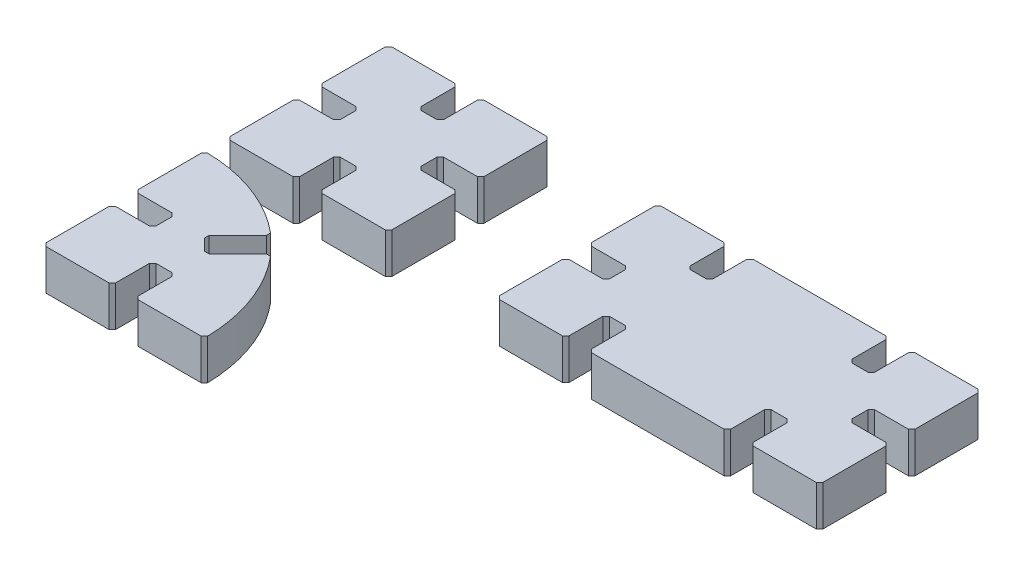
ISO-10303-21;
HEADER;
FILE_DESCRIPTION(('STEP AP214'),'2;1');
FILE_NAME('part.step','',(''),(''),'','','');
FILE_SCHEMA(('AUTOMOTIVE_DESIGN { 1 0 10303 214 1 1 1 1 }'));
ENDSEC;
DATA;
#1=APPLICATION_CONTEXT('core data for automotive mechanical design processes');
#2=APPLICATION_PROTOCOL_DEFINITION('international standard','automotive_design',2000,#1);
#3=PRODUCT_CONTEXT('',#1,'mechanical');
#4=PRODUCT('Part','Part','',(#3));
#5=PRODUCT_RELATED_PRODUCT_CATEGORY('part','',(#4));
#6=PRODUCT_DEFINITION_FORMATION('','',#4);
#7=PRODUCT_DEFINITION_CONTEXT('part definition',#1,'design');
#8=PRODUCT_DEFINITION('design','',#6,#7);
#9=PRODUCT_DEFINITION_SHAPE('','',#8);
#10=(LENGTH_UNIT() NAMED_UNIT(*) SI_UNIT(.MILLI.,.METRE.));
#11=(NAMED_UNIT(*) PLANE_ANGLE_UNIT() SI_UNIT($,.RADIAN.));
#12=(NAMED_UNIT(*) SI_UNIT($,.STERADIAN.) SOLID_ANGLE_UNIT());
#13=UNCERTAINTY_MEASURE_WITH_UNIT(LENGTH_MEASURE(1.E-05),#10,'distance_accuracy_value','');
#14=(GEOMETRIC_REPRESENTATION_CONTEXT(3) GLOBAL_UNCERTAINTY_ASSIGNED_CONTEXT((#13)) GLOBAL_UNIT_ASSIGNED_CONTEXT((#10,
#11,#12)) REPRESENTATION_CONTEXT('',''));
#15=CARTESIAN_POINT('',(0.,0.,0.));
#16=DIRECTION('',(0.,0.,1.));
#17=DIRECTION('',(1.,0.,0.));
#18=AXIS2_PLACEMENT_3D('',#15,#16,#17);
#19=CARTESIAN_POINT('',(0.,6.35,-24.8919999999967));
#20=DIRECTION('',(0.,0.,-1.));
#21=DIRECTION('',(-1.,0.,0.));
#22=AXIS2_PLACEMENT_3D('',#19,#20,#21);
#23=PLANE('',#22);
#24=DIRECTION('',(1.,0.,0.));
#25=VECTOR('',#24,1.);
#26=CARTESIAN_POINT('',(0.,0.,-24.8919999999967));
#27=LINE('',#26,#25);
#28=CARTESIAN_POINT('',(57.7985555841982,0.,-24.892));
#29=VERTEX_POINT('',#28);
#30=CARTESIAN_POINT('',(78.6265555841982,0.,-24.8919999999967));
#31=VERTEX_POINT('',#30);
#32=EDGE_CURVE('E429',#29,#31,#27,.T.);
#33=ORIENTED_EDGE('',*,*,#32,.F.);
#34=DIRECTION('',(0.,-1.,0.));
#35=VECTOR('',#34,1.);
#36=CARTESIAN_POINT('',(57.7985555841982,6.35,-24.892));
#37=LINE('',#36,#35);
#38=CARTESIAN_POINT('',(57.7985555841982,6.35,-24.892));
#39=VERTEX_POINT('',#38);
#40=EDGE_CURVE('E12',#39,#29,#37,.T.);
#41=ORIENTED_EDGE('',*,*,#40,.F.);
#42=DIRECTION('',(1.,0.,0.));
#43=VECTOR('',#42,1.);
#44=CARTESIAN_POINT('',(0.,6.35,-24.8919999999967));
#45=LINE('',#44,#43);
#46=CARTESIAN_POINT('',(78.6265555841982,6.35,-24.8919999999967));
#47=VERTEX_POINT('',#46);
#48=EDGE_CURVE('E583',#39,#47,#45,.T.);
#49=ORIENTED_EDGE('',*,*,#48,.T.);
#50=DIRECTION('',(0.,-1.,0.));
#51=VECTOR('',#50,1.);
#52=CARTESIAN_POINT('',(78.6265555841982,6.35,-24.8919999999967));
#53=LINE('',#52,#51);
#54=EDGE_CURVE('E64',#47,#31,#53,.T.);
#55=ORIENTED_EDGE('',*,*,#54,.T.);
#56=EDGE_LOOP('',(#33,#41,#49,#55));
#57=FACE_BOUND('',#56,.T.);
#58=ADVANCED_FACE('F48',(#57),#23,.T.);
#59=CARTESIAN_POINT('',(16.4532777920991,6.35,16.4532777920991));
#60=DIRECTION('',(-0.707106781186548,0.,-0.707106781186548));
#61=DIRECTION('',(-0.707106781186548,0.,0.707106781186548));
#62=AXIS2_PLACEMENT_3D('',#59,#60,#61);
#63=PLANE('',#62);
#64=DIRECTION('',(0.707106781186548,0.,-0.707106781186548));
#65=VECTOR('',#64,1.);
#66=CARTESIAN_POINT('',(16.4532777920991,0.,16.4532777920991));
#67=LINE('',#66,#65);
#68=CARTESIAN_POINT('',(57.2905555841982,0.,-24.384));
#69=VERTEX_POINT('',#68);
#70=EDGE_CURVE('E431',#69,#29,#67,.T.);
#71=ORIENTED_EDGE('',*,*,#70,.F.);
#72=DIRECTION('',(0.,-1.,0.));
#73=VECTOR('',#72,1.);
#74=CARTESIAN_POINT('',(57.2905555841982,6.35,-24.384));
#75=LINE('',#74,#73);
#76=CARTESIAN_POINT('',(57.2905555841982,6.35,-24.384));
#77=VERTEX_POINT('',#76);
#78=EDGE_CURVE('E56',#77,#69,#75,.T.);
#79=ORIENTED_EDGE('',*,*,#78,.F.);
#80=DIRECTION('',(0.707106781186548,0.,-0.707106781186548));
#81=VECTOR('',#80,1.);
#82=CARTESIAN_POINT('',(16.4532777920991,6.35,16.4532777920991));
#83=LINE('',#82,#81);
#84=EDGE_CURVE('E710',#77,#39,#83,.T.);
#85=ORIENTED_EDGE('',*,*,#84,.T.);
#86=ORIENTED_EDGE('',*,*,#40,.T.);
#87=EDGE_LOOP('',(#71,#79,#85,#86));
#88=FACE_BOUND('',#87,.T.);
#89=ADVANCED_FACE('F709',(#88),#63,.T.);
#90=CARTESIAN_POINT('',(57.2905555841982,6.35,0.));
#91=DIRECTION('',(1.,0.,0.));
#92=DIRECTION('',(0.,0.,-1.));
#93=AXIS2_PLACEMENT_3D('',#90,#91,#92);
#94=PLANE('',#93);
#95=DIRECTION('',(0.,0.,1.));
#96=VECTOR('',#95,1.);
#97=CARTESIAN_POINT('',(57.2905555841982,0.,0.));
#98=LINE('',#97,#96);
#99=CARTESIAN_POINT('',(57.2905555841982,0.,-19.05));
#100=VERTEX_POINT('',#99);
#101=EDGE_CURVE('E434',#69,#100,#98,.T.);
#102=ORIENTED_EDGE('',*,*,#101,.T.);
#103=DIRECTION('',(0.,-1.,0.));
#104=VECTOR('',#103,1.);
#105=CARTESIAN_POINT('',(57.2905555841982,6.35,-19.05));
#106=LINE('',#105,#104);
#107=CARTESIAN_POINT('',(57.2905555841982,6.35,-19.05));
#108=VERTEX_POINT('',#107);
#109=EDGE_CURVE('E695',#108,#100,#106,.T.);
#110=ORIENTED_EDGE('',*,*,#109,.F.);
#111=DIRECTION('',(0.,0.,1.));
#112=VECTOR('',#111,1.);
#113=CARTESIAN_POINT('',(57.2905555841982,6.35,0.));
#114=LINE('',#113,#112);
#115=EDGE_CURVE('E701',#77,#108,#114,.T.);
#116=ORIENTED_EDGE('',*,*,#115,.F.);
#117=ORIENTED_EDGE('',*,*,#78,.T.);
#118=EDGE_LOOP('',(#102,#110,#116,#117));
#119=FACE_BOUND('',#118,.T.);
#120=ADVANCED_FACE('F699',(#119),#94,.F.);
#121=CARTESIAN_POINT('',(19.1202777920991,6.35,19.1202777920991));
#122=DIRECTION('',(-0.707106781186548,0.,-0.707106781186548));
#123=DIRECTION('',(-0.707106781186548,0.,0.707106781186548));
#124=AXIS2_PLACEMENT_3D('',#121,#122,#123);
#125=PLANE('',#124);
#126=DIRECTION('',(0.707106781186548,0.,-0.707106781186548));
#127=VECTOR('',#126,1.);
#128=CARTESIAN_POINT('',(19.1202777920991,0.,19.1202777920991));
#129=LINE('',#128,#127);
#130=CARTESIAN_POINT('',(56.7825555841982,0.,-18.542));
#131=VERTEX_POINT('',#130);
#132=EDGE_CURVE('E437',#131,#100,#129,.T.);
#133=ORIENTED_EDGE('',*,*,#132,.F.);
#134=DIRECTION('',(0.,-1.,0.));
#135=VECTOR('',#134,1.);
#136=CARTESIAN_POINT('',(56.7825555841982,6.35,-18.542));
#137=LINE('',#136,#135);
#138=CARTESIAN_POINT('',(56.7825555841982,6.35,-18.542));
#139=VERTEX_POINT('',#138);
#140=EDGE_CURVE('E693',#139,#131,#137,.T.);
#141=ORIENTED_EDGE('',*,*,#140,.F.);
#142=DIRECTION('',(0.707106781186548,0.,-0.707106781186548));
#143=VECTOR('',#142,1.);
#144=CARTESIAN_POINT('',(19.1202777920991,6.35,19.1202777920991));
#145=LINE('',#144,#143);
#146=EDGE_CURVE('E1468',#139,#108,#145,.T.);
#147=ORIENTED_EDGE('',*,*,#146,.T.);
#148=ORIENTED_EDGE('',*,*,#109,.T.);
#149=EDGE_LOOP('',(#133,#141,#147,#148));
#150=FACE_BOUND('',#149,.T.);
#151=ADVANCED_FACE('F728',(#150),#125,.T.);
#152=CARTESIAN_POINT('',(0.,6.35,-18.5420000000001));
#153=DIRECTION('',(0.,0.,-1.));
#154=DIRECTION('',(-1.,0.,0.));
#155=AXIS2_PLACEMENT_3D('',#152,#153,#154);
#156=PLANE('',#155);
#157=DIRECTION('',(1.,0.,0.));
#158=VECTOR('',#157,1.);
#159=CARTESIAN_POINT('',(0.,0.,-18.5420000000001));
#160=LINE('',#159,#158);
#161=CARTESIAN_POINT('',(54.2425555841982,0.,-18.542));
#162=VERTEX_POINT('',#161);
#163=EDGE_CURVE('E440',#162,#131,#160,.T.);
#164=ORIENTED_EDGE('',*,*,#163,.F.);
#165=DIRECTION('',(0.,-1.,0.));
#166=VECTOR('',#165,1.);
#167=CARTESIAN_POINT('',(54.2425555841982,6.35,-18.542));
#168=LINE('',#167,#166);
#169=CARTESIAN_POINT('',(54.2425555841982,6.35,-18.542));
#170=VERTEX_POINT('',#169);
#171=EDGE_CURVE('E691',#170,#162,#168,.T.);
#172=ORIENTED_EDGE('',*,*,#171,.F.);
#173=DIRECTION('',(1.,0.,0.));
#174=VECTOR('',#173,1.);
#175=CARTESIAN_POINT('',(0.,6.35,-18.5420000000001));
#176=LINE('',#175,#174);
#177=EDGE_CURVE('E1465',#170,#139,#176,.T.);
#178=ORIENTED_EDGE('',*,*,#177,.T.);
#179=ORIENTED_EDGE('',*,*,#140,.T.);
#180=EDGE_LOOP('',(#164,#172,#178,#179));
#181=FACE_BOUND('',#180,.T.);
#182=ADVANCED_FACE('F733',(#181),#156,.T.);
#183=CARTESIAN_POINT('',(36.3922777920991,6.35,-36.3922777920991));
#184=DIRECTION('',(0.707106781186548,0.,-0.707106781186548));
#185=DIRECTION('',(-0.707106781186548,0.,-0.707106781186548));
#186=AXIS2_PLACEMENT_3D('',#183,#184,#185);
#187=PLANE('',#186);
#188=DIRECTION('',(0.707106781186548,0.,0.707106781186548));
#189=VECTOR('',#188,1.);
#190=CARTESIAN_POINT('',(36.3922777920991,0.,-36.3922777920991));
#191=LINE('',#190,#189);
#192=CARTESIAN_POINT('',(53.7345555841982,0.,-19.05));
#193=VERTEX_POINT('',#192);
#194=EDGE_CURVE('E443',#193,#162,#191,.T.);
#195=ORIENTED_EDGE('',*,*,#194,.F.);
#196=DIRECTION('',(0.,-1.,0.));
#197=VECTOR('',#196,1.);
#198=CARTESIAN_POINT('',(53.7345555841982,6.35,-19.05));
#199=LINE('',#198,#197);
#200=CARTESIAN_POINT('',(53.7345555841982,6.35,-19.05));
#201=VERTEX_POINT('',#200);
#202=EDGE_CURVE('E689',#201,#193,#199,.T.);
#203=ORIENTED_EDGE('',*,*,#202,.F.);
#204=DIRECTION('',(0.707106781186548,0.,0.707106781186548));
#205=VECTOR('',#204,1.);
#206=CARTESIAN_POINT('',(36.3922777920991,6.35,-36.3922777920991));
#207=LINE('',#206,#205);
#208=EDGE_CURVE('E1462',#201,#170,#207,.T.);
#209=ORIENTED_EDGE('',*,*,#208,.T.);
#210=ORIENTED_EDGE('',*,*,#171,.T.);
#211=EDGE_LOOP('',(#195,#203,#209,#210));
#212=FACE_BOUND('',#211,.T.);
#213=ADVANCED_FACE('F737',(#212),#187,.T.);
#214=CARTESIAN_POINT('',(53.7345555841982,6.35,0.));
#215=DIRECTION('',(1.,0.,0.));
#216=DIRECTION('',(0.,0.,-1.));
#217=AXIS2_PLACEMENT_3D('',#214,#215,#216);
#218=PLANE('',#217);
#219=DIRECTION('',(0.,0.,1.));
#220=VECTOR('',#219,1.);
#221=CARTESIAN_POINT('',(53.7345555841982,0.,0.));
#222=LINE('',#221,#220);
#223=CARTESIAN_POINT('',(53.7345555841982,0.,-24.384));
#224=VERTEX_POINT('',#223);
#225=EDGE_CURVE('E446',#224,#193,#222,.T.);
#226=ORIENTED_EDGE('',*,*,#225,.F.);
#227=DIRECTION('',(0.,-1.,0.));
#228=VECTOR('',#227,1.);
#229=CARTESIAN_POINT('',(53.7345555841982,6.35,-24.384));
#230=LINE('',#229,#228);
#231=CARTESIAN_POINT('',(53.7345555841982,6.35,-24.384));
#232=VERTEX_POINT('',#231);
#233=EDGE_CURVE('E687',#232,#224,#230,.T.);
#234=ORIENTED_EDGE('',*,*,#233,.F.);
#235=DIRECTION('',(0.,0.,1.));
#236=VECTOR('',#235,1.);
#237=CARTESIAN_POINT('',(53.7345555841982,6.35,0.));
#238=LINE('',#237,#236);
#239=EDGE_CURVE('E1475',#232,#201,#238,.T.);
#240=ORIENTED_EDGE('',*,*,#239,.T.);
#241=ORIENTED_EDGE('',*,*,#202,.T.);
#242=EDGE_LOOP('',(#226,#234,#240,#241));
#243=FACE_BOUND('',#242,.T.);
#244=ADVANCED_FACE('F741',(#243),#218,.T.);
#245=CARTESIAN_POINT('',(39.0592777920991,6.35,-39.0592777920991));
#246=DIRECTION('',(0.707106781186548,0.,-0.707106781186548));
#247=DIRECTION('',(-0.707106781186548,0.,-0.707106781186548));
#248=AXIS2_PLACEMENT_3D('',#245,#246,#247);
#249=PLANE('',#248);
#250=DIRECTION('',(0.707106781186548,0.,0.707106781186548));
#251=VECTOR('',#250,1.);
#252=CARTESIAN_POINT('',(39.0592777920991,0.,-39.0592777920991));
#253=LINE('',#252,#251);
#254=CARTESIAN_POINT('',(53.2265555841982,0.,-24.892));
#255=VERTEX_POINT('',#254);
#256=EDGE_CURVE('E449',#255,#224,#253,.T.);
#257=ORIENTED_EDGE('',*,*,#256,.F.);
#258=DIRECTION('',(0.,-1.,0.));
#259=VECTOR('',#258,1.);
#260=CARTESIAN_POINT('',(53.2265555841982,6.35,-24.892));
#261=LINE('',#260,#259);
#262=CARTESIAN_POINT('',(53.2265555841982,6.35,-24.892));
#263=VERTEX_POINT('',#262);
#264=EDGE_CURVE('E685',#263,#255,#261,.T.);
#265=ORIENTED_EDGE('',*,*,#264,.F.);
#266=DIRECTION('',(0.707106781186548,0.,0.707106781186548));
#267=VECTOR('',#266,1.);
#268=CARTESIAN_POINT('',(39.0592777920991,6.35,-39.0592777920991));
#269=LINE('',#268,#267);
#270=EDGE_CURVE('E1455',#263,#232,#269,.T.);
#271=ORIENTED_EDGE('',*,*,#270,.T.);
#272=ORIENTED_EDGE('',*,*,#233,.T.);
#273=EDGE_LOOP('',(#257,#265,#271,#272));
#274=FACE_BOUND('',#273,.T.);
#275=ADVANCED_FACE('F745',(#274),#249,.T.);
#276=CARTESIAN_POINT('',(0.,6.35,-24.892));
#277=DIRECTION('',(0.,0.,-1.));
#278=DIRECTION('',(-1.,0.,0.));
#279=AXIS2_PLACEMENT_3D('',#276,#277,#278);
#280=PLANE('',#279);
#281=DIRECTION('',(1.,0.,0.));
#282=VECTOR('',#281,1.);
#283=CARTESIAN_POINT('',(0.,0.,-24.892));
#284=LINE('',#283,#282);
#285=CARTESIAN_POINT('',(43.3205555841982,0.,-24.892));
#286=VERTEX_POINT('',#285);
#287=EDGE_CURVE('E452',#286,#255,#284,.T.);
#288=ORIENTED_EDGE('',*,*,#287,.F.);
#289=DIRECTION('',(0.,-1.,0.));
#290=VECTOR('',#289,1.);
#291=CARTESIAN_POINT('',(43.3205555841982,6.35,-24.892));
#292=LINE('',#291,#290);
#293=CARTESIAN_POINT('',(43.3205555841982,6.35,-24.892));
#294=VERTEX_POINT('',#293);
#295=EDGE_CURVE('E683',#294,#286,#292,.T.);
#296=ORIENTED_EDGE('',*,*,#295,.F.);
#297=DIRECTION('',(1.,0.,0.));
#298=VECTOR('',#297,1.);
#299=CARTESIAN_POINT('',(0.,6.35,-24.892));
#300=LINE('',#299,#298);
#301=EDGE_CURVE('E1451',#294,#263,#300,.T.);
#302=ORIENTED_EDGE('',*,*,#301,.T.);
#303=ORIENTED_EDGE('',*,*,#264,.T.);
#304=EDGE_LOOP('',(#288,#296,#302,#303));
#305=FACE_BOUND('',#304,.T.);
#306=ADVANCED_FACE('F749',(#305),#280,.T.);
#307=CARTESIAN_POINT('',(9.2142777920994,6.35,9.21427779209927));
#308=DIRECTION('',(-0.707106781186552,0.,-0.707106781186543));
#309=DIRECTION('',(-0.707106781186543,0.,0.707106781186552));
#310=AXIS2_PLACEMENT_3D('',#307,#308,#309);
#311=PLANE('',#310);
#312=DIRECTION('',(0.707106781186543,0.,-0.707106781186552));
#313=VECTOR('',#312,1.);
#314=CARTESIAN_POINT('',(9.2142777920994,0.,9.21427779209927));
#315=LINE('',#314,#313);
#316=CARTESIAN_POINT('',(42.8125555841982,0.,-24.384));
#317=VERTEX_POINT('',#316);
#318=EDGE_CURVE('E455',#317,#286,#315,.T.);
#319=ORIENTED_EDGE('',*,*,#318,.F.);
#320=DIRECTION('',(0.,-1.,0.));
#321=VECTOR('',#320,1.);
#322=CARTESIAN_POINT('',(42.8125555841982,6.35,-24.384));
#323=LINE('',#322,#321);
#324=CARTESIAN_POINT('',(42.8125555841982,6.35,-24.384));
#325=VERTEX_POINT('',#324);
#326=EDGE_CURVE('E681',#325,#317,#323,.T.);
#327=ORIENTED_EDGE('',*,*,#326,.F.);
#328=DIRECTION('',(0.707106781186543,0.,-0.707106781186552));
#329=VECTOR('',#328,1.);
#330=CARTESIAN_POINT('',(9.2142777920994,6.35,9.21427779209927));
#331=LINE('',#330,#329);
#332=EDGE_CURVE('E1479',#325,#294,#331,.T.);
#333=ORIENTED_EDGE('',*,*,#332,.T.);
#334=ORIENTED_EDGE('',*,*,#295,.T.);
#335=EDGE_LOOP('',(#319,#327,#333,#334));
#336=FACE_BOUND('',#335,.T.);
#337=ADVANCED_FACE('F753',(#336),#311,.T.);
#338=CARTESIAN_POINT('',(42.8125555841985,6.35,-5.39803357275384E-13));
#339=DIRECTION('',(-1.,0.,0.));
#340=DIRECTION('',(0.,0.,1.));
#341=AXIS2_PLACEMENT_3D('',#338,#339,#340);
#342=PLANE('',#341);
#343=DIRECTION('',(0.,0.,-1.));
#344=VECTOR('',#343,1.);
#345=CARTESIAN_POINT('',(42.8125555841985,0.,-5.39803357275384E-13));
#346=LINE('',#345,#344);
#347=CARTESIAN_POINT('',(42.8125555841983,0.,-14.4780000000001));
#348=VERTEX_POINT('',#347);
#349=EDGE_CURVE('E458',#348,#317,#346,.T.);
#350=ORIENTED_EDGE('',*,*,#349,.F.);
#351=DIRECTION('',(0.,-1.,0.));
#352=VECTOR('',#351,1.);
#353=CARTESIAN_POINT('',(42.8125555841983,6.35,-14.4780000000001));
#354=LINE('',#353,#352);
#355=CARTESIAN_POINT('',(42.8125555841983,6.35,-14.4780000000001));
#356=VERTEX_POINT('',#355);
#357=EDGE_CURVE('E679',#356,#348,#354,.T.);
#358=ORIENTED_EDGE('',*,*,#357,.F.);
#359=DIRECTION('',(0.,0.,-1.));
#360=VECTOR('',#359,1.);
#361=CARTESIAN_POINT('',(42.8125555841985,6.35,-5.39803357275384E-13));
#362=LINE('',#361,#360);
#363=EDGE_CURVE('E1444',#356,#325,#362,.T.);
#364=ORIENTED_EDGE('',*,*,#363,.T.);
#365=ORIENTED_EDGE('',*,*,#326,.T.);
#366=EDGE_LOOP('',(#350,#358,#364,#365));
#367=FACE_BOUND('',#366,.T.);
#368=ADVANCED_FACE('F757',(#367),#342,.T.);
#369=CARTESIAN_POINT('',(28.6452777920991,6.35,-28.6452777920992));
#370=DIRECTION('',(0.707106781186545,0.,-0.70710678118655));
#371=DIRECTION('',(-0.70710678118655,0.,-0.707106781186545));
#372=AXIS2_PLACEMENT_3D('',#369,#370,#371);
#373=PLANE('',#372);
#374=DIRECTION('',(0.70710678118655,0.,0.707106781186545));
#375=VECTOR('',#374,1.);
#376=CARTESIAN_POINT('',(28.6452777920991,0.,-28.6452777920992));
#377=LINE('',#376,#375);
#378=CARTESIAN_POINT('',(43.3205555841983,0.,-13.9700000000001));
#379=VERTEX_POINT('',#378);
#380=EDGE_CURVE('E461',#348,#379,#377,.T.);
#381=ORIENTED_EDGE('',*,*,#380,.T.);
#382=DIRECTION('',(0.,-1.,0.));
#383=VECTOR('',#382,1.);
#384=CARTESIAN_POINT('',(43.3205555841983,6.35,-13.9700000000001));
#385=LINE('',#384,#383);
#386=CARTESIAN_POINT('',(43.3205555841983,6.35,-13.9700000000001));
#387=VERTEX_POINT('',#386);
#388=EDGE_CURVE('E676',#387,#379,#385,.T.);
#389=ORIENTED_EDGE('',*,*,#388,.F.);
#390=DIRECTION('',(0.70710678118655,0.,0.707106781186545));
#391=VECTOR('',#390,1.);
#392=CARTESIAN_POINT('',(28.6452777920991,6.35,-28.6452777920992));
#393=LINE('',#392,#391);
#394=EDGE_CURVE('E1439',#356,#387,#393,.T.);
#395=ORIENTED_EDGE('',*,*,#394,.F.);
#396=ORIENTED_EDGE('',*,*,#357,.T.);
#397=EDGE_LOOP('',(#381,#389,#395,#396));
#398=FACE_BOUND('',#397,.T.);
#399=ADVANCED_FACE('F761',(#398),#373,.F.);
#400=CARTESIAN_POINT('',(-1.21306734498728E-12,6.35,-13.9699999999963));
#401=DIRECTION('',(0.,0.,-1.));
#402=DIRECTION('',(-1.,0.,0.));
#403=AXIS2_PLACEMENT_3D('',#400,#401,#402);
#404=PLANE('',#403);
#405=DIRECTION('',(1.,0.,0.));
#406=VECTOR('',#405,1.);
#407=CARTESIAN_POINT('',(-1.21306734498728E-12,0.,-13.9699999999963));
#408=LINE('',#407,#406);
#409=CARTESIAN_POINT('',(48.6545555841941,0.,-13.9700000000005));
#410=VERTEX_POINT('',#409);
#411=EDGE_CURVE('E463',#379,#410,#408,.T.);
#412=ORIENTED_EDGE('',*,*,#411,.T.);
#413=DIRECTION('',(0.,-1.,0.));
#414=VECTOR('',#413,1.);
#415=CARTESIAN_POINT('',(48.6545555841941,6.35,-13.9700000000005));
#416=LINE('',#415,#414);
#417=CARTESIAN_POINT('',(48.6545555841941,6.35,-13.9700000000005));
#418=VERTEX_POINT('',#417);
#419=EDGE_CURVE('E674',#418,#410,#416,.T.);
#420=ORIENTED_EDGE('',*,*,#419,.F.);
#421=DIRECTION('',(1.,0.,0.));
#422=VECTOR('',#421,1.);
#423=CARTESIAN_POINT('',(-1.21306734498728E-12,6.35,-13.9699999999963));
#424=LINE('',#423,#422);
#425=EDGE_CURVE('E1437',#387,#418,#424,.T.);
#426=ORIENTED_EDGE('',*,*,#425,.F.);
#427=ORIENTED_EDGE('',*,*,#388,.T.);
#428=EDGE_LOOP('',(#412,#420,#426,#427));
#429=FACE_BOUND('',#428,.T.);
#430=ADVANCED_FACE('F765',(#429),#404,.F.);
#431=CARTESIAN_POINT('',(31.3122777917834,6.35,-31.3122777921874));
#432=DIRECTION('',(-0.707106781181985,0.,0.70710678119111));
#433=DIRECTION('',(0.70710678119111,0.,0.707106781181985));
#434=AXIS2_PLACEMENT_3D('',#431,#432,#433);
#435=PLANE('',#434);
#436=DIRECTION('',(-0.70710678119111,0.,-0.707106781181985));
#437=VECTOR('',#436,1.);
#438=CARTESIAN_POINT('',(31.3122777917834,0.,-31.3122777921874));
#439=LINE('',#438,#437);
#440=CARTESIAN_POINT('',(49.1625555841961,0.,-13.4620000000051));
#441=VERTEX_POINT('',#440);
#442=EDGE_CURVE('E466',#441,#410,#439,.T.);
#443=ORIENTED_EDGE('',*,*,#442,.F.);
#444=DIRECTION('',(0.,-1.,0.));
#445=VECTOR('',#444,1.);
#446=CARTESIAN_POINT('',(49.1625555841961,6.35,-13.4620000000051));
#447=LINE('',#446,#445);
#448=CARTESIAN_POINT('',(49.1625555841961,6.35,-13.4620000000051));
#449=VERTEX_POINT('',#448);
#450=EDGE_CURVE('E672',#449,#441,#447,.T.);
#451=ORIENTED_EDGE('',*,*,#450,.F.);
#452=DIRECTION('',(-0.70710678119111,0.,-0.707106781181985));
#453=VECTOR('',#452,1.);
#454=CARTESIAN_POINT('',(31.3122777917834,6.35,-31.3122777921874));
#455=LINE('',#454,#453);
#456=EDGE_CURVE('E1434',#449,#418,#455,.T.);
#457=ORIENTED_EDGE('',*,*,#456,.T.);
#458=ORIENTED_EDGE('',*,*,#419,.T.);
#459=EDGE_LOOP('',(#443,#451,#457,#458));
#460=FACE_BOUND('',#459,.T.);
#461=ADVANCED_FACE('F769',(#460),#435,.T.);
#462=CARTESIAN_POINT('',(49.1625555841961,6.35,0.));
#463=DIRECTION('',(-1.,0.,0.));
#464=DIRECTION('',(0.,0.,1.));
#465=AXIS2_PLACEMENT_3D('',#462,#463,#464);
#466=PLANE('',#465);
#467=DIRECTION('',(0.,0.,-1.));
#468=VECTOR('',#467,1.);
#469=CARTESIAN_POINT('',(49.1625555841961,0.,0.));
#470=LINE('',#469,#468);
#471=CARTESIAN_POINT('',(49.1625555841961,0.,-10.9219999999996));
#472=VERTEX_POINT('',#471);
#473=EDGE_CURVE('E469',#472,#441,#470,.T.);
#474=ORIENTED_EDGE('',*,*,#473,.F.);
#475=DIRECTION('',(0.,-1.,0.));
#476=VECTOR('',#475,1.);
#477=CARTESIAN_POINT('',(49.1625555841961,6.35,-10.9219999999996));
#478=LINE('',#477,#476);
#479=CARTESIAN_POINT('',(49.1625555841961,6.35,-10.9219999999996));
#480=VERTEX_POINT('',#479);
#481=EDGE_CURVE('E670',#480,#472,#478,.T.);
#482=ORIENTED_EDGE('',*,*,#481,.F.);
#483=DIRECTION('',(0.,0.,-1.));
#484=VECTOR('',#483,1.);
#485=CARTESIAN_POINT('',(49.1625555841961,6.35,0.));
#486=LINE('',#485,#484);
#487=EDGE_CURVE('E1485',#480,#449,#486,.T.);
#488=ORIENTED_EDGE('',*,*,#487,.T.);
#489=ORIENTED_EDGE('',*,*,#450,.T.);
#490=EDGE_LOOP('',(#474,#482,#488,#489));
#491=FACE_BOUND('',#490,.T.);
#492=ADVANCED_FACE('F773',(#491),#466,.T.);
#493=CARTESIAN_POINT('',(19.1202777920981,6.35,19.1202777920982));
#494=DIRECTION('',(-0.707106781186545,0.,-0.70710678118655));
#495=DIRECTION('',(-0.70710678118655,0.,0.707106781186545));
#496=AXIS2_PLACEMENT_3D('',#493,#494,#495);
#497=PLANE('',#496);
#498=DIRECTION('',(0.70710678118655,0.,-0.707106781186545));
#499=VECTOR('',#498,1.);
#500=CARTESIAN_POINT('',(19.1202777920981,0.,19.1202777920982));
#501=LINE('',#500,#499);
#502=CARTESIAN_POINT('',(48.6545555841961,0.,-10.4139999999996));
#503=VERTEX_POINT('',#502);
#504=EDGE_CURVE('E472',#503,#472,#501,.T.);
#505=ORIENTED_EDGE('',*,*,#504,.F.);
#506=DIRECTION('',(0.,-1.,0.));
#507=VECTOR('',#506,1.);
#508=CARTESIAN_POINT('',(48.6545555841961,6.35,-10.4139999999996));
#509=LINE('',#508,#507);
#510=CARTESIAN_POINT('',(48.6545555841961,6.35,-10.4139999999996));
#511=VERTEX_POINT('',#510);
#512=EDGE_CURVE('E668',#511,#503,#509,.T.);
#513=ORIENTED_EDGE('',*,*,#512,.F.);
#514=DIRECTION('',(0.70710678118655,0.,-0.707106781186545));
#515=VECTOR('',#514,1.);
#516=CARTESIAN_POINT('',(19.1202777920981,6.35,19.1202777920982));
#517=LINE('',#516,#515);
#518=EDGE_CURVE('E1425',#511,#480,#517,.T.);
#519=ORIENTED_EDGE('',*,*,#518,.T.);
#520=ORIENTED_EDGE('',*,*,#481,.T.);
#521=EDGE_LOOP('',(#505,#513,#519,#520));
#522=FACE_BOUND('',#521,.T.);
#523=ADVANCED_FACE('F777',(#522),#497,.T.);
#524=CARTESIAN_POINT('',(9.68636546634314E-13,6.35,-10.4140000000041));
#525=DIRECTION('',(0.,0.,-1.));
#526=DIRECTION('',(-1.,0.,0.));
#527=AXIS2_PLACEMENT_3D('',#524,#525,#526);
#528=PLANE('',#527);
#529=DIRECTION('',(1.,0.,0.));
#530=VECTOR('',#529,1.);
#531=CARTESIAN_POINT('',(9.68636546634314E-13,0.,-10.4140000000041));
#532=LINE('',#531,#530);
#533=CARTESIAN_POINT('',(43.3205555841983,0.,-10.4140000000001));
#534=VERTEX_POINT('',#533);
#535=EDGE_CURVE('E475',#534,#503,#532,.T.);
#536=ORIENTED_EDGE('',*,*,#535,.F.);
#537=DIRECTION('',(0.,-1.,0.));
#538=VECTOR('',#537,1.);
#539=CARTESIAN_POINT('',(43.3205555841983,6.35,-10.4140000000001));
#540=LINE('',#539,#538);
#541=CARTESIAN_POINT('',(43.3205555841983,6.35,-10.4140000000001));
#542=VERTEX_POINT('',#541);
#543=EDGE_CURVE('E666',#542,#534,#540,.T.);
#544=ORIENTED_EDGE('',*,*,#543,.F.);
#545=DIRECTION('',(1.,0.,0.));
#546=VECTOR('',#545,1.);
#547=CARTESIAN_POINT('',(9.68636546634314E-13,6.35,-10.4140000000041));
#548=LINE('',#547,#546);
#549=EDGE_CURVE('E1421',#542,#511,#548,.T.);
#550=ORIENTED_EDGE('',*,*,#549,.T.);
#551=ORIENTED_EDGE('',*,*,#512,.T.);
#552=EDGE_LOOP('',(#536,#544,#550,#551));
#553=FACE_BOUND('',#552,.T.);
#554=ADVANCED_FACE('F781',(#553),#528,.T.);
#555=CARTESIAN_POINT('',(16.4532777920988,6.35,16.4532777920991));
#556=DIRECTION('',(-0.707106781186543,0.,-0.707106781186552));
#557=DIRECTION('',(-0.707106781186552,0.,0.707106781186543));
#558=AXIS2_PLACEMENT_3D('',#555,#556,#557);
#559=PLANE('',#558);
#560=DIRECTION('',(0.707106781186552,0.,-0.707106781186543));
#561=VECTOR('',#560,1.);
#562=CARTESIAN_POINT('',(16.4532777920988,0.,16.4532777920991));
#563=LINE('',#562,#561);
#564=CARTESIAN_POINT('',(42.8125555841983,0.,-9.90600000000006));
#565=VERTEX_POINT('',#564);
#566=EDGE_CURVE('E478',#565,#534,#563,.T.);
#567=ORIENTED_EDGE('',*,*,#566,.F.);
#568=DIRECTION('',(0.,-1.,0.));
#569=VECTOR('',#568,1.);
#570=CARTESIAN_POINT('',(42.8125555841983,6.35,-9.90600000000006));
#571=LINE('',#570,#569);
#572=CARTESIAN_POINT('',(42.8125555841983,6.35,-9.90600000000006));
#573=VERTEX_POINT('',#572);
#574=EDGE_CURVE('E664',#573,#565,#571,.T.);
#575=ORIENTED_EDGE('',*,*,#574,.F.);
#576=DIRECTION('',(0.707106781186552,0.,-0.707106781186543));
#577=VECTOR('',#576,1.);
#578=CARTESIAN_POINT('',(16.4532777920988,6.35,16.4532777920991));
#579=LINE('',#578,#577);
#580=EDGE_CURVE('E1489',#573,#542,#579,.T.);
#581=ORIENTED_EDGE('',*,*,#580,.T.);
#582=ORIENTED_EDGE('',*,*,#543,.T.);
#583=EDGE_LOOP('',(#567,#575,#581,#582));
#584=FACE_BOUND('',#583,.T.);
#585=ADVANCED_FACE('F785',(#584),#559,.T.);
#586=CARTESIAN_POINT('',(42.8125555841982,6.35,3.89857980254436E-13));
#587=DIRECTION('',(-1.,0.,0.));
#588=DIRECTION('',(0.,0.,1.));
#589=AXIS2_PLACEMENT_3D('',#586,#587,#588);
#590=PLANE('',#589);
#591=DIRECTION('',(0.,0.,-1.));
#592=VECTOR('',#591,1.);
#593=CARTESIAN_POINT('',(42.8125555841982,0.,3.89857980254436E-13));
#594=LINE('',#593,#592);
#595=CARTESIAN_POINT('',(42.8125555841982,0.,0.));
#596=VERTEX_POINT('',#595);
#597=EDGE_CURVE('E481',#596,#565,#594,.T.);
#598=ORIENTED_EDGE('',*,*,#597,.F.);
#599=DIRECTION('',(0.,-1.,0.));
#600=VECTOR('',#599,1.);
#601=CARTESIAN_POINT('',(42.8125555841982,6.35,0.));
#602=LINE('',#601,#600);
#603=CARTESIAN_POINT('',(42.8125555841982,6.35,0.));
#604=VERTEX_POINT('',#603);
#605=EDGE_CURVE('E662',#604,#596,#602,.T.);
#606=ORIENTED_EDGE('',*,*,#605,.F.);
#607=DIRECTION('',(0.,0.,-1.));
#608=VECTOR('',#607,1.);
#609=CARTESIAN_POINT('',(42.8125555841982,6.35,3.89857980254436E-13));
#610=LINE('',#609,#608);
#611=EDGE_CURVE('E1414',#604,#573,#610,.T.);
#612=ORIENTED_EDGE('',*,*,#611,.T.);
#613=ORIENTED_EDGE('',*,*,#574,.T.);
#614=EDGE_LOOP('',(#598,#606,#612,#613));
#615=FACE_BOUND('',#614,.T.);
#616=ADVANCED_FACE('F789',(#615),#590,.T.);
#617=CARTESIAN_POINT('',(21.4062777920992,6.35,-21.4062777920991));
#618=DIRECTION('',(0.707106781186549,0.,-0.707106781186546));
#619=DIRECTION('',(-0.707106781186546,0.,-0.707106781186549));
#620=AXIS2_PLACEMENT_3D('',#617,#618,#619);
#621=PLANE('',#620);
#622=DIRECTION('',(0.707106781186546,0.,0.707106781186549));
#623=VECTOR('',#622,1.);
#624=CARTESIAN_POINT('',(21.4062777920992,0.,-21.4062777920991));
#625=LINE('',#624,#623);
#626=CARTESIAN_POINT('',(43.3205555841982,0.,0.507999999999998));
#627=VERTEX_POINT('',#626);
#628=EDGE_CURVE('E484',#596,#627,#625,.T.);
#629=ORIENTED_EDGE('',*,*,#628,.T.);
#630=DIRECTION('',(0.,-1.,0.));
#631=VECTOR('',#630,1.);
#632=CARTESIAN_POINT('',(43.3205555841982,6.35,0.507999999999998));
#633=LINE('',#632,#631);
#634=CARTESIAN_POINT('',(43.3205555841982,6.35,0.507999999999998));
#635=VERTEX_POINT('',#634);
#636=EDGE_CURVE('E659',#635,#627,#633,.T.);
#637=ORIENTED_EDGE('',*,*,#636,.F.);
#638=DIRECTION('',(0.707106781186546,0.,0.707106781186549));
#639=VECTOR('',#638,1.);
#640=CARTESIAN_POINT('',(21.4062777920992,6.35,-21.4062777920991));
#641=LINE('',#640,#639);
#642=EDGE_CURVE('E1492',#604,#635,#641,.T.);
#643=ORIENTED_EDGE('',*,*,#642,.F.);
#644=ORIENTED_EDGE('',*,*,#605,.T.);
#645=EDGE_LOOP('',(#629,#637,#643,#644));
#646=FACE_BOUND('',#645,.T.);
#647=ADVANCED_FACE('F793',(#646),#621,.F.);
#648=CARTESIAN_POINT('',(0.,6.35,0.50800000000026));
#649=DIRECTION('',(0.,0.,-1.));
#650=DIRECTION('',(-1.,0.,0.));
#651=AXIS2_PLACEMENT_3D('',#648,#649,#650);
#652=PLANE('',#651);
#653=DIRECTION('',(1.,0.,0.));
#654=VECTOR('',#653,1.);
#655=CARTESIAN_POINT('',(0.,0.,0.50800000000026));
#656=LINE('',#655,#654);
#657=CARTESIAN_POINT('',(53.2265555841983,0.,0.507999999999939));
#658=VERTEX_POINT('',#657);
#659=EDGE_CURVE('E486',#627,#658,#656,.T.);
#660=ORIENTED_EDGE('',*,*,#659,.T.);
#661=DIRECTION('',(0.,-1.,0.));
#662=VECTOR('',#661,1.);
#663=CARTESIAN_POINT('',(53.2265555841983,6.35,0.507999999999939));
#664=LINE('',#663,#662);
#665=CARTESIAN_POINT('',(53.2265555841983,6.35,0.507999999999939));
#666=VERTEX_POINT('',#665);
#667=EDGE_CURVE('E656',#666,#658,#664,.T.);
#668=ORIENTED_EDGE('',*,*,#667,.F.);
#669=DIRECTION('',(1.,0.,0.));
#670=VECTOR('',#669,1.);
#671=CARTESIAN_POINT('',(0.,6.35,0.50800000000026));
#672=LINE('',#671,#670);
#673=EDGE_CURVE('E1406',#635,#666,#672,.T.);
#674=ORIENTED_EDGE('',*,*,#673,.F.);
#675=ORIENTED_EDGE('',*,*,#636,.T.);
#676=EDGE_LOOP('',(#660,#668,#674,#675));
#677=FACE_BOUND('',#676,.T.);
#678=ADVANCED_FACE('F797',(#677),#652,.F.);
#679=CARTESIAN_POINT('',(26.8672777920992,6.35,26.8672777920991));
#680=DIRECTION('',(-0.707106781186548,0.,-0.707106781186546));
#681=DIRECTION('',(-0.707106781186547,0.,0.707106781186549));
#682=AXIS2_PLACEMENT_3D('',#679,#680,#681);
#683=PLANE('',#682);
#684=DIRECTION('',(0.707106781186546,0.,-0.707106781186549));
#685=VECTOR('',#684,1.);
#686=CARTESIAN_POINT('',(26.8672777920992,0.,26.8672777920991));
#687=LINE('',#686,#685);
#688=CARTESIAN_POINT('',(53.7345555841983,0.,0.));
#689=VERTEX_POINT('',#688);
#690=EDGE_CURVE('E488',#658,#689,#687,.T.);
#691=ORIENTED_EDGE('',*,*,#690,.T.);
#692=DIRECTION('',(0.,-1.,0.));
#693=VECTOR('',#692,1.);
#694=CARTESIAN_POINT('',(53.7345555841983,6.35,0.));
#695=LINE('',#694,#693);
#696=CARTESIAN_POINT('',(53.7345555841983,6.35,0.));
#697=VERTEX_POINT('',#696);
#698=EDGE_CURVE('E653',#697,#689,#695,.T.);
#699=ORIENTED_EDGE('',*,*,#698,.F.);
#700=DIRECTION('',(0.707106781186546,0.,-0.707106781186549));
#701=VECTOR('',#700,1.);
#702=CARTESIAN_POINT('',(26.8672777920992,6.35,26.8672777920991));
#703=LINE('',#702,#701);
#704=EDGE_CURVE('E1403',#666,#697,#703,.T.);
#705=ORIENTED_EDGE('',*,*,#704,.F.);
#706=ORIENTED_EDGE('',*,*,#667,.T.);
#707=EDGE_LOOP('',(#691,#699,#705,#706));
#708=FACE_BOUND('',#707,.T.);
#709=ADVANCED_FACE('F801',(#708),#683,.F.);
#710=CARTESIAN_POINT('',(53.7345555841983,6.35,-5.10286122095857E-12));
#711=DIRECTION('',(-1.,0.,0.));
#712=DIRECTION('',(0.,0.,1.));
#713=AXIS2_PLACEMENT_3D('',#710,#711,#712);
#714=PLANE('',#713);
#715=DIRECTION('',(0.,0.,-1.));
#716=VECTOR('',#715,1.);
#717=CARTESIAN_POINT('',(53.7345555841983,0.,-5.10286122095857E-12));
#718=LINE('',#717,#716);
#719=CARTESIAN_POINT('',(53.7345555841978,0.,-5.33399999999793));
#720=VERTEX_POINT('',#719);
#721=EDGE_CURVE('E490',#689,#720,#718,.T.);
#722=ORIENTED_EDGE('',*,*,#721,.T.);
#723=DIRECTION('',(0.,-1.,0.));
#724=VECTOR('',#723,1.);
#725=CARTESIAN_POINT('',(53.7345555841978,6.35,-5.33399999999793));
#726=LINE('',#725,#724);
#727=CARTESIAN_POINT('',(53.7345555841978,6.35,-5.33399999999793));
#728=VERTEX_POINT('',#727);
#729=EDGE_CURVE('E651',#728,#720,#726,.T.);
#730=ORIENTED_EDGE('',*,*,#729,.F.);
#731=DIRECTION('',(0.,0.,-1.));
#732=VECTOR('',#731,1.);
#733=CARTESIAN_POINT('',(53.7345555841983,6.35,-5.10286122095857E-12));
#734=LINE('',#733,#732);
#735=EDGE_CURVE('E1401',#697,#728,#734,.T.);
#736=ORIENTED_EDGE('',*,*,#735,.F.);
#737=ORIENTED_EDGE('',*,*,#698,.T.);
#738=EDGE_LOOP('',(#722,#730,#736,#737));
#739=FACE_BOUND('',#738,.T.);
#740=ADVANCED_FACE('F805',(#739),#714,.F.);
#741=CARTESIAN_POINT('',(24.2002777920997,6.35,24.2002777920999));
#742=DIRECTION('',(0.707106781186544,0.,0.70710678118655));
#743=DIRECTION('',(0.707106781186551,0.,-0.707106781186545));
#744=AXIS2_PLACEMENT_3D('',#741,#742,#743);
#745=PLANE('',#744);
#746=DIRECTION('',(-0.707106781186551,0.,0.707106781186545));
#747=VECTOR('',#746,1.);
#748=CARTESIAN_POINT('',(24.2002777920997,0.,24.2002777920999));
#749=LINE('',#748,#747);
#750=CARTESIAN_POINT('',(54.2425555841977,0.,-5.84199999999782));
#751=VERTEX_POINT('',#750);
#752=EDGE_CURVE('E493',#751,#720,#749,.T.);
#753=ORIENTED_EDGE('',*,*,#752,.F.);
#754=DIRECTION('',(0.,-1.,0.));
#755=VECTOR('',#754,1.);
#756=CARTESIAN_POINT('',(54.2425555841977,6.35,-5.84199999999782));
#757=LINE('',#756,#755);
#758=CARTESIAN_POINT('',(54.2425555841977,6.35,-5.84199999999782));
#759=VERTEX_POINT('',#758);
#760=EDGE_CURVE('E649',#759,#751,#757,.T.);
#761=ORIENTED_EDGE('',*,*,#760,.F.);
#762=DIRECTION('',(-0.707106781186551,0.,0.707106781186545));
#763=VECTOR('',#762,1.);
#764=CARTESIAN_POINT('',(24.2002777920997,6.35,24.2002777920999));
#765=LINE('',#764,#763);
#766=EDGE_CURVE('E1497',#759,#728,#765,.T.);
#767=ORIENTED_EDGE('',*,*,#766,.T.);
#768=ORIENTED_EDGE('',*,*,#729,.T.);
#769=EDGE_LOOP('',(#753,#761,#767,#768));
#770=FACE_BOUND('',#769,.T.);
#771=ADVANCED_FACE('F809',(#770),#745,.T.);
#772=CARTESIAN_POINT('',(0.,6.35,-5.84199999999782));
#773=DIRECTION('',(0.,0.,1.));
#774=DIRECTION('',(1.,0.,0.));
#775=AXIS2_PLACEMENT_3D('',#772,#773,#774);
#776=PLANE('',#775);
#777=DIRECTION('',(-1.,0.,0.));
#778=VECTOR('',#777,1.);
#779=CARTESIAN_POINT('',(0.,0.,-5.84199999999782));
#780=LINE('',#779,#778);
#781=CARTESIAN_POINT('',(56.7825555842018,0.,-5.84199999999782));
#782=VERTEX_POINT('',#781);
#783=EDGE_CURVE('E496',#782,#751,#780,.T.);
#784=ORIENTED_EDGE('',*,*,#783,.F.);
#785=DIRECTION('',(0.,-1.,0.));
#786=VECTOR('',#785,1.);
#787=CARTESIAN_POINT('',(56.7825555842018,6.35,-5.84199999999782));
#788=LINE('',#787,#786);
#789=CARTESIAN_POINT('',(56.7825555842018,6.35,-5.84199999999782));
#790=VERTEX_POINT('',#789);
#791=EDGE_CURVE('E647',#790,#782,#788,.T.);
#792=ORIENTED_EDGE('',*,*,#791,.F.);
#793=DIRECTION('',(-1.,0.,0.));
#794=VECTOR('',#793,1.);
#795=CARTESIAN_POINT('',(0.,6.35,-5.84199999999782));
#796=LINE('',#795,#794);
#797=EDGE_CURVE('E1392',#790,#759,#796,.T.);
#798=ORIENTED_EDGE('',*,*,#797,.T.);
#799=ORIENTED_EDGE('',*,*,#760,.T.);
#800=EDGE_LOOP('',(#784,#792,#798,#799));
#801=FACE_BOUND('',#800,.T.);
#802=ADVANCED_FACE('F813',(#801),#776,.T.);
#803=CARTESIAN_POINT('',(31.3122777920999,6.35,-31.3122777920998));
#804=DIRECTION('',(-0.707106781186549,0.,0.707106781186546));
#805=DIRECTION('',(0.707106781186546,0.,0.707106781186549));
#806=AXIS2_PLACEMENT_3D('',#803,#804,#805);
#807=PLANE('',#806);
#808=DIRECTION('',(-0.707106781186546,0.,-0.707106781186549));
#809=VECTOR('',#808,1.);
#810=CARTESIAN_POINT('',(31.3122777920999,0.,-31.3122777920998));
#811=LINE('',#810,#809);
#812=CARTESIAN_POINT('',(57.2905555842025,0.,-5.33399999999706));
#813=VERTEX_POINT('',#812);
#814=EDGE_CURVE('E499',#813,#782,#811,.T.);
#815=ORIENTED_EDGE('',*,*,#814,.F.);
#816=DIRECTION('',(0.,-1.,0.));
#817=VECTOR('',#816,1.);
#818=CARTESIAN_POINT('',(57.2905555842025,6.35,-5.33399999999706));
#819=LINE('',#818,#817);
#820=CARTESIAN_POINT('',(57.2905555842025,6.35,-5.33399999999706));
#821=VERTEX_POINT('',#820);
#822=EDGE_CURVE('E645',#821,#813,#819,.T.);
#823=ORIENTED_EDGE('',*,*,#822,.F.);
#824=DIRECTION('',(-0.707106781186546,0.,-0.707106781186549));
#825=VECTOR('',#824,1.);
#826=CARTESIAN_POINT('',(31.3122777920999,6.35,-31.3122777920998));
#827=LINE('',#826,#825);
#828=EDGE_CURVE('E1388',#821,#790,#827,.T.);
#829=ORIENTED_EDGE('',*,*,#828,.T.);
#830=ORIENTED_EDGE('',*,*,#791,.T.);
#831=EDGE_LOOP('',(#815,#823,#829,#830));
#832=FACE_BOUND('',#831,.T.);
#833=ADVANCED_FACE('F817',(#832),#807,.T.);
#834=CARTESIAN_POINT('',(57.2905555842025,6.35,0.));
#835=DIRECTION('',(-1.,0.,0.));
#836=DIRECTION('',(0.,0.,1.));
#837=AXIS2_PLACEMENT_3D('',#834,#835,#836);
#838=PLANE('',#837);
#839=DIRECTION('',(0.,0.,-1.));
#840=VECTOR('',#839,1.);
#841=CARTESIAN_POINT('',(57.2905555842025,0.,0.));
#842=LINE('',#841,#840);
#843=CARTESIAN_POINT('',(57.2905555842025,0.,2.89637512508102E-12));
#844=VERTEX_POINT('',#843);
#845=EDGE_CURVE('E502',#844,#813,#842,.T.);
#846=ORIENTED_EDGE('',*,*,#845,.F.);
#847=DIRECTION('',(0.,-1.,0.));
#848=VECTOR('',#847,1.);
#849=CARTESIAN_POINT('',(57.2905555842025,6.35,2.89637512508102E-12));
#850=LINE('',#849,#848);
#851=CARTESIAN_POINT('',(57.2905555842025,6.35,2.89637512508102E-12));
#852=VERTEX_POINT('',#851);
#853=EDGE_CURVE('E643',#852,#844,#850,.T.);
#854=ORIENTED_EDGE('',*,*,#853,.F.);
#855=DIRECTION('',(0.,0.,-1.));
#856=VECTOR('',#855,1.);
#857=CARTESIAN_POINT('',(57.2905555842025,6.35,0.));
#858=LINE('',#857,#856);
#859=EDGE_CURVE('E1501',#852,#821,#858,.T.);
#860=ORIENTED_EDGE('',*,*,#859,.T.);
#861=ORIENTED_EDGE('',*,*,#822,.T.);
#862=EDGE_LOOP('',(#846,#854,#860,#861));
#863=FACE_BOUND('',#862,.T.);
#864=ADVANCED_FACE('F821',(#863),#838,.T.);
#865=CARTESIAN_POINT('',(28.6452777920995,6.35,-28.6452777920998));
#866=DIRECTION('',(-0.707106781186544,0.,0.707106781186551));
#867=DIRECTION('',(0.707106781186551,0.,0.707106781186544));
#868=AXIS2_PLACEMENT_3D('',#865,#866,#867);
#869=PLANE('',#868);
#870=DIRECTION('',(-0.707106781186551,0.,-0.707106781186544));
#871=VECTOR('',#870,1.);
#872=CARTESIAN_POINT('',(28.6452777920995,0.,-28.6452777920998));
#873=LINE('',#872,#871);
#874=CARTESIAN_POINT('',(57.7985555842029,0.,0.508000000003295));
#875=VERTEX_POINT('',#874);
#876=EDGE_CURVE('E505',#875,#844,#873,.T.);
#877=ORIENTED_EDGE('',*,*,#876,.F.);
#878=DIRECTION('',(0.,-1.,0.));
#879=VECTOR('',#878,1.);
#880=CARTESIAN_POINT('',(57.7985555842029,6.35,0.508000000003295));
#881=LINE('',#880,#879);
#882=CARTESIAN_POINT('',(57.7985555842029,6.35,0.508000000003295));
#883=VERTEX_POINT('',#882);
#884=EDGE_CURVE('E641',#883,#875,#881,.T.);
#885=ORIENTED_EDGE('',*,*,#884,.F.);
#886=DIRECTION('',(-0.707106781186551,0.,-0.707106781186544));
#887=VECTOR('',#886,1.);
#888=CARTESIAN_POINT('',(28.6452777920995,6.35,-28.6452777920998));
#889=LINE('',#888,#887);
#890=EDGE_CURVE('E1381',#883,#852,#889,.T.);
#891=ORIENTED_EDGE('',*,*,#890,.T.);
#892=ORIENTED_EDGE('',*,*,#853,.T.);
#893=EDGE_LOOP('',(#877,#885,#891,#892));
#894=FACE_BOUND('',#893,.T.);
#895=ADVANCED_FACE('F825',(#894),#869,.T.);
#896=CARTESIAN_POINT('',(0.,6.35,0.508000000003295));
#897=DIRECTION('',(0.,0.,-1.));
#898=DIRECTION('',(-1.,0.,0.));
#899=AXIS2_PLACEMENT_3D('',#896,#897,#898);
#900=PLANE('',#899);
#901=DIRECTION('',(1.,0.,0.));
#902=VECTOR('',#901,1.);
#903=CARTESIAN_POINT('',(0.,0.,0.508000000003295));
#904=LINE('',#903,#902);
#905=CARTESIAN_POINT('',(78.6265555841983,0.,0.508000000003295));
#906=VERTEX_POINT('',#905);
#907=EDGE_CURVE('E508',#875,#906,#904,.T.);
#908=ORIENTED_EDGE('',*,*,#907,.T.);
#909=DIRECTION('',(0.,-1.,0.));
#910=VECTOR('',#909,1.);
#911=CARTESIAN_POINT('',(78.6265555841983,6.35,0.508000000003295));
#912=LINE('',#911,#910);
#913=CARTESIAN_POINT('',(78.6265555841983,6.35,0.508000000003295));
#914=VERTEX_POINT('',#913);
#915=EDGE_CURVE('E638',#914,#906,#912,.T.);
#916=ORIENTED_EDGE('',*,*,#915,.F.);
#917=DIRECTION('',(1.,0.,0.));
#918=VECTOR('',#917,1.);
#919=CARTESIAN_POINT('',(0.,6.35,0.508000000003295));
#920=LINE('',#919,#918);
#921=EDGE_CURVE('E1504',#883,#914,#920,.T.);
#922=ORIENTED_EDGE('',*,*,#921,.F.);
#923=ORIENTED_EDGE('',*,*,#884,.T.);
#924=EDGE_LOOP('',(#908,#916,#922,#923));
#925=FACE_BOUND('',#924,.T.);
#926=ADVANCED_FACE('F829',(#925),#900,.F.);
#927=CARTESIAN_POINT('',(39.5672777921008,6.35,39.5672777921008));
#928=DIRECTION('',(-0.707106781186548,0.,-0.707106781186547));
#929=DIRECTION('',(-0.707106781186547,0.,0.707106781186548));
#930=AXIS2_PLACEMENT_3D('',#927,#928,#929);
#931=PLANE('',#930);
#932=DIRECTION('',(0.707106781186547,0.,-0.707106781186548));
#933=VECTOR('',#932,1.);
#934=CARTESIAN_POINT('',(39.5672777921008,0.,39.5672777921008));
#935=LINE('',#934,#933);
#936=CARTESIAN_POINT('',(79.1345555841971,0.,4.50755870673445E-12));
#937=VERTEX_POINT('',#936);
#938=EDGE_CURVE('E510',#906,#937,#935,.T.);
#939=ORIENTED_EDGE('',*,*,#938,.T.);
#940=DIRECTION('',(0.,-1.,0.));
#941=VECTOR('',#940,1.);
#942=CARTESIAN_POINT('',(79.1345555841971,6.35,4.50755870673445E-12));
#943=LINE('',#942,#941);
#944=CARTESIAN_POINT('',(79.1345555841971,6.35,4.50755870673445E-12));
#945=VERTEX_POINT('',#944);
#946=EDGE_CURVE('E635',#945,#937,#943,.T.);
#947=ORIENTED_EDGE('',*,*,#946,.F.);
#948=DIRECTION('',(0.707106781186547,0.,-0.707106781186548));
#949=VECTOR('',#948,1.);
#950=CARTESIAN_POINT('',(39.5672777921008,6.35,39.5672777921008));
#951=LINE('',#950,#949);
#952=EDGE_CURVE('E1373',#914,#945,#951,.T.);
#953=ORIENTED_EDGE('',*,*,#952,.F.);
#954=ORIENTED_EDGE('',*,*,#915,.T.);
#955=EDGE_LOOP('',(#939,#947,#953,#954));
#956=FACE_BOUND('',#955,.T.);
#957=ADVANCED_FACE('F833',(#956),#931,.F.);
#958=CARTESIAN_POINT('',(79.1345555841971,6.35,0.));
#959=DIRECTION('',(-1.,0.,0.));
#960=DIRECTION('',(0.,0.,1.));
#961=AXIS2_PLACEMENT_3D('',#958,#959,#960);
#962=PLANE('',#961);
#963=DIRECTION('',(0.,0.,-1.));
#964=VECTOR('',#963,1.);
#965=CARTESIAN_POINT('',(79.1345555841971,0.,0.));
#966=LINE('',#965,#964);
#967=CARTESIAN_POINT('',(79.1345555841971,0.,-5.33399999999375));
#968=VERTEX_POINT('',#967);
#969=EDGE_CURVE('E512',#937,#968,#966,.T.);
#970=ORIENTED_EDGE('',*,*,#969,.T.);
#971=DIRECTION('',(0.,-1.,0.));
#972=VECTOR('',#971,1.);
#973=CARTESIAN_POINT('',(79.1345555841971,6.35,-5.33399999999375));
#974=LINE('',#973,#972);
#975=CARTESIAN_POINT('',(79.1345555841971,6.35,-5.33399999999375));
#976=VERTEX_POINT('',#975);
#977=EDGE_CURVE('E633',#976,#968,#974,.T.);
#978=ORIENTED_EDGE('',*,*,#977,.F.);
#979=DIRECTION('',(0.,0.,-1.));
#980=VECTOR('',#979,1.);
#981=CARTESIAN_POINT('',(79.1345555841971,6.35,0.));
#982=LINE('',#981,#980);
#983=EDGE_CURVE('E1371',#945,#976,#982,.T.);
#984=ORIENTED_EDGE('',*,*,#983,.F.);
#985=ORIENTED_EDGE('',*,*,#946,.T.);
#986=EDGE_LOOP('',(#970,#978,#984,#985));
#987=FACE_BOUND('',#986,.T.);
#988=ADVANCED_FACE('F837',(#987),#962,.F.);
#989=CARTESIAN_POINT('',(36.9002777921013,6.35,36.9002777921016));
#990=DIRECTION('',(0.707106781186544,0.,0.707106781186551));
#991=DIRECTION('',(0.707106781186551,0.,-0.707106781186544));
#992=AXIS2_PLACEMENT_3D('',#989,#990,#991);
#993=PLANE('',#992);
#994=DIRECTION('',(-0.707106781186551,0.,0.707106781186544));
#995=VECTOR('',#994,1.);
#996=CARTESIAN_POINT('',(36.9002777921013,0.,36.9002777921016));
#997=LINE('',#996,#995);
#998=CARTESIAN_POINT('',(79.6425555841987,0.,-5.84199999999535));
#999=VERTEX_POINT('',#998);
#1000=EDGE_CURVE('E515',#999,#968,#997,.T.);
#1001=ORIENTED_EDGE('',*,*,#1000,.F.);
#1002=DIRECTION('',(0.,-1.,0.));
#1003=VECTOR('',#1002,1.);
#1004=CARTESIAN_POINT('',(79.6425555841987,6.35,-5.84199999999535));
#1005=LINE('',#1004,#1003);
#1006=CARTESIAN_POINT('',(79.6425555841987,6.35,-5.84199999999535));
#1007=VERTEX_POINT('',#1006);
#1008=EDGE_CURVE('E631',#1007,#999,#1005,.T.);
#1009=ORIENTED_EDGE('',*,*,#1008,.F.);
#1010=DIRECTION('',(-0.707106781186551,0.,0.707106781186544));
#1011=VECTOR('',#1010,1.);
#1012=CARTESIAN_POINT('',(36.9002777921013,6.35,36.9002777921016));
#1013=LINE('',#1012,#1011);
#1014=EDGE_CURVE('E1368',#1007,#976,#1013,.T.);
#1015=ORIENTED_EDGE('',*,*,#1014,.T.);
#1016=ORIENTED_EDGE('',*,*,#977,.T.);
#1017=EDGE_LOOP('',(#1001,#1009,#1015,#1016));
#1018=FACE_BOUND('',#1017,.T.);
#1019=ADVANCED_FACE('F841',(#1018),#993,.T.);
#1020=CARTESIAN_POINT('',(0.,6.35,-5.84199999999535));
#1021=DIRECTION('',(0.,0.,1.));
#1022=DIRECTION('',(1.,0.,0.));
#1023=AXIS2_PLACEMENT_3D('',#1020,#1021,#1022);
#1024=PLANE('',#1023);
#1025=DIRECTION('',(-1.,0.,0.));
#1026=VECTOR('',#1025,1.);
#1027=CARTESIAN_POINT('',(0.,0.,-5.84199999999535));
#1028=LINE('',#1027,#1026);
#1029=CARTESIAN_POINT('',(82.182555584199,0.,-5.84199999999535));
#1030=VERTEX_POINT('',#1029);
#1031=EDGE_CURVE('E518',#1030,#999,#1028,.T.);
#1032=ORIENTED_EDGE('',*,*,#1031,.F.);
#1033=DIRECTION('',(0.,-1.,0.));
#1034=VECTOR('',#1033,1.);
#1035=CARTESIAN_POINT('',(82.182555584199,6.35,-5.84199999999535));
#1036=LINE('',#1035,#1034);
#1037=CARTESIAN_POINT('',(82.182555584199,6.35,-5.84199999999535));
#1038=VERTEX_POINT('',#1037);
#1039=EDGE_CURVE('E629',#1038,#1030,#1036,.T.);
#1040=ORIENTED_EDGE('',*,*,#1039,.F.);
#1041=DIRECTION('',(-1.,0.,0.));
#1042=VECTOR('',#1041,1.);
#1043=CARTESIAN_POINT('',(0.,6.35,-5.84199999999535));
#1044=LINE('',#1043,#1042);
#1045=EDGE_CURVE('E1509',#1038,#1007,#1044,.T.);
#1046=ORIENTED_EDGE('',*,*,#1045,.T.);
#1047=ORIENTED_EDGE('',*,*,#1008,.T.);
#1048=EDGE_LOOP('',(#1032,#1040,#1046,#1047));
#1049=FACE_BOUND('',#1048,.T.);
#1050=ADVANCED_FACE('F845',(#1049),#1024,.T.);
#1051=CARTESIAN_POINT('',(44.012277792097,6.35,-44.0122777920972));
#1052=DIRECTION('',(-0.707106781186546,0.,0.707106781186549));
#1053=DIRECTION('',(0.707106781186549,0.,0.707106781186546));
#1054=AXIS2_PLACEMENT_3D('',#1051,#1052,#1053);
#1055=PLANE('',#1054);
#1056=DIRECTION('',(-0.707106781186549,0.,-0.707106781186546));
#1057=VECTOR('',#1056,1.);
#1058=CARTESIAN_POINT('',(44.012277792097,0.,-44.0122777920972));
#1059=LINE('',#1058,#1057);
#1060=CARTESIAN_POINT('',(82.6905555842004,0.,-5.33399999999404));
#1061=VERTEX_POINT('',#1060);
#1062=EDGE_CURVE('E521',#1061,#1030,#1059,.T.);
#1063=ORIENTED_EDGE('',*,*,#1062,.F.);
#1064=DIRECTION('',(0.,-1.,0.));
#1065=VECTOR('',#1064,1.);
#1066=CARTESIAN_POINT('',(82.6905555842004,6.35,-5.33399999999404));
#1067=LINE('',#1066,#1065);
#1068=CARTESIAN_POINT('',(82.6905555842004,6.35,-5.33399999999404));
#1069=VERTEX_POINT('',#1068);
#1070=EDGE_CURVE('E627',#1069,#1061,#1067,.T.);
#1071=ORIENTED_EDGE('',*,*,#1070,.F.);
#1072=DIRECTION('',(-0.707106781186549,0.,-0.707106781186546));
#1073=VECTOR('',#1072,1.);
#1074=CARTESIAN_POINT('',(44.012277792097,6.35,-44.0122777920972));
#1075=LINE('',#1074,#1073);
#1076=EDGE_CURVE('E1359',#1069,#1038,#1075,.T.);
#1077=ORIENTED_EDGE('',*,*,#1076,.T.);
#1078=ORIENTED_EDGE('',*,*,#1039,.T.);
#1079=EDGE_LOOP('',(#1063,#1071,#1077,#1078));
#1080=FACE_BOUND('',#1079,.T.);
#1081=ADVANCED_FACE('F849',(#1080),#1055,.T.);
#1082=CARTESIAN_POINT('',(82.6905555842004,6.35,0.));
#1083=DIRECTION('',(-1.,0.,0.));
#1084=DIRECTION('',(0.,0.,1.));
#1085=AXIS2_PLACEMENT_3D('',#1082,#1083,#1084);
#1086=PLANE('',#1085);
#1087=DIRECTION('',(0.,0.,-1.));
#1088=VECTOR('',#1087,1.);
#1089=CARTESIAN_POINT('',(82.6905555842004,0.,0.));
#1090=LINE('',#1089,#1088);
#1091=CARTESIAN_POINT('',(82.6905555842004,0.,5.20300934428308E-12));
#1092=VERTEX_POINT('',#1091);
#1093=EDGE_CURVE('E524',#1092,#1061,#1090,.T.);
#1094=ORIENTED_EDGE('',*,*,#1093,.F.);
#1095=DIRECTION('',(0.,-1.,0.));
#1096=VECTOR('',#1095,1.);
#1097=CARTESIAN_POINT('',(82.6905555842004,6.35,5.20300934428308E-12));
#1098=LINE('',#1097,#1096);
#1099=CARTESIAN_POINT('',(82.6905555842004,6.35,5.20300934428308E-12));
#1100=VERTEX_POINT('',#1099);
#1101=EDGE_CURVE('E625',#1100,#1092,#1098,.T.);
#1102=ORIENTED_EDGE('',*,*,#1101,.F.);
#1103=DIRECTION('',(0.,0.,-1.));
#1104=VECTOR('',#1103,1.);
#1105=CARTESIAN_POINT('',(82.6905555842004,6.35,0.));
#1106=LINE('',#1105,#1104);
#1107=EDGE_CURVE('E1355',#1100,#1069,#1106,.T.);
#1108=ORIENTED_EDGE('',*,*,#1107,.T.);
#1109=ORIENTED_EDGE('',*,*,#1070,.T.);
#1110=EDGE_LOOP('',(#1094,#1102,#1108,#1109));
#1111=FACE_BOUND('',#1110,.T.);
#1112=ADVANCED_FACE('F853',(#1111),#1086,.T.);
#1113=CARTESIAN_POINT('',(41.3452777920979,6.35,-41.3452777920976));
#1114=DIRECTION('',(-0.707106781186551,0.,0.707106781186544));
#1115=DIRECTION('',(0.707106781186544,0.,0.707106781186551));
#1116=AXIS2_PLACEMENT_3D('',#1113,#1114,#1115);
#1117=PLANE('',#1116);
#1118=DIRECTION('',(-0.707106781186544,0.,-0.707106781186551));
#1119=VECTOR('',#1118,1.);
#1120=CARTESIAN_POINT('',(41.3452777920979,0.,-41.3452777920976));
#1121=LINE('',#1120,#1119);
#1122=CARTESIAN_POINT('',(83.1985555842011,0.,0.50800000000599));
#1123=VERTEX_POINT('',#1122);
#1124=EDGE_CURVE('E527',#1123,#1092,#1121,.T.);
#1125=ORIENTED_EDGE('',*,*,#1124,.F.);
#1126=DIRECTION('',(0.,-1.,0.));
#1127=VECTOR('',#1126,1.);
#1128=CARTESIAN_POINT('',(83.1985555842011,6.35,0.50800000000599));
#1129=LINE('',#1128,#1127);
#1130=CARTESIAN_POINT('',(83.1985555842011,6.35,0.50800000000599));
#1131=VERTEX_POINT('',#1130);
#1132=EDGE_CURVE('E623',#1131,#1123,#1129,.T.);
#1133=ORIENTED_EDGE('',*,*,#1132,.F.);
#1134=DIRECTION('',(-0.707106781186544,0.,-0.707106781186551));
#1135=VECTOR('',#1134,1.);
#1136=CARTESIAN_POINT('',(41.3452777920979,6.35,-41.3452777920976));
#1137=LINE('',#1136,#1135);
#1138=EDGE_CURVE('E1350',#1131,#1100,#1137,.T.);
#1139=ORIENTED_EDGE('',*,*,#1138,.T.);
#1140=ORIENTED_EDGE('',*,*,#1101,.T.);
#1141=EDGE_LOOP('',(#1125,#1133,#1139,#1140));
#1142=FACE_BOUND('',#1141,.T.);
#1143=ADVANCED_FACE('F857',(#1142),#1117,.T.);
#1144=CARTESIAN_POINT('',(0.,6.35,0.508000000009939));
#1145=DIRECTION('',(0.,0.,-1.));
#1146=DIRECTION('',(-1.,0.,0.));
#1147=AXIS2_PLACEMENT_3D('',#1144,#1145,#1146);
#1148=PLANE('',#1147);
#1149=DIRECTION('',(1.,0.,0.));
#1150=VECTOR('',#1149,1.);
#1151=CARTESIAN_POINT('',(0.,0.,0.508000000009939));
#1152=LINE('',#1151,#1150);
#1153=CARTESIAN_POINT('',(93.1045555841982,0.,0.508000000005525));
#1154=VERTEX_POINT('',#1153);
#1155=EDGE_CURVE('E530',#1123,#1154,#1152,.T.);
#1156=ORIENTED_EDGE('',*,*,#1155,.T.);
#1157=DIRECTION('',(0.,-1.,0.));
#1158=VECTOR('',#1157,1.);
#1159=CARTESIAN_POINT('',(93.1045555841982,6.35,0.508000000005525));
#1160=LINE('',#1159,#1158);
#1161=CARTESIAN_POINT('',(93.1045555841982,6.35,0.508000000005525));
#1162=VERTEX_POINT('',#1161);
#1163=EDGE_CURVE('E620',#1162,#1154,#1160,.T.);
#1164=ORIENTED_EDGE('',*,*,#1163,.F.);
#1165=DIRECTION('',(1.,0.,0.));
#1166=VECTOR('',#1165,1.);
#1167=CARTESIAN_POINT('',(0.,6.35,0.508000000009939));
#1168=LINE('',#1167,#1166);
#1169=EDGE_CURVE('E1347',#1131,#1162,#1168,.T.);
#1170=ORIENTED_EDGE('',*,*,#1169,.F.);
#1171=ORIENTED_EDGE('',*,*,#1132,.T.);
#1172=EDGE_LOOP('',(#1156,#1164,#1170,#1171));
#1173=FACE_BOUND('',#1172,.T.);
#1174=ADVANCED_FACE('F861',(#1173),#1148,.F.);
#1175=CARTESIAN_POINT('',(46.8062777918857,6.35,46.806277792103));
#1176=DIRECTION('',(-0.707106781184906,0.,-0.707106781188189));
#1177=DIRECTION('',(-0.707106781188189,0.,0.707106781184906));
#1178=AXIS2_PLACEMENT_3D('',#1175,#1176,#1177);
#1179=PLANE('',#1178);
#1180=DIRECTION('',(0.707106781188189,0.,-0.707106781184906));
#1181=VECTOR('',#1180,1.);
#1182=CARTESIAN_POINT('',(46.8062777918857,0.,46.806277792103));
#1183=LINE('',#1182,#1181);
#1184=CARTESIAN_POINT('',(93.6125555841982,0.,7.8756445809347E-12));
#1185=VERTEX_POINT('',#1184);
#1186=EDGE_CURVE('E532',#1154,#1185,#1183,.T.);
#1187=ORIENTED_EDGE('',*,*,#1186,.T.);
#1188=DIRECTION('',(0.,-1.,0.));
#1189=VECTOR('',#1188,1.);
#1190=CARTESIAN_POINT('',(93.6125555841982,6.35,7.8756445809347E-12));
#1191=LINE('',#1190,#1189);
#1192=CARTESIAN_POINT('',(93.6125555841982,6.35,7.8756445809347E-12));
#1193=VERTEX_POINT('',#1192);
#1194=EDGE_CURVE('E617',#1193,#1185,#1191,.T.);
#1195=ORIENTED_EDGE('',*,*,#1194,.F.);
#1196=DIRECTION('',(0.707106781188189,0.,-0.707106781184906));
#1197=VECTOR('',#1196,1.);
#1198=CARTESIAN_POINT('',(46.8062777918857,6.35,46.806277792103));
#1199=LINE('',#1198,#1197);
#1200=EDGE_CURVE('E1345',#1162,#1193,#1199,.T.);
#1201=ORIENTED_EDGE('',*,*,#1200,.F.);
#1202=ORIENTED_EDGE('',*,*,#1163,.T.);
#1203=EDGE_LOOP('',(#1187,#1195,#1201,#1202));
#1204=FACE_BOUND('',#1203,.T.);
#1205=ADVANCED_FACE('F865',(#1204),#1179,.F.);
#1206=CARTESIAN_POINT('',(93.6125555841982,6.35,0.));
#1207=DIRECTION('',(-1.,0.,0.));
#1208=DIRECTION('',(0.,0.,1.));
#1209=AXIS2_PLACEMENT_3D('',#1206,#1207,#1208);
#1210=PLANE('',#1209);
#1211=DIRECTION('',(0.,0.,-1.));
#1212=VECTOR('',#1211,1.);
#1213=CARTESIAN_POINT('',(93.6125555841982,0.,0.));
#1214=LINE('',#1213,#1212);
#1215=CARTESIAN_POINT('',(93.6125555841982,0.,-9.9059999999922));
#1216=VERTEX_POINT('',#1215);
#1217=EDGE_CURVE('E534',#1185,#1216,#1214,.T.);
#1218=ORIENTED_EDGE('',*,*,#1217,.T.);
#1219=DIRECTION('',(0.,-1.,0.));
#1220=VECTOR('',#1219,1.);
#1221=CARTESIAN_POINT('',(93.6125555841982,6.35,-9.9059999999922));
#1222=LINE('',#1221,#1220);
#1223=CARTESIAN_POINT('',(93.6125555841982,6.35,-9.9059999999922));
#1224=VERTEX_POINT('',#1223);
#1225=EDGE_CURVE('E614',#1224,#1216,#1222,.T.);
#1226=ORIENTED_EDGE('',*,*,#1225,.F.);
#1227=DIRECTION('',(0.,0.,-1.));
#1228=VECTOR('',#1227,1.);
#1229=CARTESIAN_POINT('',(93.6125555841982,6.35,0.));
#1230=LINE('',#1229,#1228);
#1231=EDGE_CURVE('E1338',#1193,#1224,#1230,.T.);
#1232=ORIENTED_EDGE('',*,*,#1231,.F.);
#1233=ORIENTED_EDGE('',*,*,#1194,.T.);
#1234=EDGE_LOOP('',(#1218,#1226,#1232,#1233));
#1235=FACE_BOUND('',#1234,.T.);
#1236=ADVANCED_FACE('F869',(#1235),#1210,.F.);
#1237=CARTESIAN_POINT('',(51.7592777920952,6.35,-51.7592777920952));
#1238=DIRECTION('',(-0.707106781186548,0.,0.707106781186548));
#1239=DIRECTION('',(0.707106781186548,0.,0.707106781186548));
#1240=AXIS2_PLACEMENT_3D('',#1237,#1238,#1239);
#1241=PLANE('',#1240);
#1242=DIRECTION('',(-0.707106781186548,0.,-0.707106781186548));
#1243=VECTOR('',#1242,1.);
#1244=CARTESIAN_POINT('',(51.7592777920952,0.,-51.7592777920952));
#1245=LINE('',#1244,#1243);
#1246=CARTESIAN_POINT('',(93.1045555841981,0.,-10.4139999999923));
#1247=VERTEX_POINT('',#1246);
#1248=EDGE_CURVE('E536',#1216,#1247,#1245,.T.);
#1249=ORIENTED_EDGE('',*,*,#1248,.T.);
#1250=DIRECTION('',(0.,-1.,0.));
#1251=VECTOR('',#1250,1.);
#1252=CARTESIAN_POINT('',(93.1045555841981,6.35,-10.4139999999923));
#1253=LINE('',#1252,#1251);
#1254=CARTESIAN_POINT('',(93.1045555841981,6.35,-10.4139999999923));
#1255=VERTEX_POINT('',#1254);
#1256=EDGE_CURVE('E611',#1255,#1247,#1253,.T.);
#1257=ORIENTED_EDGE('',*,*,#1256,.F.);
#1258=DIRECTION('',(-0.707106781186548,0.,-0.707106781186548));
#1259=VECTOR('',#1258,1.);
#1260=CARTESIAN_POINT('',(51.7592777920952,6.35,-51.7592777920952));
#1261=LINE('',#1260,#1259);
#1262=EDGE_CURVE('E1335',#1224,#1255,#1261,.T.);
#1263=ORIENTED_EDGE('',*,*,#1262,.F.);
#1264=ORIENTED_EDGE('',*,*,#1225,.T.);
#1265=EDGE_LOOP('',(#1249,#1257,#1263,#1264));
#1266=FACE_BOUND('',#1265,.T.);
#1267=ADVANCED_FACE('F873',(#1266),#1241,.F.);
#1268=CARTESIAN_POINT('',(0.,6.35,-10.4139999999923));
#1269=DIRECTION('',(0.,0.,1.));
#1270=DIRECTION('',(1.,0.,0.));
#1271=AXIS2_PLACEMENT_3D('',#1268,#1269,#1270);
#1272=PLANE('',#1271);
#1273=DIRECTION('',(-1.,0.,0.));
#1274=VECTOR('',#1273,1.);
#1275=CARTESIAN_POINT('',(0.,0.,-10.4139999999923));
#1276=LINE('',#1275,#1274);
#1277=CARTESIAN_POINT('',(87.7705555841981,0.,-10.4139999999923));
#1278=VERTEX_POINT('',#1277);
#1279=EDGE_CURVE('E538',#1247,#1278,#1276,.T.);
#1280=ORIENTED_EDGE('',*,*,#1279,.T.);
#1281=DIRECTION('',(0.,-1.,0.));
#1282=VECTOR('',#1281,1.);
#1283=CARTESIAN_POINT('',(87.7705555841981,6.35,-10.4139999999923));
#1284=LINE('',#1283,#1282);
#1285=CARTESIAN_POINT('',(87.7705555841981,6.35,-10.4139999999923));
#1286=VERTEX_POINT('',#1285);
#1287=EDGE_CURVE('E609',#1286,#1278,#1284,.T.);
#1288=ORIENTED_EDGE('',*,*,#1287,.F.);
#1289=DIRECTION('',(-1.,0.,0.));
#1290=VECTOR('',#1289,1.);
#1291=CARTESIAN_POINT('',(0.,6.35,-10.4139999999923));
#1292=LINE('',#1291,#1290);
#1293=EDGE_CURVE('E1333',#1255,#1286,#1292,.T.);
#1294=ORIENTED_EDGE('',*,*,#1293,.F.);
#1295=ORIENTED_EDGE('',*,*,#1256,.T.);
#1296=EDGE_LOOP('',(#1280,#1288,#1294,#1295));
#1297=FACE_BOUND('',#1296,.T.);
#1298=ADVANCED_FACE('F877',(#1297),#1272,.F.);
#1299=CARTESIAN_POINT('',(49.0922777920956,6.35,-49.0922777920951));
#1300=DIRECTION('',(0.707106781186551,0.,-0.707106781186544));
#1301=DIRECTION('',(-0.707106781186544,0.,-0.707106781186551));
#1302=AXIS2_PLACEMENT_3D('',#1299,#1300,#1301);
#1303=PLANE('',#1302);
#1304=DIRECTION('',(0.707106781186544,0.,0.707106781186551));
#1305=VECTOR('',#1304,1.);
#1306=CARTESIAN_POINT('',(49.0922777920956,0.,-49.0922777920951));
#1307=LINE('',#1306,#1305);
#1308=CARTESIAN_POINT('',(87.2625555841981,0.,-10.9219999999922));
#1309=VERTEX_POINT('',#1308);
#1310=EDGE_CURVE('E541',#1309,#1278,#1307,.T.);
#1311=ORIENTED_EDGE('',*,*,#1310,.F.);
#1312=DIRECTION('',(0.,-1.,0.));
#1313=VECTOR('',#1312,1.);
#1314=CARTESIAN_POINT('',(87.2625555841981,6.35,-10.9219999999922));
#1315=LINE('',#1314,#1313);
#1316=CARTESIAN_POINT('',(87.2625555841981,6.35,-10.9219999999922));
#1317=VERTEX_POINT('',#1316);
#1318=EDGE_CURVE('E607',#1317,#1309,#1315,.T.);
#1319=ORIENTED_EDGE('',*,*,#1318,.F.);
#1320=DIRECTION('',(0.707106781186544,0.,0.707106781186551));
#1321=VECTOR('',#1320,1.);
#1322=CARTESIAN_POINT('',(49.0922777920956,6.35,-49.0922777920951));
#1323=LINE('',#1322,#1321);
#1324=EDGE_CURVE('E1519',#1317,#1286,#1323,.T.);
#1325=ORIENTED_EDGE('',*,*,#1324,.T.);
#1326=ORIENTED_EDGE('',*,*,#1287,.T.);
#1327=EDGE_LOOP('',(#1311,#1319,#1325,#1326));
#1328=FACE_BOUND('',#1327,.T.);
#1329=ADVANCED_FACE('F881',(#1328),#1303,.T.);
#1330=CARTESIAN_POINT('',(87.2625555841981,6.35,0.));
#1331=DIRECTION('',(1.,0.,0.));
#1332=DIRECTION('',(0.,0.,-1.));
#1333=AXIS2_PLACEMENT_3D('',#1330,#1331,#1332);
#1334=PLANE('',#1333);
#1335=DIRECTION('',(0.,0.,1.));
#1336=VECTOR('',#1335,1.);
#1337=CARTESIAN_POINT('',(87.2625555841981,0.,0.));
#1338=LINE('',#1337,#1336);
#1339=CARTESIAN_POINT('',(87.2625555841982,0.,-13.4619999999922));
#1340=VERTEX_POINT('',#1339);
#1341=EDGE_CURVE('E544',#1340,#1309,#1338,.T.);
#1342=ORIENTED_EDGE('',*,*,#1341,.F.);
#1343=DIRECTION('',(0.,-1.,0.));
#1344=VECTOR('',#1343,1.);
#1345=CARTESIAN_POINT('',(87.2625555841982,6.35,-13.4619999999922));
#1346=LINE('',#1345,#1344);
#1347=CARTESIAN_POINT('',(87.2625555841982,6.35,-13.4619999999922));
#1348=VERTEX_POINT('',#1347);
#1349=EDGE_CURVE('E605',#1348,#1340,#1346,.T.);
#1350=ORIENTED_EDGE('',*,*,#1349,.F.);
#1351=DIRECTION('',(0.,0.,1.));
#1352=VECTOR('',#1351,1.);
#1353=CARTESIAN_POINT('',(87.2625555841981,6.35,0.));
#1354=LINE('',#1353,#1352);
#1355=EDGE_CURVE('E1324',#1348,#1317,#1354,.T.);
#1356=ORIENTED_EDGE('',*,*,#1355,.T.);
#1357=ORIENTED_EDGE('',*,*,#1318,.T.);
#1358=EDGE_LOOP('',(#1342,#1350,#1356,#1357));
#1359=FACE_BOUND('',#1358,.T.);
#1360=ADVANCED_FACE('F885',(#1359),#1334,.T.);
#1361=CARTESIAN_POINT('',(36.9002777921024,6.35,36.9002777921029));
#1362=DIRECTION('',(0.707106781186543,0.,0.707106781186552));
#1363=DIRECTION('',(0.707106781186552,0.,-0.707106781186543));
#1364=AXIS2_PLACEMENT_3D('',#1361,#1362,#1363);
#1365=PLANE('',#1364);
#1366=DIRECTION('',(-0.707106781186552,0.,0.707106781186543));
#1367=VECTOR('',#1366,1.);
#1368=CARTESIAN_POINT('',(36.9002777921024,0.,36.9002777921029));
#1369=LINE('',#1368,#1367);
#1370=CARTESIAN_POINT('',(87.7705555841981,0.,-13.9699999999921));
#1371=VERTEX_POINT('',#1370);
#1372=EDGE_CURVE('E547',#1371,#1340,#1369,.T.);
#1373=ORIENTED_EDGE('',*,*,#1372,.F.);
#1374=DIRECTION('',(0.,-1.,0.));
#1375=VECTOR('',#1374,1.);
#1376=CARTESIAN_POINT('',(87.7705555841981,6.35,-13.9699999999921));
#1377=LINE('',#1376,#1375);
#1378=CARTESIAN_POINT('',(87.7705555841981,6.35,-13.9699999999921));
#1379=VERTEX_POINT('',#1378);
#1380=EDGE_CURVE('E603',#1379,#1371,#1377,.T.);
#1381=ORIENTED_EDGE('',*,*,#1380,.F.);
#1382=DIRECTION('',(-0.707106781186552,0.,0.707106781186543));
#1383=VECTOR('',#1382,1.);
#1384=CARTESIAN_POINT('',(36.9002777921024,6.35,36.9002777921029));
#1385=LINE('',#1384,#1383);
#1386=EDGE_CURVE('E1320',#1379,#1348,#1385,.T.);
#1387=ORIENTED_EDGE('',*,*,#1386,.T.);
#1388=ORIENTED_EDGE('',*,*,#1349,.T.);
#1389=EDGE_LOOP('',(#1373,#1381,#1387,#1388));
#1390=FACE_BOUND('',#1389,.T.);
#1391=ADVANCED_FACE('F889',(#1390),#1365,.T.);
#1392=CARTESIAN_POINT('',(0.,6.35,-13.9699999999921));
#1393=DIRECTION('',(0.,0.,1.));
#1394=DIRECTION('',(1.,0.,0.));
#1395=AXIS2_PLACEMENT_3D('',#1392,#1393,#1394);
#1396=PLANE('',#1395);
#1397=DIRECTION('',(-1.,0.,0.));
#1398=VECTOR('',#1397,1.);
#1399=CARTESIAN_POINT('',(0.,0.,-13.9699999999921));
#1400=LINE('',#1399,#1398);
#1401=CARTESIAN_POINT('',(93.104555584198,0.,-13.9699999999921));
#1402=VERTEX_POINT('',#1401);
#1403=EDGE_CURVE('E550',#1402,#1371,#1400,.T.);
#1404=ORIENTED_EDGE('',*,*,#1403,.F.);
#1405=DIRECTION('',(0.,-1.,0.));
#1406=VECTOR('',#1405,1.);
#1407=CARTESIAN_POINT('',(93.104555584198,6.35,-13.9699999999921));
#1408=LINE('',#1407,#1406);
#1409=CARTESIAN_POINT('',(93.104555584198,6.35,-13.9699999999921));
#1410=VERTEX_POINT('',#1409);
#1411=EDGE_CURVE('E601',#1410,#1402,#1408,.T.);
#1412=ORIENTED_EDGE('',*,*,#1411,.F.);
#1413=DIRECTION('',(-1.,0.,0.));
#1414=VECTOR('',#1413,1.);
#1415=CARTESIAN_POINT('',(0.,6.35,-13.9699999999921));
#1416=LINE('',#1415,#1414);
#1417=EDGE_CURVE('E1523',#1410,#1379,#1416,.T.);
#1418=ORIENTED_EDGE('',*,*,#1417,.T.);
#1419=ORIENTED_EDGE('',*,*,#1380,.T.);
#1420=EDGE_LOOP('',(#1404,#1412,#1418,#1419));
#1421=FACE_BOUND('',#1420,.T.);
#1422=ADVANCED_FACE('F893',(#1421),#1396,.T.);
#1423=CARTESIAN_POINT('',(39.5672777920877,6.35,39.5672777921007));
#1424=DIRECTION('',(0.707106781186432,0.,0.707106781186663));
#1425=DIRECTION('',(0.707106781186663,0.,-0.707106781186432));
#1426=AXIS2_PLACEMENT_3D('',#1423,#1424,#1425);
#1427=PLANE('',#1426);
#1428=DIRECTION('',(-0.707106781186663,0.,0.707106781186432));
#1429=VECTOR('',#1428,1.);
#1430=CARTESIAN_POINT('',(39.5672777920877,0.,39.5672777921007));
#1431=LINE('',#1430,#1429);
#1432=CARTESIAN_POINT('',(93.6125555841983,0.,-14.4779999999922));
#1433=VERTEX_POINT('',#1432);
#1434=EDGE_CURVE('E553',#1433,#1402,#1431,.T.);
#1435=ORIENTED_EDGE('',*,*,#1434,.F.);
#1436=DIRECTION('',(0.,-1.,0.));
#1437=VECTOR('',#1436,1.);
#1438=CARTESIAN_POINT('',(93.6125555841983,6.35,-14.4779999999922));
#1439=LINE('',#1438,#1437);
#1440=CARTESIAN_POINT('',(93.6125555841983,6.35,-14.4779999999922));
#1441=VERTEX_POINT('',#1440);
#1442=EDGE_CURVE('E599',#1441,#1433,#1439,.T.);
#1443=ORIENTED_EDGE('',*,*,#1442,.F.);
#1444=DIRECTION('',(-0.707106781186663,0.,0.707106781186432));
#1445=VECTOR('',#1444,1.);
#1446=CARTESIAN_POINT('',(39.5672777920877,6.35,39.5672777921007));
#1447=LINE('',#1446,#1445);
#1448=EDGE_CURVE('E1313',#1441,#1410,#1447,.T.);
#1449=ORIENTED_EDGE('',*,*,#1448,.T.);
#1450=ORIENTED_EDGE('',*,*,#1411,.T.);
#1451=EDGE_LOOP('',(#1435,#1443,#1449,#1450));
#1452=FACE_BOUND('',#1451,.T.);
#1453=ADVANCED_FACE('F897',(#1452),#1427,.T.);
#1454=CARTESIAN_POINT('',(93.6125555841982,6.35,0.));
#1455=DIRECTION('',(-1.,0.,0.));
#1456=DIRECTION('',(0.,0.,1.));
#1457=AXIS2_PLACEMENT_3D('',#1454,#1455,#1456);
#1458=PLANE('',#1457);
#1459=DIRECTION('',(0.,0.,-1.));
#1460=VECTOR('',#1459,1.);
#1461=CARTESIAN_POINT('',(93.6125555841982,0.,0.));
#1462=LINE('',#1461,#1460);
#1463=CARTESIAN_POINT('',(93.6125555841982,0.,-24.3839999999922));
#1464=VERTEX_POINT('',#1463);
#1465=EDGE_CURVE('E556',#1433,#1464,#1462,.T.);
#1466=ORIENTED_EDGE('',*,*,#1465,.T.);
#1467=DIRECTION('',(0.,-1.,0.));
#1468=VECTOR('',#1467,1.);
#1469=CARTESIAN_POINT('',(93.6125555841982,6.35,-24.3839999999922));
#1470=LINE('',#1469,#1468);
#1471=CARTESIAN_POINT('',(93.6125555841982,6.35,-24.3839999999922));
#1472=VERTEX_POINT('',#1471);
#1473=EDGE_CURVE('E597',#1472,#1464,#1470,.T.);
#1474=ORIENTED_EDGE('',*,*,#1473,.F.);
#1475=DIRECTION('',(0.,0.,-1.));
#1476=VECTOR('',#1475,1.);
#1477=CARTESIAN_POINT('',(93.6125555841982,6.35,0.));
#1478=LINE('',#1477,#1476);
#1479=EDGE_CURVE('E1526',#1441,#1472,#1478,.T.);
#1480=ORIENTED_EDGE('',*,*,#1479,.F.);
#1481=ORIENTED_EDGE('',*,*,#1442,.T.);
#1482=EDGE_LOOP('',(#1466,#1474,#1480,#1481));
#1483=FACE_BOUND('',#1482,.T.);
#1484=ADVANCED_FACE('F901',(#1483),#1458,.F.);
#1485=CARTESIAN_POINT('',(58.9982777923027,6.35,-58.9982777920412));
#1486=DIRECTION('',(0.707106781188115,0.,-0.70710678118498));
#1487=DIRECTION('',(-0.70710678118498,0.,-0.707106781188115));
#1488=AXIS2_PLACEMENT_3D('',#1485,#1486,#1487);
#1489=PLANE('',#1488);
#1490=DIRECTION('',(0.70710678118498,0.,0.707106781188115));
#1491=VECTOR('',#1490,1.);
#1492=CARTESIAN_POINT('',(58.9982777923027,0.,-58.9982777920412));
#1493=LINE('',#1492,#1491);
#1494=CARTESIAN_POINT('',(93.1045555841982,0.,-24.8919999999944));
#1495=VERTEX_POINT('',#1494);
#1496=EDGE_CURVE('E559',#1495,#1464,#1493,.T.);
#1497=ORIENTED_EDGE('',*,*,#1496,.F.);
#1498=DIRECTION('',(0.,-1.,0.));
#1499=VECTOR('',#1498,1.);
#1500=CARTESIAN_POINT('',(93.1045555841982,6.35,-24.8919999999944));
#1501=LINE('',#1500,#1499);
#1502=CARTESIAN_POINT('',(93.1045555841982,6.35,-24.8919999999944));
#1503=VERTEX_POINT('',#1502);
#1504=EDGE_CURVE('E595',#1503,#1495,#1501,.T.);
#1505=ORIENTED_EDGE('',*,*,#1504,.F.);
#1506=DIRECTION('',(0.70710678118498,0.,0.707106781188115));
#1507=VECTOR('',#1506,1.);
#1508=CARTESIAN_POINT('',(58.9982777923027,6.35,-58.9982777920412));
#1509=LINE('',#1508,#1507);
#1510=EDGE_CURVE('E1307',#1503,#1472,#1509,.T.);
#1511=ORIENTED_EDGE('',*,*,#1510,.T.);
#1512=ORIENTED_EDGE('',*,*,#1473,.T.);
#1513=EDGE_LOOP('',(#1497,#1505,#1511,#1512));
#1514=FACE_BOUND('',#1513,.T.);
#1515=ADVANCED_FACE('F905',(#1514),#1489,.T.);
#1516=CARTESIAN_POINT('',(-1.23796984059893E-12,6.35,-24.8919999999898));
#1517=DIRECTION('',(0.,0.,-1.));
#1518=DIRECTION('',(-1.,0.,0.));
#1519=AXIS2_PLACEMENT_3D('',#1516,#1517,#1518);
#1520=PLANE('',#1519);
#1521=DIRECTION('',(1.,0.,0.));
#1522=VECTOR('',#1521,1.);
#1523=CARTESIAN_POINT('',(-1.23796984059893E-12,0.,-24.8919999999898));
#1524=LINE('',#1523,#1522);
#1525=CARTESIAN_POINT('',(83.1985555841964,0.,-24.8919999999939));
#1526=VERTEX_POINT('',#1525);
#1527=EDGE_CURVE('E562',#1526,#1495,#1524,.T.);
#1528=ORIENTED_EDGE('',*,*,#1527,.F.);
#1529=DIRECTION('',(0.,-1.,0.));
#1530=VECTOR('',#1529,1.);
#1531=CARTESIAN_POINT('',(83.1985555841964,6.35,-24.8919999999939));
#1532=LINE('',#1531,#1530);
#1533=CARTESIAN_POINT('',(83.1985555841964,6.35,-24.8919999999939));
#1534=VERTEX_POINT('',#1533);
#1535=EDGE_CURVE('E593',#1534,#1526,#1532,.T.);
#1536=ORIENTED_EDGE('',*,*,#1535,.F.);
#1537=DIRECTION('',(1.,0.,0.));
#1538=VECTOR('',#1537,1.);
#1539=CARTESIAN_POINT('',(-1.23796984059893E-12,6.35,-24.8919999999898));
#1540=LINE('',#1539,#1538);
#1541=EDGE_CURVE('E1303',#1534,#1503,#1540,.T.);
#1542=ORIENTED_EDGE('',*,*,#1541,.T.);
#1543=ORIENTED_EDGE('',*,*,#1504,.T.);
#1544=EDGE_LOOP('',(#1528,#1536,#1542,#1543));
#1545=FACE_BOUND('',#1544,.T.);
#1546=ADVANCED_FACE('F909',(#1545),#1520,.T.);
#1547=CARTESIAN_POINT('',(29.1532777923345,6.35,29.153277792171));
#1548=DIRECTION('',(-0.70710678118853,0.,-0.707106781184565));
#1549=DIRECTION('',(-0.707106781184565,0.,0.70710678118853));
#1550=AXIS2_PLACEMENT_3D('',#1547,#1548,#1549);
#1551=PLANE('',#1550);
#1552=DIRECTION('',(0.707106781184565,0.,-0.70710678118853));
#1553=VECTOR('',#1552,1.);
#1554=CARTESIAN_POINT('',(29.1532777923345,0.,29.153277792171));
#1555=LINE('',#1554,#1553);
#1556=CARTESIAN_POINT('',(82.6905555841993,0.,-24.383999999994));
#1557=VERTEX_POINT('',#1556);
#1558=EDGE_CURVE('E565',#1557,#1526,#1555,.T.);
#1559=ORIENTED_EDGE('',*,*,#1558,.F.);
#1560=DIRECTION('',(0.,-1.,0.));
#1561=VECTOR('',#1560,1.);
#1562=CARTESIAN_POINT('',(82.6905555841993,6.35,-24.383999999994));
#1563=LINE('',#1562,#1561);
#1564=CARTESIAN_POINT('',(82.6905555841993,6.35,-24.383999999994));
#1565=VERTEX_POINT('',#1564);
#1566=EDGE_CURVE('E591',#1565,#1557,#1563,.T.);
#1567=ORIENTED_EDGE('',*,*,#1566,.F.);
#1568=DIRECTION('',(0.707106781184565,0.,-0.70710678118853));
#1569=VECTOR('',#1568,1.);
#1570=CARTESIAN_POINT('',(29.1532777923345,6.35,29.153277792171));
#1571=LINE('',#1570,#1569);
#1572=EDGE_CURVE('E1297',#1565,#1534,#1571,.T.);
#1573=ORIENTED_EDGE('',*,*,#1572,.T.);
#1574=ORIENTED_EDGE('',*,*,#1535,.T.);
#1575=EDGE_LOOP('',(#1559,#1567,#1573,#1574));
#1576=FACE_BOUND('',#1575,.T.);
#1577=ADVANCED_FACE('F913',(#1576),#1551,.T.);
#1578=CARTESIAN_POINT('',(82.6905555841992,6.35,2.15140979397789E-13));
#1579=DIRECTION('',(1.,0.,0.));
#1580=DIRECTION('',(0.,0.,-1.));
#1581=AXIS2_PLACEMENT_3D('',#1578,#1579,#1580);
#1582=PLANE('',#1581);
#1583=DIRECTION('',(0.,0.,1.));
#1584=VECTOR('',#1583,1.);
#1585=CARTESIAN_POINT('',(82.6905555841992,0.,2.15140979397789E-13));
#1586=LINE('',#1585,#1584);
#1587=CARTESIAN_POINT('',(82.6905555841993,0.,-19.049999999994));
#1588=VERTEX_POINT('',#1587);
#1589=EDGE_CURVE('E568',#1557,#1588,#1586,.T.);
#1590=ORIENTED_EDGE('',*,*,#1589,.T.);
#1591=DIRECTION('',(0.,-1.,0.));
#1592=VECTOR('',#1591,1.);
#1593=CARTESIAN_POINT('',(82.6905555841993,6.35,-19.049999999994));
#1594=LINE('',#1593,#1592);
#1595=CARTESIAN_POINT('',(82.6905555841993,6.35,-19.049999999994));
#1596=VERTEX_POINT('',#1595);
#1597=EDGE_CURVE('E589',#1596,#1588,#1594,.T.);
#1598=ORIENTED_EDGE('',*,*,#1597,.F.);
#1599=DIRECTION('',(0.,0.,1.));
#1600=VECTOR('',#1599,1.);
#1601=CARTESIAN_POINT('',(82.6905555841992,6.35,2.15140979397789E-13));
#1602=LINE('',#1601,#1600);
#1603=EDGE_CURVE('E1294',#1565,#1596,#1602,.T.);
#1604=ORIENTED_EDGE('',*,*,#1603,.F.);
#1605=ORIENTED_EDGE('',*,*,#1566,.T.);
#1606=EDGE_LOOP('',(#1590,#1598,#1604,#1605));
#1607=FACE_BOUND('',#1606,.T.);
#1608=ADVANCED_FACE('F917',(#1607),#1582,.F.);
#1609=CARTESIAN_POINT('',(31.8202777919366,6.35,31.8202777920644));
#1610=DIRECTION('',(-0.707106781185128,0.,-0.707106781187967));
#1611=DIRECTION('',(-0.707106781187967,0.,0.707106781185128));
#1612=AXIS2_PLACEMENT_3D('',#1609,#1610,#1611);
#1613=PLANE('',#1612);
#1614=DIRECTION('',(0.707106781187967,0.,-0.707106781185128));
#1615=VECTOR('',#1614,1.);
#1616=CARTESIAN_POINT('',(31.8202777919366,0.,31.8202777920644));
#1617=LINE('',#1616,#1615);
#1618=CARTESIAN_POINT('',(82.182555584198,0.,-18.5419999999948));
#1619=VERTEX_POINT('',#1618);
#1620=EDGE_CURVE('E571',#1619,#1588,#1617,.T.);
#1621=ORIENTED_EDGE('',*,*,#1620,.F.);
#1622=DIRECTION('',(0.,-1.,0.));
#1623=VECTOR('',#1622,1.);
#1624=CARTESIAN_POINT('',(82.182555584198,6.35,-18.5419999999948));
#1625=LINE('',#1624,#1623);
#1626=CARTESIAN_POINT('',(82.182555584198,6.35,-18.5419999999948));
#1627=VERTEX_POINT('',#1626);
#1628=EDGE_CURVE('E587',#1627,#1619,#1625,.T.);
#1629=ORIENTED_EDGE('',*,*,#1628,.F.);
#1630=DIRECTION('',(0.707106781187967,0.,-0.707106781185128));
#1631=VECTOR('',#1630,1.);
#1632=CARTESIAN_POINT('',(31.8202777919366,6.35,31.8202777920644));
#1633=LINE('',#1632,#1631);
#1634=EDGE_CURVE('E1292',#1627,#1596,#1633,.T.);
#1635=ORIENTED_EDGE('',*,*,#1634,.T.);
#1636=ORIENTED_EDGE('',*,*,#1597,.T.);
#1637=EDGE_LOOP('',(#1621,#1629,#1635,#1636));
#1638=FACE_BOUND('',#1637,.T.);
#1639=ADVANCED_FACE('F921',(#1638),#1613,.T.);
#1640=CARTESIAN_POINT('',(0.,6.35,-18.5419999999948));
#1641=DIRECTION('',(0.,0.,-1.));
#1642=DIRECTION('',(-1.,0.,0.));
#1643=AXIS2_PLACEMENT_3D('',#1640,#1641,#1642);
#1644=PLANE('',#1643);
#1645=DIRECTION('',(1.,0.,0.));
#1646=VECTOR('',#1645,1.);
#1647=CARTESIAN_POINT('',(0.,0.,-18.5419999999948));
#1648=LINE('',#1647,#1646);
#1649=CARTESIAN_POINT('',(79.6425555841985,0.,-18.5419999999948));
#1650=VERTEX_POINT('',#1649);
#1651=EDGE_CURVE('E574',#1650,#1619,#1648,.T.);
#1652=ORIENTED_EDGE('',*,*,#1651,.F.);
#1653=DIRECTION('',(0.,-1.,0.));
#1654=VECTOR('',#1653,1.);
#1655=CARTESIAN_POINT('',(79.6425555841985,6.35,-18.5419999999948));
#1656=LINE('',#1655,#1654);
#1657=CARTESIAN_POINT('',(79.6425555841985,6.35,-18.5419999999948));
#1658=VERTEX_POINT('',#1657);
#1659=EDGE_CURVE('E411',#1658,#1650,#1656,.T.);
#1660=ORIENTED_EDGE('',*,*,#1659,.F.);
#1661=DIRECTION('',(1.,0.,0.));
#1662=VECTOR('',#1661,1.);
#1663=CARTESIAN_POINT('',(0.,6.35,-18.5419999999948));
#1664=LINE('',#1663,#1662);
#1665=EDGE_CURVE('E421',#1658,#1627,#1664,.T.);
#1666=ORIENTED_EDGE('',*,*,#1665,.T.);
#1667=ORIENTED_EDGE('',*,*,#1628,.T.);
#1668=EDGE_LOOP('',(#1652,#1660,#1666,#1667));
#1669=FACE_BOUND('',#1668,.T.);
#1670=ADVANCED_FACE('F925',(#1669),#1644,.T.);
#1671=CARTESIAN_POINT('',(49.0922777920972,6.35,-49.0922777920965));
#1672=DIRECTION('',(0.707106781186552,0.,-0.707106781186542));
#1673=DIRECTION('',(-0.707106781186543,0.,-0.707106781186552));
#1674=AXIS2_PLACEMENT_3D('',#1671,#1672,#1673);
#1675=PLANE('',#1674);
#1676=DIRECTION('',(0.707106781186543,0.,0.707106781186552));
#1677=VECTOR('',#1676,1.);
#1678=CARTESIAN_POINT('',(49.0922777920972,0.,-49.0922777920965));
#1679=LINE('',#1678,#1677);
#1680=CARTESIAN_POINT('',(79.1345555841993,0.,-19.049999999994));
#1681=VERTEX_POINT('',#1680);
#1682=EDGE_CURVE('E407',#1681,#1650,#1679,.T.);
#1683=ORIENTED_EDGE('',*,*,#1682,.F.);
#1684=DIRECTION('',(0.,-1.,0.));
#1685=VECTOR('',#1684,1.);
#1686=CARTESIAN_POINT('',(79.1345555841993,6.35,-19.049999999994));
#1687=LINE('',#1686,#1685);
#1688=CARTESIAN_POINT('',(79.1345555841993,6.35,-19.049999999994));
#1689=VERTEX_POINT('',#1688);
#1690=EDGE_CURVE('E402',#1689,#1681,#1687,.T.);
#1691=ORIENTED_EDGE('',*,*,#1690,.F.);
#1692=DIRECTION('',(0.707106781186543,0.,0.707106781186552));
#1693=VECTOR('',#1692,1.);
#1694=CARTESIAN_POINT('',(49.0922777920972,6.35,-49.0922777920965));
#1695=LINE('',#1694,#1693);
#1696=EDGE_CURVE('E405',#1689,#1658,#1695,.T.);
#1697=ORIENTED_EDGE('',*,*,#1696,.T.);
#1698=ORIENTED_EDGE('',*,*,#1659,.T.);
#1699=EDGE_LOOP('',(#1683,#1691,#1697,#1698));
#1700=FACE_BOUND('',#1699,.T.);
#1701=ADVANCED_FACE('F404',(#1700),#1675,.T.);
#1702=CARTESIAN_POINT('',(79.1345555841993,6.35,0.));
#1703=DIRECTION('',(1.,0.,0.));
#1704=DIRECTION('',(0.,0.,-1.));
#1705=AXIS2_PLACEMENT_3D('',#1702,#1703,#1704);
#1706=PLANE('',#1705);
#1707=DIRECTION('',(0.,0.,1.));
#1708=VECTOR('',#1707,1.);
#1709=CARTESIAN_POINT('',(79.1345555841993,0.,0.));
#1710=LINE('',#1709,#1708);
#1711=CARTESIAN_POINT('',(79.1345555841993,0.,-24.3839999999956));
#1712=VERTEX_POINT('',#1711);
#1713=EDGE_CURVE('E578',#1712,#1681,#1710,.T.);
#1714=ORIENTED_EDGE('',*,*,#1713,.F.);
#1715=DIRECTION('',(0.,-1.,0.));
#1716=VECTOR('',#1715,1.);
#1717=CARTESIAN_POINT('',(79.1345555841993,6.35,-24.3839999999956));
#1718=LINE('',#1717,#1716);
#1719=CARTESIAN_POINT('',(79.1345555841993,6.35,-24.3839999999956));
#1720=VERTEX_POINT('',#1719);
#1721=EDGE_CURVE('E233',#1720,#1712,#1718,.T.);
#1722=ORIENTED_EDGE('',*,*,#1721,.F.);
#1723=DIRECTION('',(0.,0.,1.));
#1724=VECTOR('',#1723,1.);
#1725=CARTESIAN_POINT('',(79.1345555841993,6.35,0.));
#1726=LINE('',#1725,#1724);
#1727=EDGE_CURVE('E418',#1720,#1689,#1726,.T.);
#1728=ORIENTED_EDGE('',*,*,#1727,.T.);
#1729=ORIENTED_EDGE('',*,*,#1690,.T.);
#1730=EDGE_LOOP('',(#1714,#1722,#1728,#1729));
#1731=FACE_BOUND('',#1730,.T.);
#1732=ADVANCED_FACE('F423',(#1731),#1706,.T.);
#1733=CARTESIAN_POINT('',(51.759277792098,6.35,-51.7592777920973));
#1734=DIRECTION('',(0.707106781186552,0.,-0.707106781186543));
#1735=DIRECTION('',(-0.707106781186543,0.,-0.707106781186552));
#1736=AXIS2_PLACEMENT_3D('',#1733,#1734,#1735);
#1737=PLANE('',#1736);
#1738=DIRECTION('',(0.707106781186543,0.,0.707106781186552));
#1739=VECTOR('',#1738,1.);
#1740=CARTESIAN_POINT('',(51.759277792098,0.,-51.7592777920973));
#1741=LINE('',#1740,#1739);
#1742=EDGE_CURVE('E580',#31,#1712,#1741,.T.);
#1743=ORIENTED_EDGE('',*,*,#1742,.F.);
#1744=ORIENTED_EDGE('',*,*,#54,.F.);
#1745=DIRECTION('',(0.707106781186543,0.,0.707106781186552));
#1746=VECTOR('',#1745,1.);
#1747=CARTESIAN_POINT('',(51.759277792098,6.35,-51.7592777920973));
#1748=LINE('',#1747,#1746);
#1749=EDGE_CURVE('E424',#47,#1720,#1748,.T.);
#1750=ORIENTED_EDGE('',*,*,#1749,.T.);
#1751=ORIENTED_EDGE('',*,*,#1721,.T.);
#1752=EDGE_LOOP('',(#1743,#1744,#1750,#1751));
#1753=FACE_BOUND('',#1752,.T.);
#1754=ADVANCED_FACE('F711',(#1753),#1737,.T.);
#1755=CARTESIAN_POINT('',(0.,6.35,0.));
#1756=DIRECTION('',(0.,1.,0.));
#1757=DIRECTION('',(0.,0.,1.));
#1758=AXIS2_PLACEMENT_3D('',#1755,#1756,#1757);
#1759=PLANE('',#1758);
#1760=ORIENTED_EDGE('',*,*,#48,.F.);
#1761=ORIENTED_EDGE('',*,*,#84,.F.);
#1762=ORIENTED_EDGE('',*,*,#115,.T.);
#1763=ORIENTED_EDGE('',*,*,#146,.F.);
#1764=ORIENTED_EDGE('',*,*,#177,.F.);
#1765=ORIENTED_EDGE('',*,*,#208,.F.);
#1766=ORIENTED_EDGE('',*,*,#239,.F.);
#1767=ORIENTED_EDGE('',*,*,#270,.F.);
#1768=ORIENTED_EDGE('',*,*,#301,.F.);
#1769=ORIENTED_EDGE('',*,*,#332,.F.);
#1770=ORIENTED_EDGE('',*,*,#363,.F.);
#1771=ORIENTED_EDGE('',*,*,#394,.T.);
#1772=ORIENTED_EDGE('',*,*,#425,.T.);
#1773=ORIENTED_EDGE('',*,*,#456,.F.);
#1774=ORIENTED_EDGE('',*,*,#487,.F.);
#1775=ORIENTED_EDGE('',*,*,#518,.F.);
#1776=ORIENTED_EDGE('',*,*,#549,.F.);
#1777=ORIENTED_EDGE('',*,*,#580,.F.);
#1778=ORIENTED_EDGE('',*,*,#611,.F.);
#1779=ORIENTED_EDGE('',*,*,#642,.T.);
#1780=ORIENTED_EDGE('',*,*,#673,.T.);
#1781=ORIENTED_EDGE('',*,*,#704,.T.);
#1782=ORIENTED_EDGE('',*,*,#735,.T.);
#1783=ORIENTED_EDGE('',*,*,#766,.F.);
#1784=ORIENTED_EDGE('',*,*,#797,.F.);
#1785=ORIENTED_EDGE('',*,*,#828,.F.);
#1786=ORIENTED_EDGE('',*,*,#859,.F.);
#1787=ORIENTED_EDGE('',*,*,#890,.F.);
#1788=ORIENTED_EDGE('',*,*,#921,.T.);
#1789=ORIENTED_EDGE('',*,*,#952,.T.);
#1790=ORIENTED_EDGE('',*,*,#983,.T.);
#1791=ORIENTED_EDGE('',*,*,#1014,.F.);
#1792=ORIENTED_EDGE('',*,*,#1045,.F.);
#1793=ORIENTED_EDGE('',*,*,#1076,.F.);
#1794=ORIENTED_EDGE('',*,*,#1107,.F.);
#1795=ORIENTED_EDGE('',*,*,#1138,.F.);
#1796=ORIENTED_EDGE('',*,*,#1169,.T.);
#1797=ORIENTED_EDGE('',*,*,#1200,.T.);
#1798=ORIENTED_EDGE('',*,*,#1231,.T.);
#1799=ORIENTED_EDGE('',*,*,#1262,.T.);
#1800=ORIENTED_EDGE('',*,*,#1293,.T.);
#1801=ORIENTED_EDGE('',*,*,#1324,.F.);
#1802=ORIENTED_EDGE('',*,*,#1355,.F.);
#1803=ORIENTED_EDGE('',*,*,#1386,.F.);
#1804=ORIENTED_EDGE('',*,*,#1417,.F.);
#1805=ORIENTED_EDGE('',*,*,#1448,.F.);
#1806=ORIENTED_EDGE('',*,*,#1479,.T.);
#1807=ORIENTED_EDGE('',*,*,#1510,.F.);
#1808=ORIENTED_EDGE('',*,*,#1541,.F.);
#1809=ORIENTED_EDGE('',*,*,#1572,.F.);
#1810=ORIENTED_EDGE('',*,*,#1603,.T.);
#1811=ORIENTED_EDGE('',*,*,#1634,.F.);
#1812=ORIENTED_EDGE('',*,*,#1665,.F.);
#1813=ORIENTED_EDGE('',*,*,#1696,.F.);
#1814=ORIENTED_EDGE('',*,*,#1727,.F.);
#1815=ORIENTED_EDGE('',*,*,#1749,.F.);
#1816=EDGE_LOOP('',(#1760,#1761,#1762,#1763,#1764,#1765,#1766,#1767,#1768,#1769,#1770,#1771,
#1772,#1773,#1774,#1775,#1776,#1777,#1778,#1779,#1780,#1781,#1782,#1783,#1784,#1785,#1786,#1787,
#1788,#1789,#1790,#1791,#1792,#1793,#1794,#1795,#1796,#1797,#1798,#1799,#1800,#1801,#1802,#1803,
#1804,#1805,#1806,#1807,#1808,#1809,#1810,#1811,#1812,#1813,#1814,#1815));
#1817=FACE_BOUND('',#1816,.T.);
#1818=ADVANCED_FACE('F416',(#1817),#1759,.T.);
#1819=CARTESIAN_POINT('',(0.,0.,0.));
#1820=DIRECTION('',(0.,1.,0.));
#1821=DIRECTION('',(0.,0.,1.));
#1822=AXIS2_PLACEMENT_3D('',#1819,#1820,#1821);
#1823=PLANE('',#1822);
#1824=ORIENTED_EDGE('',*,*,#32,.T.);
#1825=ORIENTED_EDGE('',*,*,#1742,.T.);
#1826=ORIENTED_EDGE('',*,*,#1713,.T.);
#1827=ORIENTED_EDGE('',*,*,#1682,.T.);
#1828=ORIENTED_EDGE('',*,*,#1651,.T.);
#1829=ORIENTED_EDGE('',*,*,#1620,.T.);
#1830=ORIENTED_EDGE('',*,*,#1589,.F.);
#1831=ORIENTED_EDGE('',*,*,#1558,.T.);
#1832=ORIENTED_EDGE('',*,*,#1527,.T.);
#1833=ORIENTED_EDGE('',*,*,#1496,.T.);
#1834=ORIENTED_EDGE('',*,*,#1465,.F.);
#1835=ORIENTED_EDGE('',*,*,#1434,.T.);
#1836=ORIENTED_EDGE('',*,*,#1403,.T.);
#1837=ORIENTED_EDGE('',*,*,#1372,.T.);
#1838=ORIENTED_EDGE('',*,*,#1341,.T.);
#1839=ORIENTED_EDGE('',*,*,#1310,.T.);
#1840=ORIENTED_EDGE('',*,*,#1279,.F.);
#1841=ORIENTED_EDGE('',*,*,#1248,.F.);
#1842=ORIENTED_EDGE('',*,*,#1217,.F.);
#1843=ORIENTED_EDGE('',*,*,#1186,.F.);
#1844=ORIENTED_EDGE('',*,*,#1155,.F.);
#1845=ORIENTED_EDGE('',*,*,#1124,.T.);
#1846=ORIENTED_EDGE('',*,*,#1093,.T.);
#1847=ORIENTED_EDGE('',*,*,#1062,.T.);
#1848=ORIENTED_EDGE('',*,*,#1031,.T.);
#1849=ORIENTED_EDGE('',*,*,#1000,.T.);
#1850=ORIENTED_EDGE('',*,*,#969,.F.);
#1851=ORIENTED_EDGE('',*,*,#938,.F.);
#1852=ORIENTED_EDGE('',*,*,#907,.F.);
#1853=ORIENTED_EDGE('',*,*,#876,.T.);
#1854=ORIENTED_EDGE('',*,*,#845,.T.);
#1855=ORIENTED_EDGE('',*,*,#814,.T.);
#1856=ORIENTED_EDGE('',*,*,#783,.T.);
#1857=ORIENTED_EDGE('',*,*,#752,.T.);
#1858=ORIENTED_EDGE('',*,*,#721,.F.);
#1859=ORIENTED_EDGE('',*,*,#690,.F.);
#1860=ORIENTED_EDGE('',*,*,#659,.F.);
#1861=ORIENTED_EDGE('',*,*,#628,.F.);
#1862=ORIENTED_EDGE('',*,*,#597,.T.);
#1863=ORIENTED_EDGE('',*,*,#566,.T.);
#1864=ORIENTED_EDGE('',*,*,#535,.T.);
#1865=ORIENTED_EDGE('',*,*,#504,.T.);
#1866=ORIENTED_EDGE('',*,*,#473,.T.);
#1867=ORIENTED_EDGE('',*,*,#442,.T.);
#1868=ORIENTED_EDGE('',*,*,#411,.F.);
#1869=ORIENTED_EDGE('',*,*,#380,.F.);
#1870=ORIENTED_EDGE('',*,*,#349,.T.);
#1871=ORIENTED_EDGE('',*,*,#318,.T.);
#1872=ORIENTED_EDGE('',*,*,#287,.T.);
#1873=ORIENTED_EDGE('',*,*,#256,.T.);
#1874=ORIENTED_EDGE('',*,*,#225,.T.);
#1875=ORIENTED_EDGE('',*,*,#194,.T.);
#1876=ORIENTED_EDGE('',*,*,#163,.T.);
#1877=ORIENTED_EDGE('',*,*,#132,.T.);
#1878=ORIENTED_EDGE('',*,*,#101,.F.);
#1879=ORIENTED_EDGE('',*,*,#70,.T.);
#1880=EDGE_LOOP('',(#1824,#1825,#1826,#1827,#1828,#1829,#1830,#1831,#1832,#1833,#1834,#1835,
#1836,#1837,#1838,#1839,#1840,#1841,#1842,#1843,#1844,#1845,#1846,#1847,#1848,#1849,#1850,#1851,
#1852,#1853,#1854,#1855,#1856,#1857,#1858,#1859,#1860,#1861,#1862,#1863,#1864,#1865,#1866,#1867,
#1868,#1869,#1870,#1871,#1872,#1873,#1874,#1875,#1876,#1877,#1878,#1879));
#1881=FACE_BOUND('',#1880,.T.);
#1882=ADVANCED_FACE('F707',(#1881),#1823,.F.);
#1883=CLOSED_SHELL('',(#58,#89,#120,#151,#182,#213,#244,#275,#306,#337,#368,#399,#430,#461,#492,
#523,#554,#585,#616,#647,#678,#709,#740,#771,#802,#833,#864,#895,#926,#957,#988,#1019,#1050,
#1081,#1112,#1143,#1174,#1205,#1236,#1267,#1298,#1329,#1360,#1391,#1422,#1453,#1484,#1515,#1546,
#1577,#1608,#1639,#1670,#1701,#1732,#1754,#1818,#1882));
#1884=MANIFOLD_SOLID_BREP('B2',#1883);
#1885=CARTESIAN_POINT('',(15.24,6.35,-15.24));
#1886=DIRECTION('',(0.707106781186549,0.,-0.707106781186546));
#1887=DIRECTION('',(-0.707106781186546,0.,-0.707106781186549));
#1888=AXIS2_PLACEMENT_3D('',#1885,#1886,#1887);
#1889=PLANE('',#1888);
#1890=DIRECTION('',(0.707106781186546,0.,0.707106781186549));
#1891=VECTOR('',#1890,1.);
#1892=CARTESIAN_POINT('',(15.24,0.,-15.24));
#1893=LINE('',#1892,#1891);
#1894=CARTESIAN_POINT('',(10.922,0.,-19.558));
#1895=VERTEX_POINT('',#1894);
#1896=CARTESIAN_POINT('',(11.43,0.,-19.05));
#1897=VERTEX_POINT('',#1896);
#1898=EDGE_CURVE('E1830',#1895,#1897,#1893,.T.);
#1899=ORIENTED_EDGE('',*,*,#1898,.F.);
#1900=DIRECTION('',(0.,-1.,0.));
#1901=VECTOR('',#1900,1.);
#1902=CARTESIAN_POINT('',(10.922,6.35,-19.558));
#1903=LINE('',#1902,#1901);
#1904=CARTESIAN_POINT('',(10.922,6.35,-19.558));
#1905=VERTEX_POINT('',#1904);
#1906=EDGE_CURVE('E46',#1905,#1895,#1903,.T.);
#1907=ORIENTED_EDGE('',*,*,#1906,.F.);
#1908=DIRECTION('',(0.707106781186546,0.,0.707106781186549));
#1909=VECTOR('',#1908,1.);
#1910=CARTESIAN_POINT('',(15.24,6.35,-15.24));
#1911=LINE('',#1910,#1909);
#1912=CARTESIAN_POINT('',(11.43,6.35,-19.05));
#1913=VERTEX_POINT('',#1912);
#1914=EDGE_CURVE('E1938',#1905,#1913,#1911,.T.);
#1915=ORIENTED_EDGE('',*,*,#1914,.T.);
#1916=DIRECTION('',(0.,-1.,0.));
#1917=VECTOR('',#1916,1.);
#1918=CARTESIAN_POINT('',(11.43,6.35,-19.05));
#1919=LINE('',#1918,#1917);
#1920=EDGE_CURVE('E1561',#1913,#1897,#1919,.T.);
#1921=ORIENTED_EDGE('',*,*,#1920,.T.);
#1922=EDGE_LOOP('',(#1899,#1907,#1915,#1921));
#1923=FACE_BOUND('',#1922,.T.);
#1924=ADVANCED_FACE('F1545',(#1923),#1889,.T.);
#1925=CARTESIAN_POINT('',(10.922,6.35,0.));
#1926=DIRECTION('',(1.,0.,0.));
#1927=DIRECTION('',(0.,0.,-1.));
#1928=AXIS2_PLACEMENT_3D('',#1925,#1926,#1927);
#1929=PLANE('',#1928);
#1930=DIRECTION('',(0.,0.,1.));
#1931=VECTOR('',#1930,1.);
#1932=CARTESIAN_POINT('',(10.922,0.,0.));
#1933=LINE('',#1932,#1931);
#1934=CARTESIAN_POINT('',(10.922,0.,-24.892));
#1935=VERTEX_POINT('',#1934);
#1936=EDGE_CURVE('E1832',#1935,#1895,#1933,.T.);
#1937=ORIENTED_EDGE('',*,*,#1936,.F.);
#1938=DIRECTION('',(0.,-1.,0.));
#1939=VECTOR('',#1938,1.);
#1940=CARTESIAN_POINT('',(10.922,6.35,-24.892));
#1941=LINE('',#1940,#1939);
#1942=CARTESIAN_POINT('',(10.922,6.35,-24.892));
#1943=VERTEX_POINT('',#1942);
#1944=EDGE_CURVE('E1553',#1943,#1935,#1941,.T.);
#1945=ORIENTED_EDGE('',*,*,#1944,.F.);
#1946=DIRECTION('',(0.,0.,1.));
#1947=VECTOR('',#1946,1.);
#1948=CARTESIAN_POINT('',(10.922,6.35,0.));
#1949=LINE('',#1948,#1947);
#1950=EDGE_CURVE('E2039',#1943,#1905,#1949,.T.);
#1951=ORIENTED_EDGE('',*,*,#1950,.T.);
#1952=ORIENTED_EDGE('',*,*,#1906,.T.);
#1953=EDGE_LOOP('',(#1937,#1945,#1951,#1952));
#1954=FACE_BOUND('',#1953,.T.);
#1955=ADVANCED_FACE('F2027',(#1954),#1929,.T.);
#1956=CARTESIAN_POINT('',(17.907,6.35,-17.907));
#1957=DIRECTION('',(0.707106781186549,0.,-0.707106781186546));
#1958=DIRECTION('',(-0.707106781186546,0.,-0.707106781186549));
#1959=AXIS2_PLACEMENT_3D('',#1956,#1957,#1958);
#1960=PLANE('',#1959);
#1961=DIRECTION('',(0.707106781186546,0.,0.707106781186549));
#1962=VECTOR('',#1961,1.);
#1963=CARTESIAN_POINT('',(17.907,0.,-17.907));
#1964=LINE('',#1963,#1962);
#1965=CARTESIAN_POINT('',(10.414,0.,-25.4));
#1966=VERTEX_POINT('',#1965);
#1967=EDGE_CURVE('E1835',#1966,#1935,#1964,.T.);
#1968=ORIENTED_EDGE('',*,*,#1967,.F.);
#1969=DIRECTION('',(0.,-1.,0.));
#1970=VECTOR('',#1969,1.);
#1971=CARTESIAN_POINT('',(10.414,6.35,-25.4));
#1972=LINE('',#1971,#1970);
#1973=CARTESIAN_POINT('',(10.414,6.35,-25.4));
#1974=VERTEX_POINT('',#1973);
#1975=EDGE_CURVE('E2016',#1974,#1966,#1972,.T.);
#1976=ORIENTED_EDGE('',*,*,#1975,.F.);
#1977=DIRECTION('',(0.707106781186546,0.,0.707106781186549));
#1978=VECTOR('',#1977,1.);
#1979=CARTESIAN_POINT('',(17.907,6.35,-17.907));
#1980=LINE('',#1979,#1978);
#1981=EDGE_CURVE('E2023',#1974,#1943,#1980,.T.);
#1982=ORIENTED_EDGE('',*,*,#1981,.T.);
#1983=ORIENTED_EDGE('',*,*,#1944,.T.);
#1984=EDGE_LOOP('',(#1968,#1976,#1982,#1983));
#1985=FACE_BOUND('',#1984,.T.);
#1986=ADVANCED_FACE('F2021',(#1985),#1960,.T.);
#1987=CARTESIAN_POINT('',(0.,6.35,-25.4));
#1988=DIRECTION('',(0.,0.,-1.));
#1989=DIRECTION('',(-1.,0.,0.));
#1990=AXIS2_PLACEMENT_3D('',#1987,#1988,#1989);
#1991=PLANE('',#1990);
#1992=DIRECTION('',(1.,0.,0.));
#1993=VECTOR('',#1992,1.);
#1994=CARTESIAN_POINT('',(0.,0.,-25.4));
#1995=LINE('',#1994,#1993);
#1996=CARTESIAN_POINT('',(0.508,0.,-25.4));
#1997=VERTEX_POINT('',#1996);
#1998=EDGE_CURVE('E1838',#1997,#1966,#1995,.T.);
#1999=ORIENTED_EDGE('',*,*,#1998,.F.);
#2000=DIRECTION('',(0.,-1.,0.));
#2001=VECTOR('',#2000,1.);
#2002=CARTESIAN_POINT('',(0.508,6.35,-25.4));
#2003=LINE('',#2002,#2001);
#2004=CARTESIAN_POINT('',(0.508,6.35,-25.4));
#2005=VERTEX_POINT('',#2004);
#2006=EDGE_CURVE('E2014',#2005,#1997,#2003,.T.);
#2007=ORIENTED_EDGE('',*,*,#2006,.F.);
#2008=DIRECTION('',(1.,0.,0.));
#2009=VECTOR('',#2008,1.);
#2010=CARTESIAN_POINT('',(0.,6.35,-25.4));
#2011=LINE('',#2010,#2009);
#2012=EDGE_CURVE('E2036',#2005,#1974,#2011,.T.);
#2013=ORIENTED_EDGE('',*,*,#2012,.T.);
#2014=ORIENTED_EDGE('',*,*,#1975,.T.);
#2015=EDGE_LOOP('',(#1999,#2007,#2013,#2014));
#2016=FACE_BOUND('',#2015,.T.);
#2017=ADVANCED_FACE('F2033',(#2016),#1991,.T.);
#2018=CARTESIAN_POINT('',(-12.446,6.35,-12.4459999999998));
#2019=DIRECTION('',(-0.707106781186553,0.,-0.707106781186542));
#2020=DIRECTION('',(-0.707106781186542,0.,0.707106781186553));
#2021=AXIS2_PLACEMENT_3D('',#2018,#2019,#2020);
#2022=PLANE('',#2021);
#2023=DIRECTION('',(0.707106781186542,0.,-0.707106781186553));
#2024=VECTOR('',#2023,1.);
#2025=CARTESIAN_POINT('',(-12.446,0.,-12.4459999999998));
#2026=LINE('',#2025,#2024);
#2027=CARTESIAN_POINT('',(-3.16284466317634E-13,0.,-24.892));
#2028=VERTEX_POINT('',#2027);
#2029=EDGE_CURVE('E1841',#2028,#1997,#2026,.T.);
#2030=ORIENTED_EDGE('',*,*,#2029,.F.);
#2031=DIRECTION('',(0.,-1.,0.));
#2032=VECTOR('',#2031,1.);
#2033=CARTESIAN_POINT('',(-3.16284466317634E-13,6.35,-24.892));
#2034=LINE('',#2033,#2032);
#2035=CARTESIAN_POINT('',(-3.16284466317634E-13,6.35,-24.892));
#2036=VERTEX_POINT('',#2035);
#2037=EDGE_CURVE('E2012',#2036,#2028,#2034,.T.);
#2038=ORIENTED_EDGE('',*,*,#2037,.F.);
#2039=DIRECTION('',(0.707106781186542,0.,-0.707106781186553));
#2040=VECTOR('',#2039,1.);
#2041=CARTESIAN_POINT('',(-12.446,6.35,-12.4459999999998));
#2042=LINE('',#2041,#2040);
#2043=EDGE_CURVE('E2041',#2036,#2005,#2042,.T.);
#2044=ORIENTED_EDGE('',*,*,#2043,.T.);
#2045=ORIENTED_EDGE('',*,*,#2006,.T.);
#2046=EDGE_LOOP('',(#2030,#2038,#2044,#2045));
#2047=FACE_BOUND('',#2046,.T.);
#2048=ADVANCED_FACE('F2152',(#2047),#2022,.T.);
#2049=CARTESIAN_POINT('',(0.,6.35,0.));
#2050=DIRECTION('',(-1.,0.,0.));
#2051=DIRECTION('',(0.,0.,1.));
#2052=AXIS2_PLACEMENT_3D('',#2049,#2050,#2051);
#2053=PLANE('',#2052);
#2054=DIRECTION('',(0.,0.,-1.));
#2055=VECTOR('',#2054,1.);
#2056=CARTESIAN_POINT('',(0.,0.,0.));
#2057=LINE('',#2056,#2055);
#2058=CARTESIAN_POINT('',(-1.9041615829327E-13,0.,-14.9860000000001));
#2059=VERTEX_POINT('',#2058);
#2060=EDGE_CURVE('E1844',#2059,#2028,#2057,.T.);
#2061=ORIENTED_EDGE('',*,*,#2060,.F.);
#2062=DIRECTION('',(0.,-1.,0.));
#2063=VECTOR('',#2062,1.);
#2064=CARTESIAN_POINT('',(-1.9041615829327E-13,6.35,-14.9860000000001));
#2065=LINE('',#2064,#2063);
#2066=CARTESIAN_POINT('',(-1.9041615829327E-13,6.35,-14.9860000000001));
#2067=VERTEX_POINT('',#2066);
#2068=EDGE_CURVE('E2010',#2067,#2059,#2065,.T.);
#2069=ORIENTED_EDGE('',*,*,#2068,.F.);
#2070=DIRECTION('',(0.,0.,-1.));
#2071=VECTOR('',#2070,1.);
#2072=CARTESIAN_POINT('',(0.,6.35,0.));
#2073=LINE('',#2072,#2071);
#2074=EDGE_CURVE('E2047',#2067,#2036,#2073,.T.);
#2075=ORIENTED_EDGE('',*,*,#2074,.T.);
#2076=ORIENTED_EDGE('',*,*,#2037,.T.);
#2077=EDGE_LOOP('',(#2061,#2069,#2075,#2076));
#2078=FACE_BOUND('',#2077,.T.);
#2079=ADVANCED_FACE('F2155',(#2078),#2053,.T.);
#2080=CARTESIAN_POINT('',(7.4930000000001,6.35,-7.49300000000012));
#2081=DIRECTION('',(0.707106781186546,0.,-0.707106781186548));
#2082=DIRECTION('',(-0.707106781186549,0.,-0.707106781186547));
#2083=AXIS2_PLACEMENT_3D('',#2080,#2081,#2082);
#2084=PLANE('',#2083);
#2085=DIRECTION('',(0.707106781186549,0.,0.707106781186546));
#2086=VECTOR('',#2085,1.);
#2087=CARTESIAN_POINT('',(7.4930000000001,0.,-7.49300000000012));
#2088=LINE('',#2087,#2086);
#2089=CARTESIAN_POINT('',(0.508000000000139,0.,-14.4780000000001));
#2090=VERTEX_POINT('',#2089);
#2091=EDGE_CURVE('E1847',#2059,#2090,#2088,.T.);
#2092=ORIENTED_EDGE('',*,*,#2091,.T.);
#2093=DIRECTION('',(0.,-1.,0.));
#2094=VECTOR('',#2093,1.);
#2095=CARTESIAN_POINT('',(0.508000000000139,6.35,-14.4780000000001));
#2096=LINE('',#2095,#2094);
#2097=CARTESIAN_POINT('',(0.508000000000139,6.35,-14.4780000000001));
#2098=VERTEX_POINT('',#2097);
#2099=EDGE_CURVE('E2007',#2098,#2090,#2096,.T.);
#2100=ORIENTED_EDGE('',*,*,#2099,.F.);
#2101=DIRECTION('',(0.707106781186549,0.,0.707106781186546));
#2102=VECTOR('',#2101,1.);
#2103=CARTESIAN_POINT('',(7.4930000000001,6.35,-7.49300000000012));
#2104=LINE('',#2103,#2102);
#2105=EDGE_CURVE('E2050',#2067,#2098,#2104,.T.);
#2106=ORIENTED_EDGE('',*,*,#2105,.F.);
#2107=ORIENTED_EDGE('',*,*,#2068,.T.);
#2108=EDGE_LOOP('',(#2092,#2100,#2106,#2107));
#2109=FACE_BOUND('',#2108,.T.);
#2110=ADVANCED_FACE('F2159',(#2109),#2084,.F.);
#2111=CARTESIAN_POINT('',(1.50673124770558E-13,6.35,-14.4780000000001));
#2112=DIRECTION('',(0.,0.,-1.));
#2113=DIRECTION('',(-1.,0.,0.));
#2114=AXIS2_PLACEMENT_3D('',#2111,#2112,#2113);
#2115=PLANE('',#2114);
#2116=DIRECTION('',(1.,0.,0.));
#2117=VECTOR('',#2116,1.);
#2118=CARTESIAN_POINT('',(1.50673124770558E-13,0.,-14.4780000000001));
#2119=LINE('',#2118,#2117);
#2120=CARTESIAN_POINT('',(5.84200000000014,0.,-14.478));
#2121=VERTEX_POINT('',#2120);
#2122=EDGE_CURVE('E1849',#2090,#2121,#2119,.T.);
#2123=ORIENTED_EDGE('',*,*,#2122,.T.);
#2124=DIRECTION('',(0.,-1.,0.));
#2125=VECTOR('',#2124,1.);
#2126=CARTESIAN_POINT('',(5.84200000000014,6.35,-14.478));
#2127=LINE('',#2126,#2125);
#2128=CARTESIAN_POINT('',(5.84200000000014,6.35,-14.478));
#2129=VERTEX_POINT('',#2128);
#2130=EDGE_CURVE('E2005',#2129,#2121,#2127,.T.);
#2131=ORIENTED_EDGE('',*,*,#2130,.F.);
#2132=DIRECTION('',(1.,0.,0.));
#2133=VECTOR('',#2132,1.);
#2134=CARTESIAN_POINT('',(1.50673124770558E-13,6.35,-14.4780000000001));
#2135=LINE('',#2134,#2133);
#2136=EDGE_CURVE('E2052',#2098,#2129,#2135,.T.);
#2137=ORIENTED_EDGE('',*,*,#2136,.F.);
#2138=ORIENTED_EDGE('',*,*,#2099,.T.);
#2139=EDGE_LOOP('',(#2123,#2131,#2137,#2138));
#2140=FACE_BOUND('',#2139,.T.);
#2141=ADVANCED_FACE('F2163',(#2140),#2115,.F.);
#2142=CARTESIAN_POINT('',(10.1600000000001,6.35,-10.1599999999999));
#2143=DIRECTION('',(-0.707106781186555,0.,0.70710678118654));
#2144=DIRECTION('',(0.70710678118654,0.,0.707106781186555));
#2145=AXIS2_PLACEMENT_3D('',#2142,#2143,#2144);
#2146=PLANE('',#2145);
#2147=DIRECTION('',(-0.70710678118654,0.,-0.707106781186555));
#2148=VECTOR('',#2147,1.);
#2149=CARTESIAN_POINT('',(10.1600000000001,0.,-10.1599999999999));
#2150=LINE('',#2149,#2148);
#2151=CARTESIAN_POINT('',(6.35000000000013,0.,-13.97));
#2152=VERTEX_POINT('',#2151);
#2153=EDGE_CURVE('E1852',#2152,#2121,#2150,.T.);
#2154=ORIENTED_EDGE('',*,*,#2153,.F.);
#2155=DIRECTION('',(0.,-1.,0.));
#2156=VECTOR('',#2155,1.);
#2157=CARTESIAN_POINT('',(6.35000000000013,6.35,-13.97));
#2158=LINE('',#2157,#2156);
#2159=CARTESIAN_POINT('',(6.35000000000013,6.35,-13.97));
#2160=VERTEX_POINT('',#2159);
#2161=EDGE_CURVE('E2003',#2160,#2152,#2158,.T.);
#2162=ORIENTED_EDGE('',*,*,#2161,.F.);
#2163=DIRECTION('',(-0.70710678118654,0.,-0.707106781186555));
#2164=VECTOR('',#2163,1.);
#2165=CARTESIAN_POINT('',(10.1600000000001,6.35,-10.1599999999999));
#2166=LINE('',#2165,#2164);
#2167=EDGE_CURVE('E2054',#2160,#2129,#2166,.T.);
#2168=ORIENTED_EDGE('',*,*,#2167,.T.);
#2169=ORIENTED_EDGE('',*,*,#2130,.T.);
#2170=EDGE_LOOP('',(#2154,#2162,#2168,#2169));
#2171=FACE_BOUND('',#2170,.T.);
#2172=ADVANCED_FACE('F2167',(#2171),#2146,.T.);
#2173=CARTESIAN_POINT('',(6.34999999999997,6.35,0.));
#2174=DIRECTION('',(-1.,0.,0.));
#2175=DIRECTION('',(0.,0.,1.));
#2176=AXIS2_PLACEMENT_3D('',#2173,#2174,#2175);
#2177=PLANE('',#2176);
#2178=DIRECTION('',(0.,0.,-1.));
#2179=VECTOR('',#2178,1.);
#2180=CARTESIAN_POINT('',(6.34999999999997,0.,0.));
#2181=LINE('',#2180,#2179);
#2182=CARTESIAN_POINT('',(6.3500000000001,0.,-11.43));
#2183=VERTEX_POINT('',#2182);
#2184=EDGE_CURVE('E1855',#2183,#2152,#2181,.T.);
#2185=ORIENTED_EDGE('',*,*,#2184,.F.);
#2186=DIRECTION('',(0.,-1.,0.));
#2187=VECTOR('',#2186,1.);
#2188=CARTESIAN_POINT('',(6.3500000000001,6.35,-11.43));
#2189=LINE('',#2188,#2187);
#2190=CARTESIAN_POINT('',(6.3500000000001,6.35,-11.43));
#2191=VERTEX_POINT('',#2190);
#2192=EDGE_CURVE('E2001',#2191,#2183,#2189,.T.);
#2193=ORIENTED_EDGE('',*,*,#2192,.F.);
#2194=DIRECTION('',(0.,0.,-1.));
#2195=VECTOR('',#2194,1.);
#2196=CARTESIAN_POINT('',(6.34999999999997,6.35,0.));
#2197=LINE('',#2196,#2195);
#2198=EDGE_CURVE('E2057',#2191,#2160,#2197,.T.);
#2199=ORIENTED_EDGE('',*,*,#2198,.T.);
#2200=ORIENTED_EDGE('',*,*,#2161,.T.);
#2201=EDGE_LOOP('',(#2185,#2193,#2199,#2200));
#2202=FACE_BOUND('',#2201,.T.);
#2203=ADVANCED_FACE('F2171',(#2202),#2177,.T.);
#2204=CARTESIAN_POINT('',(-2.54000000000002,6.35,-2.54000000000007));
#2205=DIRECTION('',(-0.70710678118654,0.,-0.707106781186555));
#2206=DIRECTION('',(-0.707106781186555,0.,0.70710678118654));
#2207=AXIS2_PLACEMENT_3D('',#2204,#2205,#2206);
#2208=PLANE('',#2207);
#2209=DIRECTION('',(0.707106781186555,0.,-0.70710678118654));
#2210=VECTOR('',#2209,1.);
#2211=CARTESIAN_POINT('',(-2.54000000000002,0.,-2.54000000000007));
#2212=LINE('',#2211,#2210);
#2213=CARTESIAN_POINT('',(5.8420000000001,0.,-10.922));
#2214=VERTEX_POINT('',#2213);
#2215=EDGE_CURVE('E1858',#2214,#2183,#2212,.T.);
#2216=ORIENTED_EDGE('',*,*,#2215,.F.);
#2217=DIRECTION('',(0.,-1.,0.));
#2218=VECTOR('',#2217,1.);
#2219=CARTESIAN_POINT('',(5.8420000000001,6.35,-10.922));
#2220=LINE('',#2219,#2218);
#2221=CARTESIAN_POINT('',(5.8420000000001,6.35,-10.922));
#2222=VERTEX_POINT('',#2221);
#2223=EDGE_CURVE('E1999',#2222,#2214,#2220,.T.);
#2224=ORIENTED_EDGE('',*,*,#2223,.F.);
#2225=DIRECTION('',(0.707106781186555,0.,-0.70710678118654));
#2226=VECTOR('',#2225,1.);
#2227=CARTESIAN_POINT('',(-2.54000000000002,6.35,-2.54000000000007));
#2228=LINE('',#2227,#2226);
#2229=EDGE_CURVE('E2060',#2222,#2191,#2228,.T.);
#2230=ORIENTED_EDGE('',*,*,#2229,.T.);
#2231=ORIENTED_EDGE('',*,*,#2192,.T.);
#2232=EDGE_LOOP('',(#2216,#2224,#2230,#2231));
#2233=FACE_BOUND('',#2232,.T.);
#2234=ADVANCED_FACE('F2175',(#2233),#2208,.T.);
#2235=CARTESIAN_POINT('',(1.13665690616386E-13,6.35,-10.9220000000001));
#2236=DIRECTION('',(0.,0.,-1.));
#2237=DIRECTION('',(-1.,0.,0.));
#2238=AXIS2_PLACEMENT_3D('',#2235,#2236,#2237);
#2239=PLANE('',#2238);
#2240=DIRECTION('',(1.,0.,0.));
#2241=VECTOR('',#2240,1.);
#2242=CARTESIAN_POINT('',(1.13665690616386E-13,0.,-10.9220000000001));
#2243=LINE('',#2242,#2241);
#2244=CARTESIAN_POINT('',(0.508000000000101,0.,-10.9220000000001));
#2245=VERTEX_POINT('',#2244);
#2246=EDGE_CURVE('E1861',#2245,#2214,#2243,.T.);
#2247=ORIENTED_EDGE('',*,*,#2246,.F.);
#2248=DIRECTION('',(0.,-1.,0.));
#2249=VECTOR('',#2248,1.);
#2250=CARTESIAN_POINT('',(0.508000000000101,6.35,-10.9220000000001));
#2251=LINE('',#2250,#2249);
#2252=CARTESIAN_POINT('',(0.508000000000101,6.35,-10.9220000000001));
#2253=VERTEX_POINT('',#2252);
#2254=EDGE_CURVE('E1997',#2253,#2245,#2251,.T.);
#2255=ORIENTED_EDGE('',*,*,#2254,.F.);
#2256=DIRECTION('',(1.,0.,0.));
#2257=VECTOR('',#2256,1.);
#2258=CARTESIAN_POINT('',(1.13665690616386E-13,6.35,-10.9220000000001));
#2259=LINE('',#2258,#2257);
#2260=EDGE_CURVE('E2063',#2253,#2222,#2259,.T.);
#2261=ORIENTED_EDGE('',*,*,#2260,.T.);
#2262=ORIENTED_EDGE('',*,*,#2223,.T.);
#2263=EDGE_LOOP('',(#2247,#2255,#2261,#2262));
#2264=FACE_BOUND('',#2263,.T.);
#2265=ADVANCED_FACE('F2179',(#2264),#2239,.T.);
#2266=CARTESIAN_POINT('',(-5.20699999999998,6.35,-5.20700000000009));
#2267=DIRECTION('',(-0.70710678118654,0.,-0.707106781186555));
#2268=DIRECTION('',(-0.707106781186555,0.,0.70710678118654));
#2269=AXIS2_PLACEMENT_3D('',#2266,#2267,#2268);
#2270=PLANE('',#2269);
#2271=DIRECTION('',(0.707106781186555,0.,-0.70710678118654));
#2272=VECTOR('',#2271,1.);
#2273=CARTESIAN_POINT('',(-5.20699999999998,0.,-5.20700000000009));
#2274=LINE('',#2273,#2272);
#2275=CARTESIAN_POINT('',(0.,0.,-10.4140000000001));
#2276=VERTEX_POINT('',#2275);
#2277=EDGE_CURVE('E1864',#2276,#2245,#2274,.T.);
#2278=ORIENTED_EDGE('',*,*,#2277,.F.);
#2279=DIRECTION('',(0.,-1.,0.));
#2280=VECTOR('',#2279,1.);
#2281=CARTESIAN_POINT('',(0.,6.35,-10.4140000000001));
#2282=LINE('',#2281,#2280);
#2283=CARTESIAN_POINT('',(0.,6.35,-10.4140000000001));
#2284=VERTEX_POINT('',#2283);
#2285=EDGE_CURVE('E1995',#2284,#2276,#2282,.T.);
#2286=ORIENTED_EDGE('',*,*,#2285,.F.);
#2287=DIRECTION('',(0.707106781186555,0.,-0.70710678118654));
#2288=VECTOR('',#2287,1.);
#2289=CARTESIAN_POINT('',(-5.20699999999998,6.35,-5.20700000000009));
#2290=LINE('',#2289,#2288);
#2291=EDGE_CURVE('E2066',#2284,#2253,#2290,.T.);
#2292=ORIENTED_EDGE('',*,*,#2291,.T.);
#2293=ORIENTED_EDGE('',*,*,#2254,.T.);
#2294=EDGE_LOOP('',(#2278,#2286,#2292,#2293));
#2295=FACE_BOUND('',#2294,.T.);
#2296=ADVANCED_FACE('F2183',(#2295),#2270,.T.);
#2297=CARTESIAN_POINT('',(0.,6.35,0.));
#2298=DIRECTION('',(-1.,0.,0.));
#2299=DIRECTION('',(0.,0.,1.));
#2300=AXIS2_PLACEMENT_3D('',#2297,#2298,#2299);
#2301=PLANE('',#2300);
#2302=DIRECTION('',(0.,0.,-1.));
#2303=VECTOR('',#2302,1.);
#2304=CARTESIAN_POINT('',(0.,0.,0.));
#2305=LINE('',#2304,#2303);
#2306=CARTESIAN_POINT('',(0.,0.,-0.508));
#2307=VERTEX_POINT('',#2306);
#2308=EDGE_CURVE('E1867',#2307,#2276,#2305,.T.);
#2309=ORIENTED_EDGE('',*,*,#2308,.F.);
#2310=DIRECTION('',(0.,-1.,0.));
#2311=VECTOR('',#2310,1.);
#2312=CARTESIAN_POINT('',(0.,6.35,-0.508));
#2313=LINE('',#2312,#2311);
#2314=CARTESIAN_POINT('',(0.,6.35,-0.508));
#2315=VERTEX_POINT('',#2314);
#2316=EDGE_CURVE('E1993',#2315,#2307,#2313,.T.);
#2317=ORIENTED_EDGE('',*,*,#2316,.F.);
#2318=DIRECTION('',(0.,0.,-1.));
#2319=VECTOR('',#2318,1.);
#2320=CARTESIAN_POINT('',(0.,6.35,0.));
#2321=LINE('',#2320,#2319);
#2322=EDGE_CURVE('E2069',#2315,#2284,#2321,.T.);
#2323=ORIENTED_EDGE('',*,*,#2322,.T.);
#2324=ORIENTED_EDGE('',*,*,#2285,.T.);
#2325=EDGE_LOOP('',(#2309,#2317,#2323,#2324));
#2326=FACE_BOUND('',#2325,.T.);
#2327=ADVANCED_FACE('F2187',(#2326),#2301,.T.);
#2328=CARTESIAN_POINT('',(0.254000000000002,6.35,-0.254000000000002));
#2329=DIRECTION('',(0.707106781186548,0.,-0.707106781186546));
#2330=DIRECTION('',(-0.707106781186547,0.,-0.707106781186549));
#2331=AXIS2_PLACEMENT_3D('',#2328,#2329,#2330);
#2332=PLANE('',#2331);
#2333=DIRECTION('',(0.707106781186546,0.,0.707106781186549));
#2334=VECTOR('',#2333,1.);
#2335=CARTESIAN_POINT('',(0.254000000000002,0.,-0.254000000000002));
#2336=LINE('',#2335,#2334);
#2337=CARTESIAN_POINT('',(0.508,0.,0.));
#2338=VERTEX_POINT('',#2337);
#2339=EDGE_CURVE('E1870',#2307,#2338,#2336,.T.);
#2340=ORIENTED_EDGE('',*,*,#2339,.T.);
#2341=DIRECTION('',(0.,-1.,0.));
#2342=VECTOR('',#2341,1.);
#2343=CARTESIAN_POINT('',(0.508,6.35,0.));
#2344=LINE('',#2343,#2342);
#2345=CARTESIAN_POINT('',(0.508,6.35,0.));
#2346=VERTEX_POINT('',#2345);
#2347=EDGE_CURVE('E1990',#2346,#2338,#2344,.T.);
#2348=ORIENTED_EDGE('',*,*,#2347,.F.);
#2349=DIRECTION('',(0.707106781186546,0.,0.707106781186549));
#2350=VECTOR('',#2349,1.);
#2351=CARTESIAN_POINT('',(0.254000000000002,6.35,-0.254000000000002));
#2352=LINE('',#2351,#2350);
#2353=EDGE_CURVE('E2072',#2315,#2346,#2352,.T.);
#2354=ORIENTED_EDGE('',*,*,#2353,.F.);
#2355=ORIENTED_EDGE('',*,*,#2316,.T.);
#2356=EDGE_LOOP('',(#2340,#2348,#2354,#2355));
#2357=FACE_BOUND('',#2356,.T.);
#2358=ADVANCED_FACE('F2191',(#2357),#2332,.F.);
#2359=CARTESIAN_POINT('',(0.,6.35,0.));
#2360=DIRECTION('',(0.,0.,-1.));
#2361=DIRECTION('',(-1.,0.,0.));
#2362=AXIS2_PLACEMENT_3D('',#2359,#2360,#2361);
#2363=PLANE('',#2362);
#2364=DIRECTION('',(1.,0.,0.));
#2365=VECTOR('',#2364,1.);
#2366=CARTESIAN_POINT('',(0.,0.,0.));
#2367=LINE('',#2366,#2365);
#2368=CARTESIAN_POINT('',(10.4140000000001,0.,0.));
#2369=VERTEX_POINT('',#2368);
#2370=EDGE_CURVE('E1872',#2338,#2369,#2367,.T.);
#2371=ORIENTED_EDGE('',*,*,#2370,.T.);
#2372=DIRECTION('',(0.,-1.,0.));
#2373=VECTOR('',#2372,1.);
#2374=CARTESIAN_POINT('',(10.4140000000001,6.35,0.));
#2375=LINE('',#2374,#2373);
#2376=CARTESIAN_POINT('',(10.4140000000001,6.35,0.));
#2377=VERTEX_POINT('',#2376);
#2378=EDGE_CURVE('E1987',#2377,#2369,#2375,.T.);
#2379=ORIENTED_EDGE('',*,*,#2378,.F.);
#2380=DIRECTION('',(1.,0.,0.));
#2381=VECTOR('',#2380,1.);
#2382=CARTESIAN_POINT('',(0.,6.35,0.));
#2383=LINE('',#2382,#2381);
#2384=EDGE_CURVE('E2074',#2346,#2377,#2383,.T.);
#2385=ORIENTED_EDGE('',*,*,#2384,.F.);
#2386=ORIENTED_EDGE('',*,*,#2347,.T.);
#2387=EDGE_LOOP('',(#2371,#2379,#2385,#2386));
#2388=FACE_BOUND('',#2387,.T.);
#2389=ADVANCED_FACE('F2195',(#2388),#2363,.F.);
#2390=CARTESIAN_POINT('',(5.20700000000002,6.35,5.20700000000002));
#2391=DIRECTION('',(-0.707106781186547,0.,-0.707106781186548));
#2392=DIRECTION('',(-0.707106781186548,0.,0.707106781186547));
#2393=AXIS2_PLACEMENT_3D('',#2390,#2391,#2392);
#2394=PLANE('',#2393);
#2395=DIRECTION('',(0.707106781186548,0.,-0.707106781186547));
#2396=VECTOR('',#2395,1.);
#2397=CARTESIAN_POINT('',(5.20700000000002,0.,5.20700000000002));
#2398=LINE('',#2397,#2396);
#2399=CARTESIAN_POINT('',(10.9220000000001,0.,-0.508000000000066));
#2400=VERTEX_POINT('',#2399);
#2401=EDGE_CURVE('E1874',#2369,#2400,#2398,.T.);
#2402=ORIENTED_EDGE('',*,*,#2401,.T.);
#2403=DIRECTION('',(0.,-1.,0.));
#2404=VECTOR('',#2403,1.);
#2405=CARTESIAN_POINT('',(10.9220000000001,6.35,-0.508000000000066));
#2406=LINE('',#2405,#2404);
#2407=CARTESIAN_POINT('',(10.9220000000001,6.35,-0.508000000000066));
#2408=VERTEX_POINT('',#2407);
#2409=EDGE_CURVE('E1984',#2408,#2400,#2406,.T.);
#2410=ORIENTED_EDGE('',*,*,#2409,.F.);
#2411=DIRECTION('',(0.707106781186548,0.,-0.707106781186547));
#2412=VECTOR('',#2411,1.);
#2413=CARTESIAN_POINT('',(5.20700000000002,6.35,5.20700000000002));
#2414=LINE('',#2413,#2412);
#2415=EDGE_CURVE('E2076',#2377,#2408,#2414,.T.);
#2416=ORIENTED_EDGE('',*,*,#2415,.F.);
#2417=ORIENTED_EDGE('',*,*,#2378,.T.);
#2418=EDGE_LOOP('',(#2402,#2410,#2416,#2417));
#2419=FACE_BOUND('',#2418,.T.);
#2420=ADVANCED_FACE('F2199',(#2419),#2394,.F.);
#2421=CARTESIAN_POINT('',(10.9220000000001,6.35,0.));
#2422=DIRECTION('',(-1.,0.,0.));
#2423=DIRECTION('',(0.,0.,1.));
#2424=AXIS2_PLACEMENT_3D('',#2421,#2422,#2423);
#2425=PLANE('',#2424);
#2426=DIRECTION('',(0.,0.,-1.));
#2427=VECTOR('',#2426,1.);
#2428=CARTESIAN_POINT('',(10.9220000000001,0.,0.));
#2429=LINE('',#2428,#2427);
#2430=CARTESIAN_POINT('',(10.9220000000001,0.,-5.84200000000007));
#2431=VERTEX_POINT('',#2430);
#2432=EDGE_CURVE('E1876',#2400,#2431,#2429,.T.);
#2433=ORIENTED_EDGE('',*,*,#2432,.T.);
#2434=DIRECTION('',(0.,-1.,0.));
#2435=VECTOR('',#2434,1.);
#2436=CARTESIAN_POINT('',(10.9220000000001,6.35,-5.84200000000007));
#2437=LINE('',#2436,#2435);
#2438=CARTESIAN_POINT('',(10.9220000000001,6.35,-5.84200000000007));
#2439=VERTEX_POINT('',#2438);
#2440=EDGE_CURVE('E1982',#2439,#2431,#2437,.T.);
#2441=ORIENTED_EDGE('',*,*,#2440,.F.);
#2442=DIRECTION('',(0.,0.,-1.));
#2443=VECTOR('',#2442,1.);
#2444=CARTESIAN_POINT('',(10.9220000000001,6.35,0.));
#2445=LINE('',#2444,#2443);
#2446=EDGE_CURVE('E2078',#2408,#2439,#2445,.T.);
#2447=ORIENTED_EDGE('',*,*,#2446,.F.);
#2448=ORIENTED_EDGE('',*,*,#2409,.T.);
#2449=EDGE_LOOP('',(#2433,#2441,#2447,#2448));
#2450=FACE_BOUND('',#2449,.T.);
#2451=ADVANCED_FACE('F2203',(#2450),#2425,.F.);
#2452=CARTESIAN_POINT('',(2.53999999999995,6.35,2.53999999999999));
#2453=DIRECTION('',(0.707106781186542,0.,0.707106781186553));
#2454=DIRECTION('',(0.707106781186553,0.,-0.707106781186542));
#2455=AXIS2_PLACEMENT_3D('',#2452,#2453,#2454);
#2456=PLANE('',#2455);
#2457=DIRECTION('',(-0.707106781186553,0.,0.707106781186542));
#2458=VECTOR('',#2457,1.);
#2459=CARTESIAN_POINT('',(2.53999999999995,0.,2.53999999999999));
#2460=LINE('',#2459,#2458);
#2461=CARTESIAN_POINT('',(11.4300000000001,0.,-6.35000000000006));
#2462=VERTEX_POINT('',#2461);
#2463=EDGE_CURVE('E1879',#2462,#2431,#2460,.T.);
#2464=ORIENTED_EDGE('',*,*,#2463,.F.);
#2465=DIRECTION('',(0.,-1.,0.));
#2466=VECTOR('',#2465,1.);
#2467=CARTESIAN_POINT('',(11.4300000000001,6.35,-6.35000000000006));
#2468=LINE('',#2467,#2466);
#2469=CARTESIAN_POINT('',(11.4300000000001,6.35,-6.35000000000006));
#2470=VERTEX_POINT('',#2469);
#2471=EDGE_CURVE('E1980',#2470,#2462,#2468,.T.);
#2472=ORIENTED_EDGE('',*,*,#2471,.F.);
#2473=DIRECTION('',(-0.707106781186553,0.,0.707106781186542));
#2474=VECTOR('',#2473,1.);
#2475=CARTESIAN_POINT('',(2.53999999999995,6.35,2.53999999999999));
#2476=LINE('',#2475,#2474);
#2477=EDGE_CURVE('E2080',#2470,#2439,#2476,.T.);
#2478=ORIENTED_EDGE('',*,*,#2477,.T.);
#2479=ORIENTED_EDGE('',*,*,#2440,.T.);
#2480=EDGE_LOOP('',(#2464,#2472,#2478,#2479));
#2481=FACE_BOUND('',#2480,.T.);
#2482=ADVANCED_FACE('F2207',(#2481),#2456,.T.);
#2483=CARTESIAN_POINT('',(0.,6.35,-6.35000000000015));
#2484=DIRECTION('',(0.,0.,1.));
#2485=DIRECTION('',(1.,0.,0.));
#2486=AXIS2_PLACEMENT_3D('',#2483,#2484,#2485);
#2487=PLANE('',#2486);
#2488=DIRECTION('',(-1.,0.,0.));
#2489=VECTOR('',#2488,1.);
#2490=CARTESIAN_POINT('',(0.,0.,-6.35000000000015));
#2491=LINE('',#2490,#2489);
#2492=CARTESIAN_POINT('',(13.9700000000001,0.,-6.35000000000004));
#2493=VERTEX_POINT('',#2492);
#2494=EDGE_CURVE('E1882',#2493,#2462,#2491,.T.);
#2495=ORIENTED_EDGE('',*,*,#2494,.F.);
#2496=DIRECTION('',(0.,-1.,0.));
#2497=VECTOR('',#2496,1.);
#2498=CARTESIAN_POINT('',(13.9700000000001,6.35,-6.35000000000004));
#2499=LINE('',#2498,#2497);
#2500=CARTESIAN_POINT('',(13.9700000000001,6.35,-6.35000000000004));
#2501=VERTEX_POINT('',#2500);
#2502=EDGE_CURVE('E1978',#2501,#2493,#2499,.T.);
#2503=ORIENTED_EDGE('',*,*,#2502,.F.);
#2504=DIRECTION('',(-1.,0.,0.));
#2505=VECTOR('',#2504,1.);
#2506=CARTESIAN_POINT('',(0.,6.35,-6.35000000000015));
#2507=LINE('',#2506,#2505);
#2508=EDGE_CURVE('E2083',#2501,#2470,#2507,.T.);
#2509=ORIENTED_EDGE('',*,*,#2508,.T.);
#2510=ORIENTED_EDGE('',*,*,#2471,.T.);
#2511=EDGE_LOOP('',(#2495,#2503,#2509,#2510));
#2512=FACE_BOUND('',#2511,.T.);
#2513=ADVANCED_FACE('F2211',(#2512),#2487,.T.);
#2514=CARTESIAN_POINT('',(10.1600000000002,6.35,-10.1600000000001));
#2515=DIRECTION('',(-0.707106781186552,0.,0.707106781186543));
#2516=DIRECTION('',(0.707106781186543,0.,0.707106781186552));
#2517=AXIS2_PLACEMENT_3D('',#2514,#2515,#2516);
#2518=PLANE('',#2517);
#2519=DIRECTION('',(-0.707106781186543,0.,-0.707106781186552));
#2520=VECTOR('',#2519,1.);
#2521=CARTESIAN_POINT('',(10.1600000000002,0.,-10.1600000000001));
#2522=LINE('',#2521,#2520);
#2523=CARTESIAN_POINT('',(14.4780000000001,0.,-5.84200000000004));
#2524=VERTEX_POINT('',#2523);
#2525=EDGE_CURVE('E1885',#2524,#2493,#2522,.T.);
#2526=ORIENTED_EDGE('',*,*,#2525,.F.);
#2527=DIRECTION('',(0.,-1.,0.));
#2528=VECTOR('',#2527,1.);
#2529=CARTESIAN_POINT('',(14.4780000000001,6.35,-5.84200000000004));
#2530=LINE('',#2529,#2528);
#2531=CARTESIAN_POINT('',(14.4780000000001,6.35,-5.84200000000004));
#2532=VERTEX_POINT('',#2531);
#2533=EDGE_CURVE('E1976',#2532,#2524,#2530,.T.);
#2534=ORIENTED_EDGE('',*,*,#2533,.F.);
#2535=DIRECTION('',(-0.707106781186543,0.,-0.707106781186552));
#2536=VECTOR('',#2535,1.);
#2537=CARTESIAN_POINT('',(10.1600000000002,6.35,-10.1600000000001));
#2538=LINE('',#2537,#2536);
#2539=EDGE_CURVE('E2086',#2532,#2501,#2538,.T.);
#2540=ORIENTED_EDGE('',*,*,#2539,.T.);
#2541=ORIENTED_EDGE('',*,*,#2502,.T.);
#2542=EDGE_LOOP('',(#2526,#2534,#2540,#2541));
#2543=FACE_BOUND('',#2542,.T.);
#2544=ADVANCED_FACE('F2215',(#2543),#2518,.T.);
#2545=CARTESIAN_POINT('',(14.4780000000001,6.35,0.));
#2546=DIRECTION('',(-1.,0.,0.));
#2547=DIRECTION('',(0.,0.,1.));
#2548=AXIS2_PLACEMENT_3D('',#2545,#2546,#2547);
#2549=PLANE('',#2548);
#2550=DIRECTION('',(0.,0.,-1.));
#2551=VECTOR('',#2550,1.);
#2552=CARTESIAN_POINT('',(14.4780000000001,0.,0.));
#2553=LINE('',#2552,#2551);
#2554=CARTESIAN_POINT('',(14.4780000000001,0.,-0.508000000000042));
#2555=VERTEX_POINT('',#2554);
#2556=EDGE_CURVE('E1888',#2555,#2524,#2553,.T.);
#2557=ORIENTED_EDGE('',*,*,#2556,.F.);
#2558=DIRECTION('',(0.,-1.,0.));
#2559=VECTOR('',#2558,1.);
#2560=CARTESIAN_POINT('',(14.4780000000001,6.35,-0.508000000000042));
#2561=LINE('',#2560,#2559);
#2562=CARTESIAN_POINT('',(14.4780000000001,6.35,-0.508000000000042));
#2563=VERTEX_POINT('',#2562);
#2564=EDGE_CURVE('E1974',#2563,#2555,#2561,.T.);
#2565=ORIENTED_EDGE('',*,*,#2564,.F.);
#2566=DIRECTION('',(0.,0.,-1.));
#2567=VECTOR('',#2566,1.);
#2568=CARTESIAN_POINT('',(14.4780000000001,6.35,0.));
#2569=LINE('',#2568,#2567);
#2570=EDGE_CURVE('E2089',#2563,#2532,#2569,.T.);
#2571=ORIENTED_EDGE('',*,*,#2570,.T.);
#2572=ORIENTED_EDGE('',*,*,#2533,.T.);
#2573=EDGE_LOOP('',(#2557,#2565,#2571,#2572));
#2574=FACE_BOUND('',#2573,.T.);
#2575=ADVANCED_FACE('F2219',(#2574),#2549,.T.);
#2576=CARTESIAN_POINT('',(7.49300000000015,6.35,-7.49300000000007));
#2577=DIRECTION('',(-0.707106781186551,0.,0.707106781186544));
#2578=DIRECTION('',(0.707106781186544,0.,0.707106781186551));
#2579=AXIS2_PLACEMENT_3D('',#2576,#2577,#2578);
#2580=PLANE('',#2579);
#2581=DIRECTION('',(-0.707106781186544,0.,-0.707106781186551));
#2582=VECTOR('',#2581,1.);
#2583=CARTESIAN_POINT('',(7.49300000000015,0.,-7.49300000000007));
#2584=LINE('',#2583,#2582);
#2585=CARTESIAN_POINT('',(14.9860000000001,0.,0.));
#2586=VERTEX_POINT('',#2585);
#2587=EDGE_CURVE('E1891',#2586,#2555,#2584,.T.);
#2588=ORIENTED_EDGE('',*,*,#2587,.F.);
#2589=DIRECTION('',(0.,-1.,0.));
#2590=VECTOR('',#2589,1.);
#2591=CARTESIAN_POINT('',(14.9860000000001,6.35,0.));
#2592=LINE('',#2591,#2590);
#2593=CARTESIAN_POINT('',(14.9860000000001,6.35,0.));
#2594=VERTEX_POINT('',#2593);
#2595=EDGE_CURVE('E1972',#2594,#2586,#2592,.T.);
#2596=ORIENTED_EDGE('',*,*,#2595,.F.);
#2597=DIRECTION('',(-0.707106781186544,0.,-0.707106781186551));
#2598=VECTOR('',#2597,1.);
#2599=CARTESIAN_POINT('',(7.49300000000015,6.35,-7.49300000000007));
#2600=LINE('',#2599,#2598);
#2601=EDGE_CURVE('E2092',#2594,#2563,#2600,.T.);
#2602=ORIENTED_EDGE('',*,*,#2601,.T.);
#2603=ORIENTED_EDGE('',*,*,#2564,.T.);
#2604=EDGE_LOOP('',(#2588,#2596,#2602,#2603));
#2605=FACE_BOUND('',#2604,.T.);
#2606=ADVANCED_FACE('F2223',(#2605),#2580,.T.);
#2607=CARTESIAN_POINT('',(0.,6.35,0.));
#2608=DIRECTION('',(0.,0.,-1.));
#2609=DIRECTION('',(-1.,0.,0.));
#2610=AXIS2_PLACEMENT_3D('',#2607,#2608,#2609);
#2611=PLANE('',#2610);
#2612=DIRECTION('',(1.,0.,0.));
#2613=VECTOR('',#2612,1.);
#2614=CARTESIAN_POINT('',(0.,0.,0.));
#2615=LINE('',#2614,#2613);
#2616=CARTESIAN_POINT('',(24.892,0.,0.));
#2617=VERTEX_POINT('',#2616);
#2618=EDGE_CURVE('E1894',#2586,#2617,#2615,.T.);
#2619=ORIENTED_EDGE('',*,*,#2618,.T.);
#2620=DIRECTION('',(0.,-1.,0.));
#2621=VECTOR('',#2620,1.);
#2622=CARTESIAN_POINT('',(24.892,6.35,0.));
#2623=LINE('',#2622,#2621);
#2624=CARTESIAN_POINT('',(24.892,6.35,0.));
#2625=VERTEX_POINT('',#2624);
#2626=EDGE_CURVE('E1969',#2625,#2617,#2623,.T.);
#2627=ORIENTED_EDGE('',*,*,#2626,.F.);
#2628=DIRECTION('',(1.,0.,0.));
#2629=VECTOR('',#2628,1.);
#2630=CARTESIAN_POINT('',(0.,6.35,0.));
#2631=LINE('',#2630,#2629);
#2632=EDGE_CURVE('E2095',#2594,#2625,#2631,.T.);
#2633=ORIENTED_EDGE('',*,*,#2632,.F.);
#2634=ORIENTED_EDGE('',*,*,#2595,.T.);
#2635=EDGE_LOOP('',(#2619,#2627,#2633,#2634));
#2636=FACE_BOUND('',#2635,.T.);
#2637=ADVANCED_FACE('F2227',(#2636),#2611,.F.);
#2638=CARTESIAN_POINT('',(12.4459999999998,6.35,12.446));
#2639=DIRECTION('',(-0.707106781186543,0.,-0.707106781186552));
#2640=DIRECTION('',(-0.707106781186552,0.,0.707106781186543));
#2641=AXIS2_PLACEMENT_3D('',#2638,#2639,#2640);
#2642=PLANE('',#2641);
#2643=DIRECTION('',(0.707106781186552,0.,-0.707106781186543));
#2644=VECTOR('',#2643,1.);
#2645=CARTESIAN_POINT('',(12.4459999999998,0.,12.446));
#2646=LINE('',#2645,#2644);
#2647=CARTESIAN_POINT('',(25.4,0.,-0.508));
#2648=VERTEX_POINT('',#2647);
#2649=EDGE_CURVE('E1896',#2617,#2648,#2646,.T.);
#2650=ORIENTED_EDGE('',*,*,#2649,.T.);
#2651=DIRECTION('',(0.,-1.,0.));
#2652=VECTOR('',#2651,1.);
#2653=CARTESIAN_POINT('',(25.4,6.35,-0.508));
#2654=LINE('',#2653,#2652);
#2655=CARTESIAN_POINT('',(25.4,6.35,-0.508));
#2656=VERTEX_POINT('',#2655);
#2657=EDGE_CURVE('E1966',#2656,#2648,#2654,.T.);
#2658=ORIENTED_EDGE('',*,*,#2657,.F.);
#2659=DIRECTION('',(0.707106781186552,0.,-0.707106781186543));
#2660=VECTOR('',#2659,1.);
#2661=CARTESIAN_POINT('',(12.4459999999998,6.35,12.446));
#2662=LINE('',#2661,#2660);
#2663=EDGE_CURVE('E2097',#2625,#2656,#2662,.T.);
#2664=ORIENTED_EDGE('',*,*,#2663,.F.);
#2665=ORIENTED_EDGE('',*,*,#2626,.T.);
#2666=EDGE_LOOP('',(#2650,#2658,#2664,#2665));
#2667=FACE_BOUND('',#2666,.T.);
#2668=ADVANCED_FACE('F2231',(#2667),#2642,.F.);
#2669=CARTESIAN_POINT('',(25.4,6.35,1.3344026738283E-13));
#2670=DIRECTION('',(-1.,0.,0.));
#2671=DIRECTION('',(0.,0.,1.));
#2672=AXIS2_PLACEMENT_3D('',#2669,#2670,#2671);
#2673=PLANE('',#2672);
#2674=DIRECTION('',(0.,0.,-1.));
#2675=VECTOR('',#2674,1.);
#2676=CARTESIAN_POINT('',(25.4,0.,1.3344026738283E-13));
#2677=LINE('',#2676,#2675);
#2678=CARTESIAN_POINT('',(25.4000000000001,0.,-10.4140000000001));
#2679=VERTEX_POINT('',#2678);
#2680=EDGE_CURVE('E1898',#2648,#2679,#2677,.T.);
#2681=ORIENTED_EDGE('',*,*,#2680,.T.);
#2682=DIRECTION('',(0.,-1.,0.));
#2683=VECTOR('',#2682,1.);
#2684=CARTESIAN_POINT('',(25.4000000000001,6.35,-10.4140000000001));
#2685=LINE('',#2684,#2683);
#2686=CARTESIAN_POINT('',(25.4000000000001,6.35,-10.4140000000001));
#2687=VERTEX_POINT('',#2686);
#2688=EDGE_CURVE('E1963',#2687,#2679,#2685,.T.);
#2689=ORIENTED_EDGE('',*,*,#2688,.F.);
#2690=DIRECTION('',(0.,0.,-1.));
#2691=VECTOR('',#2690,1.);
#2692=CARTESIAN_POINT('',(25.4,6.35,1.3344026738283E-13));
#2693=LINE('',#2692,#2691);
#2694=EDGE_CURVE('E2099',#2656,#2687,#2693,.T.);
#2695=ORIENTED_EDGE('',*,*,#2694,.F.);
#2696=ORIENTED_EDGE('',*,*,#2657,.T.);
#2697=EDGE_LOOP('',(#2681,#2689,#2695,#2696));
#2698=FACE_BOUND('',#2697,.T.);
#2699=ADVANCED_FACE('F2235',(#2698),#2673,.F.);
#2700=CARTESIAN_POINT('',(17.9070000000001,6.35,-17.907));
#2701=DIRECTION('',(-0.70710678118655,0.,0.707106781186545));
#2702=DIRECTION('',(0.707106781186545,0.,0.70710678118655));
#2703=AXIS2_PLACEMENT_3D('',#2700,#2701,#2702);
#2704=PLANE('',#2703);
#2705=DIRECTION('',(-0.707106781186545,0.,-0.70710678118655));
#2706=VECTOR('',#2705,1.);
#2707=CARTESIAN_POINT('',(17.9070000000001,0.,-17.907));
#2708=LINE('',#2707,#2706);
#2709=CARTESIAN_POINT('',(24.8920000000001,0.,-10.9220000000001));
#2710=VERTEX_POINT('',#2709);
#2711=EDGE_CURVE('E1900',#2679,#2710,#2708,.T.);
#2712=ORIENTED_EDGE('',*,*,#2711,.T.);
#2713=DIRECTION('',(0.,-1.,0.));
#2714=VECTOR('',#2713,1.);
#2715=CARTESIAN_POINT('',(24.8920000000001,6.35,-10.9220000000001));
#2716=LINE('',#2715,#2714);
#2717=CARTESIAN_POINT('',(24.8920000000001,6.35,-10.9220000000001));
#2718=VERTEX_POINT('',#2717);
#2719=EDGE_CURVE('E1960',#2718,#2710,#2716,.T.);
#2720=ORIENTED_EDGE('',*,*,#2719,.F.);
#2721=DIRECTION('',(-0.707106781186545,0.,-0.70710678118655));
#2722=VECTOR('',#2721,1.);
#2723=CARTESIAN_POINT('',(17.9070000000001,6.35,-17.907));
#2724=LINE('',#2723,#2722);
#2725=EDGE_CURVE('E2101',#2687,#2718,#2724,.T.);
#2726=ORIENTED_EDGE('',*,*,#2725,.F.);
#2727=ORIENTED_EDGE('',*,*,#2688,.T.);
#2728=EDGE_LOOP('',(#2712,#2720,#2726,#2727));
#2729=FACE_BOUND('',#2728,.T.);
#2730=ADVANCED_FACE('F2239',(#2729),#2704,.F.);
#2731=CARTESIAN_POINT('',(0.,6.35,-10.9220000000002));
#2732=DIRECTION('',(0.,0.,1.));
#2733=DIRECTION('',(1.,0.,0.));
#2734=AXIS2_PLACEMENT_3D('',#2731,#2732,#2733);
#2735=PLANE('',#2734);
#2736=DIRECTION('',(-1.,0.,0.));
#2737=VECTOR('',#2736,1.);
#2738=CARTESIAN_POINT('',(0.,0.,-10.9220000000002));
#2739=LINE('',#2738,#2737);
#2740=CARTESIAN_POINT('',(19.5580000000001,0.,-10.9220000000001));
#2741=VERTEX_POINT('',#2740);
#2742=EDGE_CURVE('E1902',#2710,#2741,#2739,.T.);
#2743=ORIENTED_EDGE('',*,*,#2742,.T.);
#2744=DIRECTION('',(0.,-1.,0.));
#2745=VECTOR('',#2744,1.);
#2746=CARTESIAN_POINT('',(19.5580000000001,6.35,-10.9220000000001));
#2747=LINE('',#2746,#2745);
#2748=CARTESIAN_POINT('',(19.5580000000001,6.35,-10.9220000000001));
#2749=VERTEX_POINT('',#2748);
#2750=EDGE_CURVE('E1958',#2749,#2741,#2747,.T.);
#2751=ORIENTED_EDGE('',*,*,#2750,.F.);
#2752=DIRECTION('',(-1.,0.,0.));
#2753=VECTOR('',#2752,1.);
#2754=CARTESIAN_POINT('',(0.,6.35,-10.9220000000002));
#2755=LINE('',#2754,#2753);
#2756=EDGE_CURVE('E2103',#2718,#2749,#2755,.T.);
#2757=ORIENTED_EDGE('',*,*,#2756,.F.);
#2758=ORIENTED_EDGE('',*,*,#2719,.T.);
#2759=EDGE_LOOP('',(#2743,#2751,#2757,#2758));
#2760=FACE_BOUND('',#2759,.T.);
#2761=ADVANCED_FACE('F2243',(#2760),#2735,.F.);
#2762=CARTESIAN_POINT('',(15.2400000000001,6.35,-15.24));
#2763=DIRECTION('',(0.70710678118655,0.,-0.707106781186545));
#2764=DIRECTION('',(-0.707106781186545,0.,-0.70710678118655));
#2765=AXIS2_PLACEMENT_3D('',#2762,#2763,#2764);
#2766=PLANE('',#2765);
#2767=DIRECTION('',(0.707106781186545,0.,0.70710678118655));
#2768=VECTOR('',#2767,1.);
#2769=CARTESIAN_POINT('',(15.2400000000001,0.,-15.24));
#2770=LINE('',#2769,#2768);
#2771=CARTESIAN_POINT('',(19.0500000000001,0.,-11.4300000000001));
#2772=VERTEX_POINT('',#2771);
#2773=EDGE_CURVE('E1905',#2772,#2741,#2770,.T.);
#2774=ORIENTED_EDGE('',*,*,#2773,.F.);
#2775=DIRECTION('',(0.,-1.,0.));
#2776=VECTOR('',#2775,1.);
#2777=CARTESIAN_POINT('',(19.0500000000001,6.35,-11.4300000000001));
#2778=LINE('',#2777,#2776);
#2779=CARTESIAN_POINT('',(19.0500000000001,6.35,-11.4300000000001));
#2780=VERTEX_POINT('',#2779);
#2781=EDGE_CURVE('E1956',#2780,#2772,#2778,.T.);
#2782=ORIENTED_EDGE('',*,*,#2781,.F.);
#2783=DIRECTION('',(0.707106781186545,0.,0.70710678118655));
#2784=VECTOR('',#2783,1.);
#2785=CARTESIAN_POINT('',(15.2400000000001,6.35,-15.24));
#2786=LINE('',#2785,#2784);
#2787=EDGE_CURVE('E2105',#2780,#2749,#2786,.T.);
#2788=ORIENTED_EDGE('',*,*,#2787,.T.);
#2789=ORIENTED_EDGE('',*,*,#2750,.T.);
#2790=EDGE_LOOP('',(#2774,#2782,#2788,#2789));
#2791=FACE_BOUND('',#2790,.T.);
#2792=ADVANCED_FACE('F2247',(#2791),#2766,.T.);
#2793=CARTESIAN_POINT('',(19.05,6.35,0.));
#2794=DIRECTION('',(1.,0.,0.));
#2795=DIRECTION('',(0.,0.,-1.));
#2796=AXIS2_PLACEMENT_3D('',#2793,#2794,#2795);
#2797=PLANE('',#2796);
#2798=DIRECTION('',(0.,0.,1.));
#2799=VECTOR('',#2798,1.);
#2800=CARTESIAN_POINT('',(19.05,0.,0.));
#2801=LINE('',#2800,#2799);
#2802=CARTESIAN_POINT('',(19.0500000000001,0.,-13.9700000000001));
#2803=VERTEX_POINT('',#2802);
#2804=EDGE_CURVE('E1908',#2803,#2772,#2801,.T.);
#2805=ORIENTED_EDGE('',*,*,#2804,.F.);
#2806=DIRECTION('',(0.,-1.,0.));
#2807=VECTOR('',#2806,1.);
#2808=CARTESIAN_POINT('',(19.0500000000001,6.35,-13.9700000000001));
#2809=LINE('',#2808,#2807);
#2810=CARTESIAN_POINT('',(19.0500000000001,6.35,-13.9700000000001));
#2811=VERTEX_POINT('',#2810);
#2812=EDGE_CURVE('E1954',#2811,#2803,#2809,.T.);
#2813=ORIENTED_EDGE('',*,*,#2812,.F.);
#2814=DIRECTION('',(0.,0.,1.));
#2815=VECTOR('',#2814,1.);
#2816=CARTESIAN_POINT('',(19.05,6.35,0.));
#2817=LINE('',#2816,#2815);
#2818=EDGE_CURVE('E2108',#2811,#2780,#2817,.T.);
#2819=ORIENTED_EDGE('',*,*,#2818,.T.);
#2820=ORIENTED_EDGE('',*,*,#2781,.T.);
#2821=EDGE_LOOP('',(#2805,#2813,#2819,#2820));
#2822=FACE_BOUND('',#2821,.T.);
#2823=ADVANCED_FACE('F2251',(#2822),#2797,.T.);
#2824=CARTESIAN_POINT('',(2.53999999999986,6.35,2.53999999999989));
#2825=DIRECTION('',(0.707106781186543,0.,0.707106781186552));
#2826=DIRECTION('',(0.707106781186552,0.,-0.707106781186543));
#2827=AXIS2_PLACEMENT_3D('',#2824,#2825,#2826);
#2828=PLANE('',#2827);
#2829=DIRECTION('',(-0.707106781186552,0.,0.707106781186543));
#2830=VECTOR('',#2829,1.);
#2831=CARTESIAN_POINT('',(2.53999999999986,0.,2.53999999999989));
#2832=LINE('',#2831,#2830);
#2833=CARTESIAN_POINT('',(19.5580000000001,0.,-14.4780000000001));
#2834=VERTEX_POINT('',#2833);
#2835=EDGE_CURVE('E1911',#2834,#2803,#2832,.T.);
#2836=ORIENTED_EDGE('',*,*,#2835,.F.);
#2837=DIRECTION('',(0.,-1.,0.));
#2838=VECTOR('',#2837,1.);
#2839=CARTESIAN_POINT('',(19.5580000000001,6.35,-14.4780000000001));
#2840=LINE('',#2839,#2838);
#2841=CARTESIAN_POINT('',(19.5580000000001,6.35,-14.4780000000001));
#2842=VERTEX_POINT('',#2841);
#2843=EDGE_CURVE('E1952',#2842,#2834,#2840,.T.);
#2844=ORIENTED_EDGE('',*,*,#2843,.F.);
#2845=DIRECTION('',(-0.707106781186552,0.,0.707106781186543));
#2846=VECTOR('',#2845,1.);
#2847=CARTESIAN_POINT('',(2.53999999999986,6.35,2.53999999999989));
#2848=LINE('',#2847,#2846);
#2849=EDGE_CURVE('E2111',#2842,#2811,#2848,.T.);
#2850=ORIENTED_EDGE('',*,*,#2849,.T.);
#2851=ORIENTED_EDGE('',*,*,#2812,.T.);
#2852=EDGE_LOOP('',(#2836,#2844,#2850,#2851));
#2853=FACE_BOUND('',#2852,.T.);
#2854=ADVANCED_FACE('F2255',(#2853),#2828,.T.);
#2855=CARTESIAN_POINT('',(0.,6.35,-14.4780000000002));
#2856=DIRECTION('',(0.,0.,1.));
#2857=DIRECTION('',(1.,0.,0.));
#2858=AXIS2_PLACEMENT_3D('',#2855,#2856,#2857);
#2859=PLANE('',#2858);
#2860=DIRECTION('',(-1.,0.,0.));
#2861=VECTOR('',#2860,1.);
#2862=CARTESIAN_POINT('',(0.,0.,-14.4780000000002));
#2863=LINE('',#2862,#2861);
#2864=CARTESIAN_POINT('',(24.8920000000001,0.,-14.4780000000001));
#2865=VERTEX_POINT('',#2864);
#2866=EDGE_CURVE('E1914',#2865,#2834,#2863,.T.);
#2867=ORIENTED_EDGE('',*,*,#2866,.F.);
#2868=DIRECTION('',(0.,-1.,0.));
#2869=VECTOR('',#2868,1.);
#2870=CARTESIAN_POINT('',(24.8920000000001,6.35,-14.4780000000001));
#2871=LINE('',#2870,#2869);
#2872=CARTESIAN_POINT('',(24.8920000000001,6.35,-14.4780000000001));
#2873=VERTEX_POINT('',#2872);
#2874=EDGE_CURVE('E1950',#2873,#2865,#2871,.T.);
#2875=ORIENTED_EDGE('',*,*,#2874,.F.);
#2876=DIRECTION('',(-1.,0.,0.));
#2877=VECTOR('',#2876,1.);
#2878=CARTESIAN_POINT('',(0.,6.35,-14.4780000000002));
#2879=LINE('',#2878,#2877);
#2880=EDGE_CURVE('E2114',#2873,#2842,#2879,.T.);
#2881=ORIENTED_EDGE('',*,*,#2880,.T.);
#2882=ORIENTED_EDGE('',*,*,#2843,.T.);
#2883=EDGE_LOOP('',(#2867,#2875,#2881,#2882));
#2884=FACE_BOUND('',#2883,.T.);
#2885=ADVANCED_FACE('F2259',(#2884),#2859,.T.);
#2886=CARTESIAN_POINT('',(5.20699999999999,6.35,5.20699999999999));
#2887=DIRECTION('',(0.707106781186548,0.,0.707106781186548));
#2888=DIRECTION('',(0.707106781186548,0.,-0.707106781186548));
#2889=AXIS2_PLACEMENT_3D('',#2886,#2887,#2888);
#2890=PLANE('',#2889);
#2891=DIRECTION('',(-0.707106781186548,0.,0.707106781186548));
#2892=VECTOR('',#2891,1.);
#2893=CARTESIAN_POINT('',(5.20699999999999,0.,5.20699999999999));
#2894=LINE('',#2893,#2892);
#2895=CARTESIAN_POINT('',(25.4000000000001,0.,-14.9860000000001));
#2896=VERTEX_POINT('',#2895);
#2897=EDGE_CURVE('E1917',#2896,#2865,#2894,.T.);
#2898=ORIENTED_EDGE('',*,*,#2897,.F.);
#2899=DIRECTION('',(0.,-1.,0.));
#2900=VECTOR('',#2899,1.);
#2901=CARTESIAN_POINT('',(25.4000000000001,6.35,-14.9860000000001));
#2902=LINE('',#2901,#2900);
#2903=CARTESIAN_POINT('',(25.4000000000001,6.35,-14.9860000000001));
#2904=VERTEX_POINT('',#2903);
#2905=EDGE_CURVE('E1948',#2904,#2896,#2902,.T.);
#2906=ORIENTED_EDGE('',*,*,#2905,.F.);
#2907=DIRECTION('',(-0.707106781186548,0.,0.707106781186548));
#2908=VECTOR('',#2907,1.);
#2909=CARTESIAN_POINT('',(5.20699999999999,6.35,5.20699999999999));
#2910=LINE('',#2909,#2908);
#2911=EDGE_CURVE('E2117',#2904,#2873,#2910,.T.);
#2912=ORIENTED_EDGE('',*,*,#2911,.T.);
#2913=ORIENTED_EDGE('',*,*,#2874,.T.);
#2914=EDGE_LOOP('',(#2898,#2906,#2912,#2913));
#2915=FACE_BOUND('',#2914,.T.);
#2916=ADVANCED_FACE('F2263',(#2915),#2890,.T.);
#2917=CARTESIAN_POINT('',(25.4000000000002,6.35,-1.69024338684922E-13));
#2918=DIRECTION('',(-1.,0.,0.));
#2919=DIRECTION('',(0.,0.,1.));
#2920=AXIS2_PLACEMENT_3D('',#2917,#2918,#2919);
#2921=PLANE('',#2920);
#2922=DIRECTION('',(0.,0.,-1.));
#2923=VECTOR('',#2922,1.);
#2924=CARTESIAN_POINT('',(25.4000000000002,0.,-1.69024338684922E-13));
#2925=LINE('',#2924,#2923);
#2926=CARTESIAN_POINT('',(25.4,0.,-24.892));
#2927=VERTEX_POINT('',#2926);
#2928=EDGE_CURVE('E1920',#2896,#2927,#2925,.T.);
#2929=ORIENTED_EDGE('',*,*,#2928,.T.);
#2930=DIRECTION('',(0.,-1.,0.));
#2931=VECTOR('',#2930,1.);
#2932=CARTESIAN_POINT('',(25.4,6.35,-24.892));
#2933=LINE('',#2932,#2931);
#2934=CARTESIAN_POINT('',(25.4,6.35,-24.892));
#2935=VERTEX_POINT('',#2934);
#2936=EDGE_CURVE('E1946',#2935,#2927,#2933,.T.);
#2937=ORIENTED_EDGE('',*,*,#2936,.F.);
#2938=DIRECTION('',(0.,0.,-1.));
#2939=VECTOR('',#2938,1.);
#2940=CARTESIAN_POINT('',(25.4000000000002,6.35,-1.69024338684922E-13));
#2941=LINE('',#2940,#2939);
#2942=EDGE_CURVE('E2120',#2904,#2935,#2941,.T.);
#2943=ORIENTED_EDGE('',*,*,#2942,.F.);
#2944=ORIENTED_EDGE('',*,*,#2905,.T.);
#2945=EDGE_LOOP('',(#2929,#2937,#2943,#2944));
#2946=FACE_BOUND('',#2945,.T.);
#2947=ADVANCED_FACE('F2267',(#2946),#2921,.F.);
#2948=CARTESIAN_POINT('',(25.1459999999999,6.35,-25.1460000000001));
#2949=DIRECTION('',(0.707106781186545,0.,-0.70710678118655));
#2950=DIRECTION('',(-0.70710678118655,0.,-0.707106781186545));
#2951=AXIS2_PLACEMENT_3D('',#2948,#2949,#2950);
#2952=PLANE('',#2951);
#2953=DIRECTION('',(0.70710678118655,0.,0.707106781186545));
#2954=VECTOR('',#2953,1.);
#2955=CARTESIAN_POINT('',(25.1459999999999,0.,-25.1460000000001));
#2956=LINE('',#2955,#2954);
#2957=CARTESIAN_POINT('',(24.892,0.,-25.4));
#2958=VERTEX_POINT('',#2957);
#2959=EDGE_CURVE('E1923',#2958,#2927,#2956,.T.);
#2960=ORIENTED_EDGE('',*,*,#2959,.F.);
#2961=DIRECTION('',(0.,-1.,0.));
#2962=VECTOR('',#2961,1.);
#2963=CARTESIAN_POINT('',(24.892,6.35,-25.4));
#2964=LINE('',#2963,#2962);
#2965=CARTESIAN_POINT('',(24.892,6.35,-25.4));
#2966=VERTEX_POINT('',#2965);
#2967=EDGE_CURVE('E1944',#2966,#2958,#2964,.T.);
#2968=ORIENTED_EDGE('',*,*,#2967,.F.);
#2969=DIRECTION('',(0.70710678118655,0.,0.707106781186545));
#2970=VECTOR('',#2969,1.);
#2971=CARTESIAN_POINT('',(25.1459999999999,6.35,-25.1460000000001));
#2972=LINE('',#2971,#2970);
#2973=EDGE_CURVE('E2122',#2966,#2935,#2972,.T.);
#2974=ORIENTED_EDGE('',*,*,#2973,.T.);
#2975=ORIENTED_EDGE('',*,*,#2936,.T.);
#2976=EDGE_LOOP('',(#2960,#2968,#2974,#2975));
#2977=FACE_BOUND('',#2976,.T.);
#2978=ADVANCED_FACE('F2271',(#2977),#2952,.T.);
#2979=CARTESIAN_POINT('',(0.,6.35,-25.4));
#2980=DIRECTION('',(0.,0.,-1.));
#2981=DIRECTION('',(-1.,0.,0.));
#2982=AXIS2_PLACEMENT_3D('',#2979,#2980,#2981);
#2983=PLANE('',#2982);
#2984=DIRECTION('',(1.,0.,0.));
#2985=VECTOR('',#2984,1.);
#2986=CARTESIAN_POINT('',(0.,0.,-25.4));
#2987=LINE('',#2986,#2985);
#2988=CARTESIAN_POINT('',(14.986,0.,-25.4));
#2989=VERTEX_POINT('',#2988);
#2990=EDGE_CURVE('E1926',#2989,#2958,#2987,.T.);
#2991=ORIENTED_EDGE('',*,*,#2990,.F.);
#2992=DIRECTION('',(0.,-1.,0.));
#2993=VECTOR('',#2992,1.);
#2994=CARTESIAN_POINT('',(14.986,6.35,-25.4));
#2995=LINE('',#2994,#2993);
#2996=CARTESIAN_POINT('',(14.986,6.35,-25.4));
#2997=VERTEX_POINT('',#2996);
#2998=EDGE_CURVE('E1942',#2997,#2989,#2995,.T.);
#2999=ORIENTED_EDGE('',*,*,#2998,.F.);
#3000=DIRECTION('',(1.,0.,0.));
#3001=VECTOR('',#3000,1.);
#3002=CARTESIAN_POINT('',(0.,6.35,-25.4));
#3003=LINE('',#3002,#3001);
#3004=EDGE_CURVE('E2125',#2997,#2966,#3003,.T.);
#3005=ORIENTED_EDGE('',*,*,#3004,.T.);
#3006=ORIENTED_EDGE('',*,*,#2967,.T.);
#3007=EDGE_LOOP('',(#2991,#2999,#3005,#3006));
#3008=FACE_BOUND('',#3007,.T.);
#3009=ADVANCED_FACE('F2275',(#3008),#2983,.T.);
#3010=CARTESIAN_POINT('',(-5.20699999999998,6.35,-5.20699999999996));
#3011=DIRECTION('',(-0.707106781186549,0.,-0.707106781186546));
#3012=DIRECTION('',(-0.707106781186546,0.,0.707106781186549));
#3013=AXIS2_PLACEMENT_3D('',#3010,#3011,#3012);
#3014=PLANE('',#3013);
#3015=DIRECTION('',(0.707106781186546,0.,-0.707106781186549));
#3016=VECTOR('',#3015,1.);
#3017=CARTESIAN_POINT('',(-5.20699999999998,0.,-5.20699999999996));
#3018=LINE('',#3017,#3016);
#3019=CARTESIAN_POINT('',(14.478,0.,-24.892));
#3020=VERTEX_POINT('',#3019);
#3021=EDGE_CURVE('E1929',#3020,#2989,#3018,.T.);
#3022=ORIENTED_EDGE('',*,*,#3021,.F.);
#3023=DIRECTION('',(0.,-1.,0.));
#3024=VECTOR('',#3023,1.);
#3025=CARTESIAN_POINT('',(14.478,6.35,-24.892));
#3026=LINE('',#3025,#3024);
#3027=CARTESIAN_POINT('',(14.478,6.35,-24.892));
#3028=VERTEX_POINT('',#3027);
#3029=EDGE_CURVE('E1822',#3028,#3020,#3026,.T.);
#3030=ORIENTED_EDGE('',*,*,#3029,.F.);
#3031=DIRECTION('',(0.707106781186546,0.,-0.707106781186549));
#3032=VECTOR('',#3031,1.);
#3033=CARTESIAN_POINT('',(-5.20699999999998,6.35,-5.20699999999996));
#3034=LINE('',#3033,#3032);
#3035=EDGE_CURVE('E1812',#3028,#2997,#3034,.T.);
#3036=ORIENTED_EDGE('',*,*,#3035,.T.);
#3037=ORIENTED_EDGE('',*,*,#2998,.T.);
#3038=EDGE_LOOP('',(#3022,#3030,#3036,#3037));
#3039=FACE_BOUND('',#3038,.T.);
#3040=ADVANCED_FACE('F2129',(#3039),#3014,.T.);
#3041=CARTESIAN_POINT('',(14.478,6.35,0.));
#3042=DIRECTION('',(1.,0.,0.));
#3043=DIRECTION('',(0.,0.,-1.));
#3044=AXIS2_PLACEMENT_3D('',#3041,#3042,#3043);
#3045=PLANE('',#3044);
#3046=DIRECTION('',(0.,0.,1.));
#3047=VECTOR('',#3046,1.);
#3048=CARTESIAN_POINT('',(14.478,0.,0.));
#3049=LINE('',#3048,#3047);
#3050=CARTESIAN_POINT('',(14.478,0.,-19.558));
#3051=VERTEX_POINT('',#3050);
#3052=EDGE_CURVE('E1819',#3020,#3051,#3049,.T.);
#3053=ORIENTED_EDGE('',*,*,#3052,.T.);
#3054=DIRECTION('',(0.,-1.,0.));
#3055=VECTOR('',#3054,1.);
#3056=CARTESIAN_POINT('',(14.478,6.35,-19.558));
#3057=LINE('',#3056,#3055);
#3058=CARTESIAN_POINT('',(14.478,6.35,-19.558));
#3059=VERTEX_POINT('',#3058);
#3060=EDGE_CURVE('E1816',#3059,#3051,#3057,.T.);
#3061=ORIENTED_EDGE('',*,*,#3060,.F.);
#3062=DIRECTION('',(0.,0.,1.));
#3063=VECTOR('',#3062,1.);
#3064=CARTESIAN_POINT('',(14.478,6.35,0.));
#3065=LINE('',#3064,#3063);
#3066=EDGE_CURVE('E1804',#3028,#3059,#3065,.T.);
#3067=ORIENTED_EDGE('',*,*,#3066,.F.);
#3068=ORIENTED_EDGE('',*,*,#3029,.T.);
#3069=EDGE_LOOP('',(#3053,#3061,#3067,#3068));
#3070=FACE_BOUND('',#3069,.T.);
#3071=ADVANCED_FACE('F1817',(#3070),#3045,.F.);
#3072=CARTESIAN_POINT('',(-2.53999999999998,6.35,-2.53999999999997));
#3073=DIRECTION('',(-0.707106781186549,0.,-0.707106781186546));
#3074=DIRECTION('',(-0.707106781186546,0.,0.707106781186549));
#3075=AXIS2_PLACEMENT_3D('',#3072,#3073,#3074);
#3076=PLANE('',#3075);
#3077=DIRECTION('',(0.707106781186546,0.,-0.707106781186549));
#3078=VECTOR('',#3077,1.);
#3079=CARTESIAN_POINT('',(-2.53999999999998,0.,-2.53999999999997));
#3080=LINE('',#3079,#3078);
#3081=CARTESIAN_POINT('',(13.97,0.,-19.05));
#3082=VERTEX_POINT('',#3081);
#3083=EDGE_CURVE('E1933',#3082,#3051,#3080,.T.);
#3084=ORIENTED_EDGE('',*,*,#3083,.F.);
#3085=DIRECTION('',(0.,-1.,0.));
#3086=VECTOR('',#3085,1.);
#3087=CARTESIAN_POINT('',(13.97,6.35,-19.05));
#3088=LINE('',#3087,#3086);
#3089=CARTESIAN_POINT('',(13.97,6.35,-19.05));
#3090=VERTEX_POINT('',#3089);
#3091=EDGE_CURVE('E1682',#3090,#3082,#3088,.T.);
#3092=ORIENTED_EDGE('',*,*,#3091,.F.);
#3093=DIRECTION('',(0.707106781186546,0.,-0.707106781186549));
#3094=VECTOR('',#3093,1.);
#3095=CARTESIAN_POINT('',(-2.53999999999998,6.35,-2.53999999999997));
#3096=LINE('',#3095,#3094);
#3097=EDGE_CURVE('E1809',#3090,#3059,#3096,.T.);
#3098=ORIENTED_EDGE('',*,*,#3097,.T.);
#3099=ORIENTED_EDGE('',*,*,#3060,.T.);
#3100=EDGE_LOOP('',(#3084,#3092,#3098,#3099));
#3101=FACE_BOUND('',#3100,.T.);
#3102=ADVANCED_FACE('F1824',(#3101),#3076,.T.);
#3103=CARTESIAN_POINT('',(0.,6.35,-19.05));
#3104=DIRECTION('',(0.,0.,-1.));
#3105=DIRECTION('',(-1.,0.,0.));
#3106=AXIS2_PLACEMENT_3D('',#3103,#3104,#3105);
#3107=PLANE('',#3106);
#3108=DIRECTION('',(1.,0.,0.));
#3109=VECTOR('',#3108,1.);
#3110=CARTESIAN_POINT('',(0.,0.,-19.05));
#3111=LINE('',#3110,#3109);
#3112=EDGE_CURVE('E1935',#1897,#3082,#3111,.T.);
#3113=ORIENTED_EDGE('',*,*,#3112,.F.);
#3114=ORIENTED_EDGE('',*,*,#1920,.F.);
#3115=DIRECTION('',(1.,0.,0.));
#3116=VECTOR('',#3115,1.);
#3117=CARTESIAN_POINT('',(0.,6.35,-19.05));
#3118=LINE('',#3117,#3116);
#3119=EDGE_CURVE('E1825',#1913,#3090,#3118,.T.);
#3120=ORIENTED_EDGE('',*,*,#3119,.T.);
#3121=ORIENTED_EDGE('',*,*,#3091,.T.);
#3122=EDGE_LOOP('',(#3113,#3114,#3120,#3121));
#3123=FACE_BOUND('',#3122,.T.);
#3124=ADVANCED_FACE('F2131',(#3123),#3107,.T.);
#3125=CARTESIAN_POINT('',(0.,6.35,0.));
#3126=DIRECTION('',(0.,1.,0.));
#3127=DIRECTION('',(0.,0.,1.));
#3128=AXIS2_PLACEMENT_3D('',#3125,#3126,#3127);
#3129=PLANE('',#3128);
#3130=ORIENTED_EDGE('',*,*,#1914,.F.);
#3131=ORIENTED_EDGE('',*,*,#1950,.F.);
#3132=ORIENTED_EDGE('',*,*,#1981,.F.);
#3133=ORIENTED_EDGE('',*,*,#2012,.F.);
#3134=ORIENTED_EDGE('',*,*,#2043,.F.);
#3135=ORIENTED_EDGE('',*,*,#2074,.F.);
#3136=ORIENTED_EDGE('',*,*,#2105,.T.);
#3137=ORIENTED_EDGE('',*,*,#2136,.T.);
#3138=ORIENTED_EDGE('',*,*,#2167,.F.);
#3139=ORIENTED_EDGE('',*,*,#2198,.F.);
#3140=ORIENTED_EDGE('',*,*,#2229,.F.);
#3141=ORIENTED_EDGE('',*,*,#2260,.F.);
#3142=ORIENTED_EDGE('',*,*,#2291,.F.);
#3143=ORIENTED_EDGE('',*,*,#2322,.F.);
#3144=ORIENTED_EDGE('',*,*,#2353,.T.);
#3145=ORIENTED_EDGE('',*,*,#2384,.T.);
#3146=ORIENTED_EDGE('',*,*,#2415,.T.);
#3147=ORIENTED_EDGE('',*,*,#2446,.T.);
#3148=ORIENTED_EDGE('',*,*,#2477,.F.);
#3149=ORIENTED_EDGE('',*,*,#2508,.F.);
#3150=ORIENTED_EDGE('',*,*,#2539,.F.);
#3151=ORIENTED_EDGE('',*,*,#2570,.F.);
#3152=ORIENTED_EDGE('',*,*,#2601,.F.);
#3153=ORIENTED_EDGE('',*,*,#2632,.T.);
#3154=ORIENTED_EDGE('',*,*,#2663,.T.);
#3155=ORIENTED_EDGE('',*,*,#2694,.T.);
#3156=ORIENTED_EDGE('',*,*,#2725,.T.);
#3157=ORIENTED_EDGE('',*,*,#2756,.T.);
#3158=ORIENTED_EDGE('',*,*,#2787,.F.);
#3159=ORIENTED_EDGE('',*,*,#2818,.F.);
#3160=ORIENTED_EDGE('',*,*,#2849,.F.);
#3161=ORIENTED_EDGE('',*,*,#2880,.F.);
#3162=ORIENTED_EDGE('',*,*,#2911,.F.);
#3163=ORIENTED_EDGE('',*,*,#2942,.T.);
#3164=ORIENTED_EDGE('',*,*,#2973,.F.);
#3165=ORIENTED_EDGE('',*,*,#3004,.F.);
#3166=ORIENTED_EDGE('',*,*,#3035,.F.);
#3167=ORIENTED_EDGE('',*,*,#3066,.T.);
#3168=ORIENTED_EDGE('',*,*,#3097,.F.);
#3169=ORIENTED_EDGE('',*,*,#3119,.F.);
#3170=EDGE_LOOP('',(#3130,#3131,#3132,#3133,#3134,#3135,#3136,#3137,#3138,#3139,#3140,#3141,
#3142,#3143,#3144,#3145,#3146,#3147,#3148,#3149,#3150,#3151,#3152,#3153,#3154,#3155,#3156,#3157,
#3158,#3159,#3160,#3161,#3162,#3163,#3164,#3165,#3166,#3167,#3168,#3169));
#3171=FACE_BOUND('',#3170,.T.);
#3172=ADVANCED_FACE('F1806',(#3171),#3129,.T.);
#3173=CARTESIAN_POINT('',(0.,0.,0.));
#3174=DIRECTION('',(0.,1.,0.));
#3175=DIRECTION('',(0.,0.,1.));
#3176=AXIS2_PLACEMENT_3D('',#3173,#3174,#3175);
#3177=PLANE('',#3176);
#3178=ORIENTED_EDGE('',*,*,#1898,.T.);
#3179=ORIENTED_EDGE('',*,*,#3112,.T.);
#3180=ORIENTED_EDGE('',*,*,#3083,.T.);
#3181=ORIENTED_EDGE('',*,*,#3052,.F.);
#3182=ORIENTED_EDGE('',*,*,#3021,.T.);
#3183=ORIENTED_EDGE('',*,*,#2990,.T.);
#3184=ORIENTED_EDGE('',*,*,#2959,.T.);
#3185=ORIENTED_EDGE('',*,*,#2928,.F.);
#3186=ORIENTED_EDGE('',*,*,#2897,.T.);
#3187=ORIENTED_EDGE('',*,*,#2866,.T.);
#3188=ORIENTED_EDGE('',*,*,#2835,.T.);
#3189=ORIENTED_EDGE('',*,*,#2804,.T.);
#3190=ORIENTED_EDGE('',*,*,#2773,.T.);
#3191=ORIENTED_EDGE('',*,*,#2742,.F.);
#3192=ORIENTED_EDGE('',*,*,#2711,.F.);
#3193=ORIENTED_EDGE('',*,*,#2680,.F.);
#3194=ORIENTED_EDGE('',*,*,#2649,.F.);
#3195=ORIENTED_EDGE('',*,*,#2618,.F.);
#3196=ORIENTED_EDGE('',*,*,#2587,.T.);
#3197=ORIENTED_EDGE('',*,*,#2556,.T.);
#3198=ORIENTED_EDGE('',*,*,#2525,.T.);
#3199=ORIENTED_EDGE('',*,*,#2494,.T.);
#3200=ORIENTED_EDGE('',*,*,#2463,.T.);
#3201=ORIENTED_EDGE('',*,*,#2432,.F.);
#3202=ORIENTED_EDGE('',*,*,#2401,.F.);
#3203=ORIENTED_EDGE('',*,*,#2370,.F.);
#3204=ORIENTED_EDGE('',*,*,#2339,.F.);
#3205=ORIENTED_EDGE('',*,*,#2308,.T.);
#3206=ORIENTED_EDGE('',*,*,#2277,.T.);
#3207=ORIENTED_EDGE('',*,*,#2246,.T.);
#3208=ORIENTED_EDGE('',*,*,#2215,.T.);
#3209=ORIENTED_EDGE('',*,*,#2184,.T.);
#3210=ORIENTED_EDGE('',*,*,#2153,.T.);
#3211=ORIENTED_EDGE('',*,*,#2122,.F.);
#3212=ORIENTED_EDGE('',*,*,#2091,.F.);
#3213=ORIENTED_EDGE('',*,*,#2060,.T.);
#3214=ORIENTED_EDGE('',*,*,#2029,.T.);
#3215=ORIENTED_EDGE('',*,*,#1998,.T.);
#3216=ORIENTED_EDGE('',*,*,#1967,.T.);
#3217=ORIENTED_EDGE('',*,*,#1936,.T.);
#3218=EDGE_LOOP('',(#3178,#3179,#3180,#3181,#3182,#3183,#3184,#3185,#3186,#3187,#3188,#3189,
#3190,#3191,#3192,#3193,#3194,#3195,#3196,#3197,#3198,#3199,#3200,#3201,#3202,#3203,#3204,#3205,
#3206,#3207,#3208,#3209,#3210,#3211,#3212,#3213,#3214,#3215,#3216,#3217));
#3219=FACE_BOUND('',#3218,.T.);
#3220=ADVANCED_FACE('F2029',(#3219),#3177,.F.);
#3221=CLOSED_SHELL('',(#1924,#1955,#1986,#2017,#2048,#2079,#2110,#2141,#2172,#2203,#2234,#2265,
#2296,#2327,#2358,#2389,#2420,#2451,#2482,#2513,#2544,#2575,#2606,#2637,#2668,#2699,#2730,#2761,
#2792,#2823,#2854,#2885,#2916,#2947,#2978,#3009,#3040,#3071,#3102,#3124,#3172,#3220));
#3222=MANIFOLD_SOLID_BREP('B6',#3221);
#3223=CARTESIAN_POINT('',(13.1993738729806,6.35,13.1993738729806));
#3224=DIRECTION('',(0.707106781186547,0.,0.707106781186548));
#3225=DIRECTION('',(0.707106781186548,0.,-0.707106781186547));
#3226=AXIS2_PLACEMENT_3D('',#3223,#3224,#3225);
#3227=PLANE('',#3226);
#3228=DIRECTION('',(-0.707106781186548,0.,0.707106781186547));
#3229=VECTOR('',#3228,1.);
#3230=CARTESIAN_POINT('',(13.1993738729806,6.35,13.1993738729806));
#3231=LINE('',#3230,#3229);
#3232=CARTESIAN_POINT('',(16.3000088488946,6.35,10.0987388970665));
#3233=VERTEX_POINT('',#3232);
#3234=CARTESIAN_POINT('',(11.8019743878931,6.35,14.5967733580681));
#3235=VERTEX_POINT('',#3234);
#3236=EDGE_CURVE('E2817',#3233,#3235,#3231,.T.);
#3237=ORIENTED_EDGE('',*,*,#3236,.T.);
#3238=DIRECTION('',(0.,-1.,0.));
#3239=VECTOR('',#3238,1.);
#3240=CARTESIAN_POINT('',(11.8019743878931,0.,14.5967733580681));
#3241=LINE('',#3240,#3239);
#3242=CARTESIAN_POINT('',(11.8019743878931,0.,14.5967733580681));
#3243=VERTEX_POINT('',#3242);
#3244=EDGE_CURVE('E3026',#3235,#3243,#3241,.T.);
#3245=ORIENTED_EDGE('',*,*,#3244,.T.);
#3246=DIRECTION('',(-0.707106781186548,0.,0.707106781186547));
#3247=VECTOR('',#3246,1.);
#3248=CARTESIAN_POINT('',(13.1993738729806,0.,13.1993738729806));
#3249=LINE('',#3248,#3247);
#3250=CARTESIAN_POINT('',(16.3000088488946,0.,10.0987388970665));
#3251=VERTEX_POINT('',#3250);
#3252=EDGE_CURVE('E2892',#3251,#3243,#3249,.T.);
#3253=ORIENTED_EDGE('',*,*,#3252,.F.);
#3254=DIRECTION('',(0.,1.,0.));
#3255=VECTOR('',#3254,1.);
#3256=CARTESIAN_POINT('',(16.3000088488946,6.35,10.0987388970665));
#3257=LINE('',#3256,#3255);
#3258=EDGE_CURVE('E3024',#3251,#3233,#3257,.T.);
#3259=ORIENTED_EDGE('',*,*,#3258,.T.);
#3260=EDGE_LOOP('',(#3237,#3245,#3253,#3259));
#3261=FACE_BOUND('',#3260,.T.);
#3262=ADVANCED_FACE('F2605',(#3261),#3227,.T.);
#3263=CARTESIAN_POINT('',(0.,6.35,28.9132194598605));
#3264=DIRECTION('',(0.,-1.,0.));
#3265=DIRECTION('',(0.,0.,-1.));
#3266=AXIS2_PLACEMENT_3D('',#3263,#3264,#3265);
#3267=CYLINDRICAL_SURFACE('',#3266,25.4);
#3268=CARTESIAN_POINT('',(0.,6.35,28.9132194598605));
#3269=DIRECTION('',(0.,1.,0.));
#3270=DIRECTION('',(0.,0.,1.));
#3271=AXIS2_PLACEMENT_3D('',#3268,#3269,#3270);
#3272=CIRCLE('',#3271,25.4);
#3273=CARTESIAN_POINT('',(16.3000088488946,6.35,9.43323713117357));
#3274=VERTEX_POINT('',#3273);
#3275=CARTESIAN_POINT('',(0.503018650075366,6.35,3.51820080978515));
#3276=VERTEX_POINT('',#3275);
#3277=EDGE_CURVE('E2803',#3274,#3276,#3272,.T.);
#3278=ORIENTED_EDGE('',*,*,#3277,.F.);
#3279=DIRECTION('',(0.,-1.,0.));
#3280=VECTOR('',#3279,1.);
#3281=CARTESIAN_POINT('',(16.3000088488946,6.35,9.43323713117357));
#3282=LINE('',#3281,#3280);
#3283=CARTESIAN_POINT('',(16.3000088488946,0.,9.43323713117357));
#3284=VERTEX_POINT('',#3283);
#3285=EDGE_CURVE('E3029',#3274,#3284,#3282,.T.);
#3286=ORIENTED_EDGE('',*,*,#3285,.T.);
#3287=CARTESIAN_POINT('',(0.,0.,28.9132194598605));
#3288=DIRECTION('',(0.,1.,0.));
#3289=DIRECTION('',(0.,0.,1.));
#3290=AXIS2_PLACEMENT_3D('',#3287,#3288,#3289);
#3291=CIRCLE('',#3290,25.4);
#3292=CARTESIAN_POINT('',(0.503018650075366,0.,3.51820080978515));
#3293=VERTEX_POINT('',#3292);
#3294=EDGE_CURVE('E2823',#3284,#3293,#3291,.T.);
#3295=ORIENTED_EDGE('',*,*,#3294,.T.);
#3296=DIRECTION('',(0.,-1.,0.));
#3297=VECTOR('',#3296,1.);
#3298=CARTESIAN_POINT('',(0.503018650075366,6.35,3.51820080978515));
#3299=LINE('',#3298,#3297);
#3300=EDGE_CURVE('E2820',#3276,#3293,#3299,.T.);
#3301=ORIENTED_EDGE('',*,*,#3300,.F.);
#3302=EDGE_LOOP('',(#3278,#3286,#3295,#3301));
#3303=FACE_BOUND('',#3302,.T.);
#3304=ADVANCED_FACE('F2821',(#3303),#3267,.T.);
#3305=CARTESIAN_POINT('',(2.01060972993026,6.35,2.01060972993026));
#3306=DIRECTION('',(-0.707106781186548,0.,-0.707106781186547));
#3307=DIRECTION('',(-0.707106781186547,0.,0.707106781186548));
#3308=AXIS2_PLACEMENT_3D('',#3305,#3306,#3307);
#3309=PLANE('',#3308);
#3310=DIRECTION('',(0.707106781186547,0.,-0.707106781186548));
#3311=VECTOR('',#3310,1.);
#3312=CARTESIAN_POINT('',(2.01060972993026,0.,2.01060972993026));
#3313=LINE('',#3312,#3311);
#3314=CARTESIAN_POINT('',(0.,0.,4.02121945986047));
#3315=VERTEX_POINT('',#3314);
#3316=EDGE_CURVE('E2896',#3315,#3293,#3313,.T.);
#3317=ORIENTED_EDGE('',*,*,#3316,.F.);
#3318=DIRECTION('',(0.,-1.,0.));
#3319=VECTOR('',#3318,1.);
#3320=CARTESIAN_POINT('',(0.,6.35,4.02121945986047));
#3321=LINE('',#3320,#3319);
#3322=CARTESIAN_POINT('',(0.,6.35,4.02121945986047));
#3323=VERTEX_POINT('',#3322);
#3324=EDGE_CURVE('E2828',#3323,#3315,#3321,.T.);
#3325=ORIENTED_EDGE('',*,*,#3324,.F.);
#3326=DIRECTION('',(0.707106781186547,0.,-0.707106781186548));
#3327=VECTOR('',#3326,1.);
#3328=CARTESIAN_POINT('',(2.01060972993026,6.35,2.01060972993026));
#3329=LINE('',#3328,#3327);
#3330=EDGE_CURVE('E2809',#3323,#3276,#3329,.T.);
#3331=ORIENTED_EDGE('',*,*,#3330,.T.);
#3332=ORIENTED_EDGE('',*,*,#3300,.T.);
#3333=EDGE_LOOP('',(#3317,#3325,#3331,#3332));
#3334=FACE_BOUND('',#3333,.T.);
#3335=ADVANCED_FACE('F2830',(#3334),#3309,.T.);
#3336=CARTESIAN_POINT('',(0.,6.35,0.));
#3337=DIRECTION('',(-1.,0.,0.));
#3338=DIRECTION('',(0.,0.,1.));
#3339=AXIS2_PLACEMENT_3D('',#3336,#3337,#3338);
#3340=PLANE('',#3339);
#3341=DIRECTION('',(0.,0.,-1.));
#3342=VECTOR('',#3341,1.);
#3343=CARTESIAN_POINT('',(0.,0.,0.));
#3344=LINE('',#3343,#3342);
#3345=CARTESIAN_POINT('',(1.33573707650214E-13,0.,13.9272194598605));
#3346=VERTEX_POINT('',#3345);
#3347=EDGE_CURVE('E2898',#3346,#3315,#3344,.T.);
#3348=ORIENTED_EDGE('',*,*,#3347,.F.);
#3349=DIRECTION('',(0.,-1.,0.));
#3350=VECTOR('',#3349,1.);
#3351=CARTESIAN_POINT('',(1.33573707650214E-13,6.35,13.9272194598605));
#3352=LINE('',#3351,#3350);
#3353=CARTESIAN_POINT('',(1.33573707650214E-13,6.35,13.9272194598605));
#3354=VERTEX_POINT('',#3353);
#3355=EDGE_CURVE('E3004',#3354,#3346,#3352,.T.);
#3356=ORIENTED_EDGE('',*,*,#3355,.F.);
#3357=DIRECTION('',(0.,0.,-1.));
#3358=VECTOR('',#3357,1.);
#3359=CARTESIAN_POINT('',(0.,6.35,0.));
#3360=LINE('',#3359,#3358);
#3361=EDGE_CURVE('E2831',#3354,#3323,#3360,.T.);
#3362=ORIENTED_EDGE('',*,*,#3361,.T.);
#3363=ORIENTED_EDGE('',*,*,#3324,.T.);
#3364=EDGE_LOOP('',(#3348,#3356,#3362,#3363));
#3365=FACE_BOUND('',#3364,.T.);
#3366=ADVANCED_FACE('F3051',(#3365),#3340,.T.);
#3367=CARTESIAN_POINT('',(-6.96360972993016,6.35,6.96360972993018));
#3368=DIRECTION('',(0.707106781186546,0.,-0.707106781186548));
#3369=DIRECTION('',(-0.707106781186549,0.,-0.707106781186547));
#3370=AXIS2_PLACEMENT_3D('',#3367,#3368,#3369);
#3371=PLANE('',#3370);
#3372=DIRECTION('',(0.707106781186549,0.,0.707106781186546));
#3373=VECTOR('',#3372,1.);
#3374=CARTESIAN_POINT('',(-6.96360972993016,0.,6.96360972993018));
#3375=LINE('',#3374,#3373);
#3376=CARTESIAN_POINT('',(0.50800000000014,0.,14.4352194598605));
#3377=VERTEX_POINT('',#3376);
#3378=EDGE_CURVE('E2901',#3346,#3377,#3375,.T.);
#3379=ORIENTED_EDGE('',*,*,#3378,.T.);
#3380=DIRECTION('',(0.,-1.,0.));
#3381=VECTOR('',#3380,1.);
#3382=CARTESIAN_POINT('',(0.50800000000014,6.35,14.4352194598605));
#3383=LINE('',#3382,#3381);
#3384=CARTESIAN_POINT('',(0.50800000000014,6.35,14.4352194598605));
#3385=VERTEX_POINT('',#3384);
#3386=EDGE_CURVE('E3001',#3385,#3377,#3383,.T.);
#3387=ORIENTED_EDGE('',*,*,#3386,.F.);
#3388=DIRECTION('',(0.707106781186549,0.,0.707106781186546));
#3389=VECTOR('',#3388,1.);
#3390=CARTESIAN_POINT('',(-6.96360972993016,6.35,6.96360972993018));
#3391=LINE('',#3390,#3389);
#3392=EDGE_CURVE('E2833',#3354,#3385,#3391,.T.);
#3393=ORIENTED_EDGE('',*,*,#3392,.F.);
#3394=ORIENTED_EDGE('',*,*,#3355,.T.);
#3395=EDGE_LOOP('',(#3379,#3387,#3393,#3394));
#3396=FACE_BOUND('',#3395,.T.);
#3397=ADVANCED_FACE('F3058',(#3396),#3371,.F.);
#3398=CARTESIAN_POINT('',(-1.50227905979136E-13,6.35,14.4352194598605));
#3399=DIRECTION('',(0.,0.,-1.));
#3400=DIRECTION('',(-1.,0.,0.));
#3401=AXIS2_PLACEMENT_3D('',#3398,#3399,#3400);
#3402=PLANE('',#3401);
#3403=DIRECTION('',(1.,0.,0.));
#3404=VECTOR('',#3403,1.);
#3405=CARTESIAN_POINT('',(-1.50227905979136E-13,0.,14.4352194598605));
#3406=LINE('',#3405,#3404);
#3407=CARTESIAN_POINT('',(5.84200000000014,0.,14.4352194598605));
#3408=VERTEX_POINT('',#3407);
#3409=EDGE_CURVE('E2903',#3377,#3408,#3406,.T.);
#3410=ORIENTED_EDGE('',*,*,#3409,.T.);
#3411=DIRECTION('',(0.,-1.,0.));
#3412=VECTOR('',#3411,1.);
#3413=CARTESIAN_POINT('',(5.84200000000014,6.35,14.4352194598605));
#3414=LINE('',#3413,#3412);
#3415=CARTESIAN_POINT('',(5.84200000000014,6.35,14.4352194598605));
#3416=VERTEX_POINT('',#3415);
#3417=EDGE_CURVE('E2999',#3416,#3408,#3414,.T.);
#3418=ORIENTED_EDGE('',*,*,#3417,.F.);
#3419=DIRECTION('',(1.,0.,0.));
#3420=VECTOR('',#3419,1.);
#3421=CARTESIAN_POINT('',(-1.50227905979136E-13,6.35,14.4352194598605));
#3422=LINE('',#3421,#3420);
#3423=EDGE_CURVE('E2838',#3385,#3416,#3422,.T.);
#3424=ORIENTED_EDGE('',*,*,#3423,.F.);
#3425=ORIENTED_EDGE('',*,*,#3386,.T.);
#3426=EDGE_LOOP('',(#3410,#3418,#3424,#3425));
#3427=FACE_BOUND('',#3426,.T.);
#3428=ADVANCED_FACE('F3060',(#3427),#3402,.F.);
#3429=CARTESIAN_POINT('',(-4.29660972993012,6.35,4.29660972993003));
#3430=DIRECTION('',(-0.707106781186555,0.,0.70710678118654));
#3431=DIRECTION('',(0.70710678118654,0.,0.707106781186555));
#3432=AXIS2_PLACEMENT_3D('',#3429,#3430,#3431);
#3433=PLANE('',#3432);
#3434=DIRECTION('',(-0.70710678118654,0.,-0.707106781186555));
#3435=VECTOR('',#3434,1.);
#3436=CARTESIAN_POINT('',(-4.29660972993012,0.,4.29660972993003));
#3437=LINE('',#3436,#3435);
#3438=CARTESIAN_POINT('',(6.35000000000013,0.,14.9432194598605));
#3439=VERTEX_POINT('',#3438);
#3440=EDGE_CURVE('E2906',#3439,#3408,#3437,.T.);
#3441=ORIENTED_EDGE('',*,*,#3440,.F.);
#3442=DIRECTION('',(0.,-1.,0.));
#3443=VECTOR('',#3442,1.);
#3444=CARTESIAN_POINT('',(6.35000000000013,6.35,14.9432194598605));
#3445=LINE('',#3444,#3443);
#3446=CARTESIAN_POINT('',(6.35000000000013,6.35,14.9432194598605));
#3447=VERTEX_POINT('',#3446);
#3448=EDGE_CURVE('E2997',#3447,#3439,#3445,.T.);
#3449=ORIENTED_EDGE('',*,*,#3448,.F.);
#3450=DIRECTION('',(-0.70710678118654,0.,-0.707106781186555));
#3451=VECTOR('',#3450,1.);
#3452=CARTESIAN_POINT('',(-4.29660972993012,6.35,4.29660972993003));
#3453=LINE('',#3452,#3451);
#3454=EDGE_CURVE('E2840',#3447,#3416,#3453,.T.);
#3455=ORIENTED_EDGE('',*,*,#3454,.T.);
#3456=ORIENTED_EDGE('',*,*,#3417,.T.);
#3457=EDGE_LOOP('',(#3441,#3449,#3455,#3456));
#3458=FACE_BOUND('',#3457,.T.);
#3459=ADVANCED_FACE('F3063',(#3458),#3433,.T.);
#3460=CARTESIAN_POINT('',(6.35000000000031,6.35,0.));
#3461=DIRECTION('',(-1.,0.,0.));
#3462=DIRECTION('',(0.,0.,1.));
#3463=AXIS2_PLACEMENT_3D('',#3460,#3461,#3462);
#3464=PLANE('',#3463);
#3465=DIRECTION('',(0.,0.,-1.));
#3466=VECTOR('',#3465,1.);
#3467=CARTESIAN_POINT('',(6.35000000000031,0.,0.));
#3468=LINE('',#3467,#3466);
#3469=CARTESIAN_POINT('',(6.3500000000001,0.,17.4832194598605));
#3470=VERTEX_POINT('',#3469);
#3471=EDGE_CURVE('E2909',#3470,#3439,#3468,.T.);
#3472=ORIENTED_EDGE('',*,*,#3471,.F.);
#3473=DIRECTION('',(0.,-1.,0.));
#3474=VECTOR('',#3473,1.);
#3475=CARTESIAN_POINT('',(6.3500000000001,6.35,17.4832194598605));
#3476=LINE('',#3475,#3474);
#3477=CARTESIAN_POINT('',(6.3500000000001,6.35,17.4832194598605));
#3478=VERTEX_POINT('',#3477);
#3479=EDGE_CURVE('E2995',#3478,#3470,#3476,.T.);
#3480=ORIENTED_EDGE('',*,*,#3479,.F.);
#3481=DIRECTION('',(0.,0.,-1.));
#3482=VECTOR('',#3481,1.);
#3483=CARTESIAN_POINT('',(6.35000000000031,6.35,0.));
#3484=LINE('',#3483,#3482);
#3485=EDGE_CURVE('E2843',#3478,#3447,#3484,.T.);
#3486=ORIENTED_EDGE('',*,*,#3485,.T.);
#3487=ORIENTED_EDGE('',*,*,#3448,.T.);
#3488=EDGE_LOOP('',(#3472,#3480,#3486,#3487));
#3489=FACE_BOUND('',#3488,.T.);
#3490=ADVANCED_FACE('F3068',(#3489),#3464,.T.);
#3491=CARTESIAN_POINT('',(11.9166097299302,6.35,11.9166097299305));
#3492=DIRECTION('',(-0.70710678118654,0.,-0.707106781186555));
#3493=DIRECTION('',(-0.707106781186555,0.,0.70710678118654));
#3494=AXIS2_PLACEMENT_3D('',#3491,#3492,#3493);
#3495=PLANE('',#3494);
#3496=DIRECTION('',(0.707106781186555,0.,-0.70710678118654));
#3497=VECTOR('',#3496,1.);
#3498=CARTESIAN_POINT('',(11.9166097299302,0.,11.9166097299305));
#3499=LINE('',#3498,#3497);
#3500=CARTESIAN_POINT('',(5.8420000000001,0.,17.9912194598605));
#3501=VERTEX_POINT('',#3500);
#3502=EDGE_CURVE('E2912',#3501,#3470,#3499,.T.);
#3503=ORIENTED_EDGE('',*,*,#3502,.F.);
#3504=DIRECTION('',(0.,-1.,0.));
#3505=VECTOR('',#3504,1.);
#3506=CARTESIAN_POINT('',(5.8420000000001,6.35,17.9912194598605));
#3507=LINE('',#3506,#3505);
#3508=CARTESIAN_POINT('',(5.8420000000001,6.35,17.9912194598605));
#3509=VERTEX_POINT('',#3508);
#3510=EDGE_CURVE('E2993',#3509,#3501,#3507,.T.);
#3511=ORIENTED_EDGE('',*,*,#3510,.F.);
#3512=DIRECTION('',(0.707106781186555,0.,-0.70710678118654));
#3513=VECTOR('',#3512,1.);
#3514=CARTESIAN_POINT('',(11.9166097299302,6.35,11.9166097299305));
#3515=LINE('',#3514,#3513);
#3516=EDGE_CURVE('E2846',#3509,#3478,#3515,.T.);
#3517=ORIENTED_EDGE('',*,*,#3516,.T.);
#3518=ORIENTED_EDGE('',*,*,#3479,.T.);
#3519=EDGE_LOOP('',(#3503,#3511,#3517,#3518));
#3520=FACE_BOUND('',#3519,.T.);
#3521=ADVANCED_FACE('F3071',(#3520),#3495,.T.);
#3522=CARTESIAN_POINT('',(-1.87235340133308E-13,6.35,17.9912194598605));
#3523=DIRECTION('',(0.,0.,-1.));
#3524=DIRECTION('',(-1.,0.,0.));
#3525=AXIS2_PLACEMENT_3D('',#3522,#3523,#3524);
#3526=PLANE('',#3525);
#3527=DIRECTION('',(1.,0.,0.));
#3528=VECTOR('',#3527,1.);
#3529=CARTESIAN_POINT('',(-1.87235340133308E-13,0.,17.9912194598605));
#3530=LINE('',#3529,#3528);
#3531=CARTESIAN_POINT('',(0.508000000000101,0.,17.9912194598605));
#3532=VERTEX_POINT('',#3531);
#3533=EDGE_CURVE('E2915',#3532,#3501,#3530,.T.);
#3534=ORIENTED_EDGE('',*,*,#3533,.F.);
#3535=DIRECTION('',(0.,-1.,0.));
#3536=VECTOR('',#3535,1.);
#3537=CARTESIAN_POINT('',(0.508000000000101,6.35,17.9912194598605));
#3538=LINE('',#3537,#3536);
#3539=CARTESIAN_POINT('',(0.508000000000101,6.35,17.9912194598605));
#3540=VERTEX_POINT('',#3539);
#3541=EDGE_CURVE('E2991',#3540,#3532,#3538,.T.);
#3542=ORIENTED_EDGE('',*,*,#3541,.F.);
#3543=DIRECTION('',(1.,0.,0.));
#3544=VECTOR('',#3543,1.);
#3545=CARTESIAN_POINT('',(-1.87235340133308E-13,6.35,17.9912194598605));
#3546=LINE('',#3545,#3544);
#3547=EDGE_CURVE('E2849',#3540,#3509,#3546,.T.);
#3548=ORIENTED_EDGE('',*,*,#3547,.T.);
#3549=ORIENTED_EDGE('',*,*,#3510,.T.);
#3550=EDGE_LOOP('',(#3534,#3542,#3548,#3549));
#3551=FACE_BOUND('',#3550,.T.);
#3552=ADVANCED_FACE('F3076',(#3551),#3526,.T.);
#3553=CARTESIAN_POINT('',(9.24960972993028,6.35,9.24960972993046));
#3554=DIRECTION('',(-0.70710678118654,0.,-0.707106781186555));
#3555=DIRECTION('',(-0.707106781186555,0.,0.70710678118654));
#3556=AXIS2_PLACEMENT_3D('',#3553,#3554,#3555);
#3557=PLANE('',#3556);
#3558=DIRECTION('',(0.707106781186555,0.,-0.70710678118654));
#3559=VECTOR('',#3558,1.);
#3560=CARTESIAN_POINT('',(9.24960972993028,0.,9.24960972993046));
#3561=LINE('',#3560,#3559);
#3562=CARTESIAN_POINT('',(-1.70415652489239E-13,0.,18.4992194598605));
#3563=VERTEX_POINT('',#3562);
#3564=EDGE_CURVE('E2918',#3563,#3532,#3561,.T.);
#3565=ORIENTED_EDGE('',*,*,#3564,.F.);
#3566=DIRECTION('',(0.,-1.,0.));
#3567=VECTOR('',#3566,1.);
#3568=CARTESIAN_POINT('',(-1.70415652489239E-13,6.35,18.4992194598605));
#3569=LINE('',#3568,#3567);
#3570=CARTESIAN_POINT('',(-1.70415652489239E-13,6.35,18.4992194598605));
#3571=VERTEX_POINT('',#3570);
#3572=EDGE_CURVE('E2989',#3571,#3563,#3569,.T.);
#3573=ORIENTED_EDGE('',*,*,#3572,.F.);
#3574=DIRECTION('',(0.707106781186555,0.,-0.70710678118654));
#3575=VECTOR('',#3574,1.);
#3576=CARTESIAN_POINT('',(9.24960972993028,6.35,9.24960972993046));
#3577=LINE('',#3576,#3575);
#3578=EDGE_CURVE('E2852',#3571,#3540,#3577,.T.);
#3579=ORIENTED_EDGE('',*,*,#3578,.T.);
#3580=ORIENTED_EDGE('',*,*,#3541,.T.);
#3581=EDGE_LOOP('',(#3565,#3573,#3579,#3580));
#3582=FACE_BOUND('',#3581,.T.);
#3583=ADVANCED_FACE('F3079',(#3582),#3557,.T.);
#3584=CARTESIAN_POINT('',(0.,6.35,0.));
#3585=DIRECTION('',(-1.,0.,0.));
#3586=DIRECTION('',(0.,0.,1.));
#3587=AXIS2_PLACEMENT_3D('',#3584,#3585,#3586);
#3588=PLANE('',#3587);
#3589=DIRECTION('',(0.,0.,-1.));
#3590=VECTOR('',#3589,1.);
#3591=CARTESIAN_POINT('',(0.,0.,0.));
#3592=LINE('',#3591,#3590);
#3593=CARTESIAN_POINT('',(0.,0.,28.4052194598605));
#3594=VERTEX_POINT('',#3593);
#3595=EDGE_CURVE('E2921',#3594,#3563,#3592,.T.);
#3596=ORIENTED_EDGE('',*,*,#3595,.F.);
#3597=DIRECTION('',(0.,-1.,0.));
#3598=VECTOR('',#3597,1.);
#3599=CARTESIAN_POINT('',(0.,6.35,28.4052194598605));
#3600=LINE('',#3599,#3598);
#3601=CARTESIAN_POINT('',(0.,6.35,28.4052194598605));
#3602=VERTEX_POINT('',#3601);
#3603=EDGE_CURVE('E2987',#3602,#3594,#3600,.T.);
#3604=ORIENTED_EDGE('',*,*,#3603,.F.);
#3605=DIRECTION('',(0.,0.,-1.));
#3606=VECTOR('',#3605,1.);
#3607=CARTESIAN_POINT('',(0.,6.35,0.));
#3608=LINE('',#3607,#3606);
#3609=EDGE_CURVE('E2855',#3602,#3571,#3608,.T.);
#3610=ORIENTED_EDGE('',*,*,#3609,.T.);
#3611=ORIENTED_EDGE('',*,*,#3572,.T.);
#3612=EDGE_LOOP('',(#3596,#3604,#3610,#3611));
#3613=FACE_BOUND('',#3612,.T.);
#3614=ADVANCED_FACE('F3083',(#3613),#3588,.T.);
#3615=CARTESIAN_POINT('',(-14.2026097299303,6.35,14.2026097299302));
#3616=DIRECTION('',(0.707106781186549,0.,-0.707106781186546));
#3617=DIRECTION('',(-0.707106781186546,0.,-0.707106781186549));
#3618=AXIS2_PLACEMENT_3D('',#3615,#3616,#3617);
#3619=PLANE('',#3618);
#3620=DIRECTION('',(0.707106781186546,0.,0.707106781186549));
#3621=VECTOR('',#3620,1.);
#3622=CARTESIAN_POINT('',(-14.2026097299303,0.,14.2026097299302));
#3623=LINE('',#3622,#3621);
#3624=CARTESIAN_POINT('',(0.508000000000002,0.,28.9132194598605));
#3625=VERTEX_POINT('',#3624);
#3626=EDGE_CURVE('E2924',#3594,#3625,#3623,.T.);
#3627=ORIENTED_EDGE('',*,*,#3626,.T.);
#3628=DIRECTION('',(0.,-1.,0.));
#3629=VECTOR('',#3628,1.);
#3630=CARTESIAN_POINT('',(0.508000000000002,6.35,28.9132194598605));
#3631=LINE('',#3630,#3629);
#3632=CARTESIAN_POINT('',(0.508000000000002,6.35,28.9132194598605));
#3633=VERTEX_POINT('',#3632);
#3634=EDGE_CURVE('E2984',#3633,#3625,#3631,.T.);
#3635=ORIENTED_EDGE('',*,*,#3634,.F.);
#3636=DIRECTION('',(0.707106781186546,0.,0.707106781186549));
#3637=VECTOR('',#3636,1.);
#3638=CARTESIAN_POINT('',(-14.2026097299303,6.35,14.2026097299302));
#3639=LINE('',#3638,#3637);
#3640=EDGE_CURVE('E2858',#3602,#3633,#3639,.T.);
#3641=ORIENTED_EDGE('',*,*,#3640,.F.);
#3642=ORIENTED_EDGE('',*,*,#3603,.T.);
#3643=EDGE_LOOP('',(#3627,#3635,#3641,#3642));
#3644=FACE_BOUND('',#3643,.T.);
#3645=ADVANCED_FACE('F3088',(#3644),#3619,.F.);
#3646=CARTESIAN_POINT('',(1.72150108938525E-13,6.35,28.9132194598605));
#3647=DIRECTION('',(0.,0.,-1.));
#3648=DIRECTION('',(-1.,0.,0.));
#3649=AXIS2_PLACEMENT_3D('',#3646,#3647,#3648);
#3650=PLANE('',#3649);
#3651=DIRECTION('',(1.,0.,0.));
#3652=VECTOR('',#3651,1.);
#3653=CARTESIAN_POINT('',(1.72150108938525E-13,0.,28.9132194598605));
#3654=LINE('',#3653,#3652);
#3655=CARTESIAN_POINT('',(10.4140000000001,0.,28.9132194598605));
#3656=VERTEX_POINT('',#3655);
#3657=EDGE_CURVE('E2926',#3625,#3656,#3654,.T.);
#3658=ORIENTED_EDGE('',*,*,#3657,.T.);
#3659=DIRECTION('',(0.,-1.,0.));
#3660=VECTOR('',#3659,1.);
#3661=CARTESIAN_POINT('',(10.4140000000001,6.35,28.9132194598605));
#3662=LINE('',#3661,#3660);
#3663=CARTESIAN_POINT('',(10.4140000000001,6.35,28.9132194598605));
#3664=VERTEX_POINT('',#3663);
#3665=EDGE_CURVE('E2981',#3664,#3656,#3662,.T.);
#3666=ORIENTED_EDGE('',*,*,#3665,.F.);
#3667=DIRECTION('',(1.,0.,0.));
#3668=VECTOR('',#3667,1.);
#3669=CARTESIAN_POINT('',(1.72150108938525E-13,6.35,28.9132194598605));
#3670=LINE('',#3669,#3668);
#3671=EDGE_CURVE('E2860',#3633,#3664,#3670,.T.);
#3672=ORIENTED_EDGE('',*,*,#3671,.F.);
#3673=ORIENTED_EDGE('',*,*,#3634,.T.);
#3674=EDGE_LOOP('',(#3658,#3666,#3672,#3673));
#3675=FACE_BOUND('',#3674,.T.);
#3676=ADVANCED_FACE('F3094',(#3675),#3650,.F.);
#3677=CARTESIAN_POINT('',(19.6636097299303,6.35,19.6636097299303));
#3678=DIRECTION('',(-0.707106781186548,0.,-0.707106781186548));
#3679=DIRECTION('',(-0.707106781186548,0.,0.707106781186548));
#3680=AXIS2_PLACEMENT_3D('',#3677,#3678,#3679);
#3681=PLANE('',#3680);
#3682=DIRECTION('',(0.707106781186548,0.,-0.707106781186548));
#3683=VECTOR('',#3682,1.);
#3684=CARTESIAN_POINT('',(19.6636097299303,0.,19.6636097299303));
#3685=LINE('',#3684,#3683);
#3686=CARTESIAN_POINT('',(10.9220000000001,0.,28.4052194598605));
#3687=VERTEX_POINT('',#3686);
#3688=EDGE_CURVE('E2928',#3656,#3687,#3685,.T.);
#3689=ORIENTED_EDGE('',*,*,#3688,.T.);
#3690=DIRECTION('',(0.,-1.,0.));
#3691=VECTOR('',#3690,1.);
#3692=CARTESIAN_POINT('',(10.9220000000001,6.35,28.4052194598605));
#3693=LINE('',#3692,#3691);
#3694=CARTESIAN_POINT('',(10.9220000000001,6.35,28.4052194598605));
#3695=VERTEX_POINT('',#3694);
#3696=EDGE_CURVE('E2978',#3695,#3687,#3693,.T.);
#3697=ORIENTED_EDGE('',*,*,#3696,.F.);
#3698=DIRECTION('',(0.707106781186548,0.,-0.707106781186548));
#3699=VECTOR('',#3698,1.);
#3700=CARTESIAN_POINT('',(19.6636097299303,6.35,19.6636097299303));
#3701=LINE('',#3700,#3699);
#3702=EDGE_CURVE('E2862',#3664,#3695,#3701,.T.);
#3703=ORIENTED_EDGE('',*,*,#3702,.F.);
#3704=ORIENTED_EDGE('',*,*,#3665,.T.);
#3705=EDGE_LOOP('',(#3689,#3697,#3703,#3704));
#3706=FACE_BOUND('',#3705,.T.);
#3707=ADVANCED_FACE('F3098',(#3706),#3681,.F.);
#3708=CARTESIAN_POINT('',(10.9220000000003,6.35,0.));
#3709=DIRECTION('',(-1.,0.,0.));
#3710=DIRECTION('',(0.,0.,1.));
#3711=AXIS2_PLACEMENT_3D('',#3708,#3709,#3710);
#3712=PLANE('',#3711);
#3713=DIRECTION('',(0.,0.,-1.));
#3714=VECTOR('',#3713,1.);
#3715=CARTESIAN_POINT('',(10.9220000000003,0.,0.));
#3716=LINE('',#3715,#3714);
#3717=CARTESIAN_POINT('',(10.9220000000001,0.,23.0712194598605));
#3718=VERTEX_POINT('',#3717);
#3719=EDGE_CURVE('E2930',#3687,#3718,#3716,.T.);
#3720=ORIENTED_EDGE('',*,*,#3719,.T.);
#3721=DIRECTION('',(0.,-1.,0.));
#3722=VECTOR('',#3721,1.);
#3723=CARTESIAN_POINT('',(10.9220000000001,6.35,23.0712194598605));
#3724=LINE('',#3723,#3722);
#3725=CARTESIAN_POINT('',(10.9220000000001,6.35,23.0712194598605));
#3726=VERTEX_POINT('',#3725);
#3727=EDGE_CURVE('E2976',#3726,#3718,#3724,.T.);
#3728=ORIENTED_EDGE('',*,*,#3727,.F.);
#3729=DIRECTION('',(0.,0.,-1.));
#3730=VECTOR('',#3729,1.);
#3731=CARTESIAN_POINT('',(10.9220000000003,6.35,0.));
#3732=LINE('',#3731,#3730);
#3733=EDGE_CURVE('E2864',#3695,#3726,#3732,.T.);
#3734=ORIENTED_EDGE('',*,*,#3733,.F.);
#3735=ORIENTED_EDGE('',*,*,#3696,.T.);
#3736=EDGE_LOOP('',(#3720,#3728,#3734,#3735));
#3737=FACE_BOUND('',#3736,.T.);
#3738=ADVANCED_FACE('F3103',(#3737),#3712,.F.);
#3739=CARTESIAN_POINT('',(16.9966097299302,6.35,16.9966097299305));
#3740=DIRECTION('',(0.70710678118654,0.,0.707106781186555));
#3741=DIRECTION('',(0.707106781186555,0.,-0.70710678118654));
#3742=AXIS2_PLACEMENT_3D('',#3739,#3740,#3741);
#3743=PLANE('',#3742);
#3744=DIRECTION('',(-0.707106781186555,0.,0.70710678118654));
#3745=VECTOR('',#3744,1.);
#3746=CARTESIAN_POINT('',(16.9966097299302,0.,16.9966097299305));
#3747=LINE('',#3746,#3745);
#3748=CARTESIAN_POINT('',(11.4300000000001,0.,22.5632194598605));
#3749=VERTEX_POINT('',#3748);
#3750=EDGE_CURVE('E2933',#3749,#3718,#3747,.T.);
#3751=ORIENTED_EDGE('',*,*,#3750,.F.);
#3752=DIRECTION('',(0.,-1.,0.));
#3753=VECTOR('',#3752,1.);
#3754=CARTESIAN_POINT('',(11.4300000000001,6.35,22.5632194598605));
#3755=LINE('',#3754,#3753);
#3756=CARTESIAN_POINT('',(11.4300000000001,6.35,22.5632194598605));
#3757=VERTEX_POINT('',#3756);
#3758=EDGE_CURVE('E2974',#3757,#3749,#3755,.T.);
#3759=ORIENTED_EDGE('',*,*,#3758,.F.);
#3760=DIRECTION('',(-0.707106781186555,0.,0.70710678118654));
#3761=VECTOR('',#3760,1.);
#3762=CARTESIAN_POINT('',(16.9966097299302,6.35,16.9966097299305));
#3763=LINE('',#3762,#3761);
#3764=EDGE_CURVE('E2866',#3757,#3726,#3763,.T.);
#3765=ORIENTED_EDGE('',*,*,#3764,.T.);
#3766=ORIENTED_EDGE('',*,*,#3727,.T.);
#3767=EDGE_LOOP('',(#3751,#3759,#3765,#3766));
#3768=FACE_BOUND('',#3767,.T.);
#3769=ADVANCED_FACE('F3201',(#3768),#3743,.T.);
#3770=CARTESIAN_POINT('',(-1.84917857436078E-13,6.35,22.5632194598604));
#3771=DIRECTION('',(0.,0.,1.));
#3772=DIRECTION('',(1.,0.,0.));
#3773=AXIS2_PLACEMENT_3D('',#3770,#3771,#3772);
#3774=PLANE('',#3773);
#3775=DIRECTION('',(-1.,0.,0.));
#3776=VECTOR('',#3775,1.);
#3777=CARTESIAN_POINT('',(-1.84917857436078E-13,0.,22.5632194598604));
#3778=LINE('',#3777,#3776);
#3779=CARTESIAN_POINT('',(13.9700000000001,0.,22.5632194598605));
#3780=VERTEX_POINT('',#3779);
#3781=EDGE_CURVE('E2936',#3780,#3749,#3778,.T.);
#3782=ORIENTED_EDGE('',*,*,#3781,.F.);
#3783=DIRECTION('',(0.,-1.,0.));
#3784=VECTOR('',#3783,1.);
#3785=CARTESIAN_POINT('',(13.9700000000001,6.35,22.5632194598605));
#3786=LINE('',#3785,#3784);
#3787=CARTESIAN_POINT('',(13.9700000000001,6.35,22.5632194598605));
#3788=VERTEX_POINT('',#3787);
#3789=EDGE_CURVE('E2972',#3788,#3780,#3786,.T.);
#3790=ORIENTED_EDGE('',*,*,#3789,.F.);
#3791=DIRECTION('',(-1.,0.,0.));
#3792=VECTOR('',#3791,1.);
#3793=CARTESIAN_POINT('',(-1.84917857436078E-13,6.35,22.5632194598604));
#3794=LINE('',#3793,#3792);
#3795=EDGE_CURVE('E2869',#3788,#3757,#3794,.T.);
#3796=ORIENTED_EDGE('',*,*,#3795,.T.);
#3797=ORIENTED_EDGE('',*,*,#3758,.T.);
#3798=EDGE_LOOP('',(#3782,#3790,#3796,#3797));
#3799=FACE_BOUND('',#3798,.T.);
#3800=ADVANCED_FACE('F3110',(#3799),#3774,.T.);
#3801=CARTESIAN_POINT('',(-4.29660972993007,6.35,4.29660972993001));
#3802=DIRECTION('',(-0.707106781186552,0.,0.707106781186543));
#3803=DIRECTION('',(0.707106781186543,0.,0.707106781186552));
#3804=AXIS2_PLACEMENT_3D('',#3801,#3802,#3803);
#3805=PLANE('',#3804);
#3806=DIRECTION('',(-0.707106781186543,0.,-0.707106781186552));
#3807=VECTOR('',#3806,1.);
#3808=CARTESIAN_POINT('',(-4.29660972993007,0.,4.29660972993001));
#3809=LINE('',#3808,#3807);
#3810=CARTESIAN_POINT('',(14.4780000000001,0.,23.0712194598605));
#3811=VERTEX_POINT('',#3810);
#3812=EDGE_CURVE('E2939',#3811,#3780,#3809,.T.);
#3813=ORIENTED_EDGE('',*,*,#3812,.F.);
#3814=DIRECTION('',(0.,-1.,0.));
#3815=VECTOR('',#3814,1.);
#3816=CARTESIAN_POINT('',(14.4780000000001,6.35,23.0712194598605));
#3817=LINE('',#3816,#3815);
#3818=CARTESIAN_POINT('',(14.4780000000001,6.35,23.0712194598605));
#3819=VERTEX_POINT('',#3818);
#3820=EDGE_CURVE('E2970',#3819,#3811,#3817,.T.);
#3821=ORIENTED_EDGE('',*,*,#3820,.F.);
#3822=DIRECTION('',(-0.707106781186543,0.,-0.707106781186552));
#3823=VECTOR('',#3822,1.);
#3824=CARTESIAN_POINT('',(-4.29660972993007,6.35,4.29660972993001));
#3825=LINE('',#3824,#3823);
#3826=EDGE_CURVE('E2872',#3819,#3788,#3825,.T.);
#3827=ORIENTED_EDGE('',*,*,#3826,.T.);
#3828=ORIENTED_EDGE('',*,*,#3789,.T.);
#3829=EDGE_LOOP('',(#3813,#3821,#3827,#3828));
#3830=FACE_BOUND('',#3829,.T.);
#3831=ADVANCED_FACE('F3114',(#3830),#3805,.T.);
#3832=CARTESIAN_POINT('',(14.4780000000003,6.35,0.));
#3833=DIRECTION('',(-1.,0.,0.));
#3834=DIRECTION('',(0.,0.,1.));
#3835=AXIS2_PLACEMENT_3D('',#3832,#3833,#3834);
#3836=PLANE('',#3835);
#3837=DIRECTION('',(0.,0.,-1.));
#3838=VECTOR('',#3837,1.);
#3839=CARTESIAN_POINT('',(14.4780000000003,0.,0.));
#3840=LINE('',#3839,#3838);
#3841=CARTESIAN_POINT('',(14.4780000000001,0.,28.4052194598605));
#3842=VERTEX_POINT('',#3841);
#3843=EDGE_CURVE('E2942',#3842,#3811,#3840,.T.);
#3844=ORIENTED_EDGE('',*,*,#3843,.F.);
#3845=DIRECTION('',(0.,-1.,0.));
#3846=VECTOR('',#3845,1.);
#3847=CARTESIAN_POINT('',(14.4780000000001,6.35,28.4052194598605));
#3848=LINE('',#3847,#3846);
#3849=CARTESIAN_POINT('',(14.4780000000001,6.35,28.4052194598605));
#3850=VERTEX_POINT('',#3849);
#3851=EDGE_CURVE('E2968',#3850,#3842,#3848,.T.);
#3852=ORIENTED_EDGE('',*,*,#3851,.F.);
#3853=DIRECTION('',(0.,0.,-1.));
#3854=VECTOR('',#3853,1.);
#3855=CARTESIAN_POINT('',(14.4780000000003,6.35,0.));
#3856=LINE('',#3855,#3854);
#3857=EDGE_CURVE('E2875',#3850,#3819,#3856,.T.);
#3858=ORIENTED_EDGE('',*,*,#3857,.T.);
#3859=ORIENTED_EDGE('',*,*,#3820,.T.);
#3860=EDGE_LOOP('',(#3844,#3852,#3858,#3859));
#3861=FACE_BOUND('',#3860,.T.);
#3862=ADVANCED_FACE('F3119',(#3861),#3836,.T.);
#3863=CARTESIAN_POINT('',(-6.96360972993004,6.35,6.96360972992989));
#3864=DIRECTION('',(-0.707106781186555,0.,0.70710678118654));
#3865=DIRECTION('',(0.70710678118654,0.,0.707106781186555));
#3866=AXIS2_PLACEMENT_3D('',#3863,#3864,#3865);
#3867=PLANE('',#3866);
#3868=DIRECTION('',(-0.70710678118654,0.,-0.707106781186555));
#3869=VECTOR('',#3868,1.);
#3870=CARTESIAN_POINT('',(-6.96360972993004,0.,6.96360972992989));
#3871=LINE('',#3870,#3869);
#3872=CARTESIAN_POINT('',(14.9860000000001,0.,28.9132194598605));
#3873=VERTEX_POINT('',#3872);
#3874=EDGE_CURVE('E2945',#3873,#3842,#3871,.T.);
#3875=ORIENTED_EDGE('',*,*,#3874,.F.);
#3876=DIRECTION('',(0.,-1.,0.));
#3877=VECTOR('',#3876,1.);
#3878=CARTESIAN_POINT('',(14.9860000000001,6.35,28.9132194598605));
#3879=LINE('',#3878,#3877);
#3880=CARTESIAN_POINT('',(14.9860000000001,6.35,28.9132194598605));
#3881=VERTEX_POINT('',#3880);
#3882=EDGE_CURVE('E2966',#3881,#3873,#3879,.T.);
#3883=ORIENTED_EDGE('',*,*,#3882,.F.);
#3884=DIRECTION('',(-0.70710678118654,0.,-0.707106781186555));
#3885=VECTOR('',#3884,1.);
#3886=CARTESIAN_POINT('',(-6.96360972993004,6.35,6.96360972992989));
#3887=LINE('',#3886,#3885);
#3888=EDGE_CURVE('E2878',#3881,#3850,#3887,.T.);
#3889=ORIENTED_EDGE('',*,*,#3888,.T.);
#3890=ORIENTED_EDGE('',*,*,#3851,.T.);
#3891=EDGE_LOOP('',(#3875,#3883,#3889,#3890));
#3892=FACE_BOUND('',#3891,.T.);
#3893=ADVANCED_FACE('F3122',(#3892),#3867,.T.);
#3894=CARTESIAN_POINT('',(-1.0126476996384E-13,6.35,28.9132194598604));
#3895=DIRECTION('',(0.,0.,-1.));
#3896=DIRECTION('',(-1.,0.,0.));
#3897=AXIS2_PLACEMENT_3D('',#3894,#3895,#3896);
#3898=PLANE('',#3897);
#3899=DIRECTION('',(1.,0.,0.));
#3900=VECTOR('',#3899,1.);
#3901=CARTESIAN_POINT('',(-1.0126476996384E-13,0.,28.9132194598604));
#3902=LINE('',#3901,#3900);
#3903=CARTESIAN_POINT('',(24.892,0.,28.9132194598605));
#3904=VERTEX_POINT('',#3903);
#3905=EDGE_CURVE('E2948',#3873,#3904,#3902,.T.);
#3906=ORIENTED_EDGE('',*,*,#3905,.T.);
#3907=DIRECTION('',(0.,-1.,0.));
#3908=VECTOR('',#3907,1.);
#3909=CARTESIAN_POINT('',(24.892,6.35,28.9132194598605));
#3910=LINE('',#3909,#3908);
#3911=CARTESIAN_POINT('',(24.892,6.35,28.9132194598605));
#3912=VERTEX_POINT('',#3911);
#3913=EDGE_CURVE('E2963',#3912,#3904,#3910,.T.);
#3914=ORIENTED_EDGE('',*,*,#3913,.F.);
#3915=DIRECTION('',(1.,0.,0.));
#3916=VECTOR('',#3915,1.);
#3917=CARTESIAN_POINT('',(-1.0126476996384E-13,6.35,28.9132194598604));
#3918=LINE('',#3917,#3916);
#3919=EDGE_CURVE('E2881',#3881,#3912,#3918,.T.);
#3920=ORIENTED_EDGE('',*,*,#3919,.F.);
#3921=ORIENTED_EDGE('',*,*,#3882,.T.);
#3922=EDGE_LOOP('',(#3906,#3914,#3920,#3921));
#3923=FACE_BOUND('',#3922,.T.);
#3924=ADVANCED_FACE('F3128',(#3923),#3898,.F.);
#3925=CARTESIAN_POINT('',(26.9026097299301,6.35,26.9026097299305));
#3926=DIRECTION('',(-0.707106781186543,0.,-0.707106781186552));
#3927=DIRECTION('',(-0.707106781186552,0.,0.707106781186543));
#3928=AXIS2_PLACEMENT_3D('',#3925,#3926,#3927);
#3929=PLANE('',#3928);
#3930=DIRECTION('',(0.707106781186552,0.,-0.707106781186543));
#3931=VECTOR('',#3930,1.);
#3932=CARTESIAN_POINT('',(26.9026097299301,0.,26.9026097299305));
#3933=LINE('',#3932,#3931);
#3934=CARTESIAN_POINT('',(25.3950186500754,0.,28.4102008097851));
#3935=VERTEX_POINT('',#3934);
#3936=EDGE_CURVE('E2950',#3904,#3935,#3933,.T.);
#3937=ORIENTED_EDGE('',*,*,#3936,.T.);
#3938=DIRECTION('',(0.,-1.,0.));
#3939=VECTOR('',#3938,1.);
#3940=CARTESIAN_POINT('',(25.3950186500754,6.35,28.4102008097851));
#3941=LINE('',#3940,#3939);
#3942=CARTESIAN_POINT('',(25.3950186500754,6.35,28.4102008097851));
#3943=VERTEX_POINT('',#3942);
#3944=EDGE_CURVE('E2891',#3943,#3935,#3941,.T.);
#3945=ORIENTED_EDGE('',*,*,#3944,.F.);
#3946=DIRECTION('',(0.707106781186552,0.,-0.707106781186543));
#3947=VECTOR('',#3946,1.);
#3948=CARTESIAN_POINT('',(26.9026097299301,6.35,26.9026097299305));
#3949=LINE('',#3948,#3947);
#3950=EDGE_CURVE('E2883',#3912,#3943,#3949,.T.);
#3951=ORIENTED_EDGE('',*,*,#3950,.F.);
#3952=ORIENTED_EDGE('',*,*,#3913,.T.);
#3953=EDGE_LOOP('',(#3937,#3945,#3951,#3952));
#3954=FACE_BOUND('',#3953,.T.);
#3955=ADVANCED_FACE('F3132',(#3954),#3929,.F.);
#3956=CARTESIAN_POINT('',(0.,6.35,28.9132194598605));
#3957=DIRECTION('',(0.,-1.,0.));
#3958=DIRECTION('',(0.,0.,-1.));
#3959=AXIS2_PLACEMENT_3D('',#3956,#3957,#3958);
#3960=CYLINDRICAL_SURFACE('',#3959,25.4);
#3961=CARTESIAN_POINT('',(0.,0.,28.9132194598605));
#3962=DIRECTION('',(0.,1.,0.));
#3963=DIRECTION('',(0.,0.,1.));
#3964=AXIS2_PLACEMENT_3D('',#3961,#3962,#3963);
#3965=CIRCLE('',#3964,25.4);
#3966=CARTESIAN_POINT('',(19.499847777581,0.,12.6369810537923));
#3967=VERTEX_POINT('',#3966);
#3968=EDGE_CURVE('E2952',#3935,#3967,#3965,.T.);
#3969=ORIENTED_EDGE('',*,*,#3968,.T.);
#3970=DIRECTION('',(0.,-1.,0.));
#3971=VECTOR('',#3970,1.);
#3972=CARTESIAN_POINT('',(19.499847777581,6.35,12.6369810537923));
#3973=LINE('',#3972,#3971);
#3974=CARTESIAN_POINT('',(19.499847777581,6.35,12.6369810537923));
#3975=VERTEX_POINT('',#3974);
#3976=EDGE_CURVE('E3015',#3967,#3975,#3973,.F.);
#3977=ORIENTED_EDGE('',*,*,#3976,.T.);
#3978=CARTESIAN_POINT('',(0.,6.35,28.9132194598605));
#3979=DIRECTION('',(0.,1.,0.));
#3980=DIRECTION('',(0.,0.,1.));
#3981=AXIS2_PLACEMENT_3D('',#3978,#3979,#3980);
#3982=CIRCLE('',#3981,25.4);
#3983=EDGE_CURVE('E2885',#3943,#3975,#3982,.T.);
#3984=ORIENTED_EDGE('',*,*,#3983,.F.);
#3985=ORIENTED_EDGE('',*,*,#3944,.T.);
#3986=EDGE_LOOP('',(#3969,#3977,#3984,#3985));
#3987=FACE_BOUND('',#3986,.T.);
#3988=ADVANCED_FACE('F3136',(#3987),#3960,.T.);
#3989=CARTESIAN_POINT('',(15.71384558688,6.35,15.7138455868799));
#3990=DIRECTION('',(0.707106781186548,0.,0.707106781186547));
#3991=DIRECTION('',(0.707106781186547,0.,-0.707106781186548));
#3992=AXIS2_PLACEMENT_3D('',#3989,#3990,#3991);
#3993=PLANE('',#3992);
#3994=DIRECTION('',(-0.707106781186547,0.,0.707106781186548));
#3995=VECTOR('',#3994,1.);
#3996=CARTESIAN_POINT('',(15.71384558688,6.35,15.7138455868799));
#3997=LINE('',#3996,#3995);
#3998=CARTESIAN_POINT('',(18.8372089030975,6.35,12.5904822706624));
#3999=VERTEX_POINT('',#3998);
#4000=CARTESIAN_POINT('',(14.3164461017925,6.35,17.1112450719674));
#4001=VERTEX_POINT('',#4000);
#4002=EDGE_CURVE('E2887',#3999,#4001,#3997,.T.);
#4003=ORIENTED_EDGE('',*,*,#4002,.F.);
#4004=DIRECTION('',(0.,-1.,0.));
#4005=VECTOR('',#4004,1.);
#4006=CARTESIAN_POINT('',(18.8372089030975,6.35,12.5904822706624));
#4007=LINE('',#4006,#4005);
#4008=CARTESIAN_POINT('',(18.8372089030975,0.,12.5904822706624));
#4009=VERTEX_POINT('',#4008);
#4010=EDGE_CURVE('E3008',#3999,#4009,#4007,.T.);
#4011=ORIENTED_EDGE('',*,*,#4010,.T.);
#4012=DIRECTION('',(-0.707106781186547,0.,0.707106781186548));
#4013=VECTOR('',#4012,1.);
#4014=CARTESIAN_POINT('',(15.71384558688,0.,15.7138455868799));
#4015=LINE('',#4014,#4013);
#4016=CARTESIAN_POINT('',(14.3164461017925,0.,17.1112450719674));
#4017=VERTEX_POINT('',#4016);
#4018=EDGE_CURVE('E2955',#4009,#4017,#4015,.T.);
#4019=ORIENTED_EDGE('',*,*,#4018,.T.);
#4020=DIRECTION('',(0.,1.,0.));
#4021=VECTOR('',#4020,1.);
#4022=CARTESIAN_POINT('',(14.3164461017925,6.35,17.1112450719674));
#4023=LINE('',#4022,#4021);
#4024=EDGE_CURVE('E2827',#4017,#4001,#4023,.T.);
#4025=ORIENTED_EDGE('',*,*,#4024,.T.);
#4026=EDGE_LOOP('',(#4003,#4011,#4019,#4025));
#4027=FACE_BOUND('',#4026,.T.);
#4028=ADVANCED_FACE('F3144',(#4027),#3993,.F.);
#4029=CARTESIAN_POINT('',(-1.75660972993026,6.35,1.75660972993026));
#4030=DIRECTION('',(0.707106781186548,0.,-0.707106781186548));
#4031=DIRECTION('',(-0.707106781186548,0.,-0.707106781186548));
#4032=AXIS2_PLACEMENT_3D('',#4029,#4030,#4031);
#4033=PLANE('',#4032);
#4034=DIRECTION('',(0.707106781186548,0.,0.707106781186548));
#4035=VECTOR('',#4034,1.);
#4036=CARTESIAN_POINT('',(-1.75660972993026,6.35,1.75660972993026));
#4037=LINE('',#4036,#4035);
#4038=CARTESIAN_POINT('',(11.8019743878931,6.35,15.3151938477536));
#4039=VERTEX_POINT('',#4038);
#4040=CARTESIAN_POINT('',(13.5980256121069,6.35,17.1112450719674));
#4041=VERTEX_POINT('',#4040);
#4042=EDGE_CURVE('E2889',#4039,#4041,#4037,.T.);
#4043=ORIENTED_EDGE('',*,*,#4042,.T.);
#4044=DIRECTION('',(0.,-1.,0.));
#4045=VECTOR('',#4044,1.);
#4046=CARTESIAN_POINT('',(13.5980256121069,6.35,17.1112450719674));
#4047=LINE('',#4046,#4045);
#4048=CARTESIAN_POINT('',(13.5980256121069,0.,17.1112450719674));
#4049=VERTEX_POINT('',#4048);
#4050=EDGE_CURVE('E3021',#4041,#4049,#4047,.T.);
#4051=ORIENTED_EDGE('',*,*,#4050,.T.);
#4052=DIRECTION('',(0.707106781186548,0.,0.707106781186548));
#4053=VECTOR('',#4052,1.);
#4054=CARTESIAN_POINT('',(-1.75660972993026,0.,1.75660972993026));
#4055=LINE('',#4054,#4053);
#4056=CARTESIAN_POINT('',(11.8019743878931,0.,15.3151938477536));
#4057=VERTEX_POINT('',#4056);
#4058=EDGE_CURVE('E2958',#4057,#4049,#4055,.T.);
#4059=ORIENTED_EDGE('',*,*,#4058,.F.);
#4060=DIRECTION('',(0.,1.,0.));
#4061=VECTOR('',#4060,1.);
#4062=CARTESIAN_POINT('',(11.8019743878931,6.35,15.3151938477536));
#4063=LINE('',#4062,#4061);
#4064=EDGE_CURVE('E2628',#4057,#4039,#4063,.T.);
#4065=ORIENTED_EDGE('',*,*,#4064,.T.);
#4066=EDGE_LOOP('',(#4043,#4051,#4059,#4065));
#4067=FACE_BOUND('',#4066,.T.);
#4068=ADVANCED_FACE('F3039',(#4067),#4033,.T.);
#4069=CARTESIAN_POINT('',(0.,6.35,0.));
#4070=DIRECTION('',(0.,1.,0.));
#4071=DIRECTION('',(0.,0.,1.));
#4072=AXIS2_PLACEMENT_3D('',#4069,#4070,#4071);
#4073=PLANE('',#4072);
#4074=ORIENTED_EDGE('',*,*,#3983,.T.);
#4075=DIRECTION('',(0.997546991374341,0.,0.0700000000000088));
#4076=VECTOR('',#4075,1.);
#4077=CARTESIAN_POINT('',(-0.786869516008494,6.35,11.2134188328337));
#4078=LINE('',#4077,#4076);
#4079=EDGE_CURVE('E3018',#3975,#3999,#4078,.F.);
#4080=ORIENTED_EDGE('',*,*,#4079,.T.);
#4081=ORIENTED_EDGE('',*,*,#4002,.T.);
#4082=DIRECTION('',(-1.,0.,0.));
#4083=VECTOR('',#4082,1.);
#4084=CARTESIAN_POINT('',(13.5980256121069,6.35,17.1112450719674));
#4085=LINE('',#4084,#4083);
#4086=EDGE_CURVE('E2621',#4001,#4041,#4085,.T.);
#4087=ORIENTED_EDGE('',*,*,#4086,.T.);
#4088=ORIENTED_EDGE('',*,*,#4042,.F.);
#4089=DIRECTION('',(0.,0.,1.));
#4090=VECTOR('',#4089,1.);
#4091=CARTESIAN_POINT('',(11.8019743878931,6.35,14.5967733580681));
#4092=LINE('',#4091,#4090);
#4093=EDGE_CURVE('E1543',#4039,#3235,#4092,.F.);
#4094=ORIENTED_EDGE('',*,*,#4093,.T.);
#4095=ORIENTED_EDGE('',*,*,#3236,.F.);
#4096=DIRECTION('',(0.,0.,1.));
#4097=VECTOR('',#4096,1.);
#4098=CARTESIAN_POINT('',(16.3000088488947,6.35,1.69953015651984E-13));
#4099=LINE('',#4098,#4097);
#4100=EDGE_CURVE('E2813',#3233,#3274,#4099,.F.);
#4101=ORIENTED_EDGE('',*,*,#4100,.T.);
#4102=ORIENTED_EDGE('',*,*,#3277,.T.);
#4103=ORIENTED_EDGE('',*,*,#3330,.F.);
#4104=ORIENTED_EDGE('',*,*,#3361,.F.);
#4105=ORIENTED_EDGE('',*,*,#3392,.T.);
#4106=ORIENTED_EDGE('',*,*,#3423,.T.);
#4107=ORIENTED_EDGE('',*,*,#3454,.F.);
#4108=ORIENTED_EDGE('',*,*,#3485,.F.);
#4109=ORIENTED_EDGE('',*,*,#3516,.F.);
#4110=ORIENTED_EDGE('',*,*,#3547,.F.);
#4111=ORIENTED_EDGE('',*,*,#3578,.F.);
#4112=ORIENTED_EDGE('',*,*,#3609,.F.);
#4113=ORIENTED_EDGE('',*,*,#3640,.T.);
#4114=ORIENTED_EDGE('',*,*,#3671,.T.);
#4115=ORIENTED_EDGE('',*,*,#3702,.T.);
#4116=ORIENTED_EDGE('',*,*,#3733,.T.);
#4117=ORIENTED_EDGE('',*,*,#3764,.F.);
#4118=ORIENTED_EDGE('',*,*,#3795,.F.);
#4119=ORIENTED_EDGE('',*,*,#3826,.F.);
#4120=ORIENTED_EDGE('',*,*,#3857,.F.);
#4121=ORIENTED_EDGE('',*,*,#3888,.F.);
#4122=ORIENTED_EDGE('',*,*,#3919,.T.);
#4123=ORIENTED_EDGE('',*,*,#3950,.T.);
#4124=EDGE_LOOP('',(#4074,#4080,#4081,#4087,#4088,#4094,#4095,#4101,#4102,#4103,#4104,#4105,
#4106,#4107,#4108,#4109,#4110,#4111,#4112,#4113,#4114,#4115,#4116,#4117,#4118,#4119,#4120,#4121,
#4122,#4123));
#4125=FACE_BOUND('',#4124,.T.);
#4126=ADVANCED_FACE('F2806',(#4125),#4073,.T.);
#4127=CARTESIAN_POINT('',(0.,0.,0.));
#4128=DIRECTION('',(0.,1.,0.));
#4129=DIRECTION('',(0.,0.,1.));
#4130=AXIS2_PLACEMENT_3D('',#4127,#4128,#4129);
#4131=PLANE('',#4130);
#4132=ORIENTED_EDGE('',*,*,#4018,.F.);
#4133=DIRECTION('',(-0.997546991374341,0.,-0.0700000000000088));
#4134=VECTOR('',#4133,1.);
#4135=CARTESIAN_POINT('',(18.8372089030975,0.,12.5904822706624));
#4136=LINE('',#4135,#4134);
#4137=EDGE_CURVE('E3013',#4009,#3967,#4136,.F.);
#4138=ORIENTED_EDGE('',*,*,#4137,.T.);
#4139=ORIENTED_EDGE('',*,*,#3968,.F.);
#4140=ORIENTED_EDGE('',*,*,#3936,.F.);
#4141=ORIENTED_EDGE('',*,*,#3905,.F.);
#4142=ORIENTED_EDGE('',*,*,#3874,.T.);
#4143=ORIENTED_EDGE('',*,*,#3843,.T.);
#4144=ORIENTED_EDGE('',*,*,#3812,.T.);
#4145=ORIENTED_EDGE('',*,*,#3781,.T.);
#4146=ORIENTED_EDGE('',*,*,#3750,.T.);
#4147=ORIENTED_EDGE('',*,*,#3719,.F.);
#4148=ORIENTED_EDGE('',*,*,#3688,.F.);
#4149=ORIENTED_EDGE('',*,*,#3657,.F.);
#4150=ORIENTED_EDGE('',*,*,#3626,.F.);
#4151=ORIENTED_EDGE('',*,*,#3595,.T.);
#4152=ORIENTED_EDGE('',*,*,#3564,.T.);
#4153=ORIENTED_EDGE('',*,*,#3533,.T.);
#4154=ORIENTED_EDGE('',*,*,#3502,.T.);
#4155=ORIENTED_EDGE('',*,*,#3471,.T.);
#4156=ORIENTED_EDGE('',*,*,#3440,.T.);
#4157=ORIENTED_EDGE('',*,*,#3409,.F.);
#4158=ORIENTED_EDGE('',*,*,#3378,.F.);
#4159=ORIENTED_EDGE('',*,*,#3347,.T.);
#4160=ORIENTED_EDGE('',*,*,#3316,.T.);
#4161=ORIENTED_EDGE('',*,*,#3294,.F.);
#4162=DIRECTION('',(0.,0.,-1.));
#4163=VECTOR('',#4162,1.);
#4164=CARTESIAN_POINT('',(16.3000088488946,0.,9.43323713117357));
#4165=LINE('',#4164,#4163);
#4166=EDGE_CURVE('E3011',#3284,#3251,#4165,.F.);
#4167=ORIENTED_EDGE('',*,*,#4166,.T.);
#4168=ORIENTED_EDGE('',*,*,#3252,.T.);
#4169=DIRECTION('',(0.,0.,-1.));
#4170=VECTOR('',#4169,1.);
#4171=CARTESIAN_POINT('',(11.8019743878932,0.,1.13989855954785E-13));
#4172=LINE('',#4171,#4170);
#4173=EDGE_CURVE('E2614',#3243,#4057,#4172,.F.);
#4174=ORIENTED_EDGE('',*,*,#4173,.T.);
#4175=ORIENTED_EDGE('',*,*,#4058,.T.);
#4176=DIRECTION('',(1.,0.,0.));
#4177=VECTOR('',#4176,1.);
#4178=CARTESIAN_POINT('',(-1.65269665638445E-13,0.,17.1112450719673));
#4179=LINE('',#4178,#4177);
#4180=EDGE_CURVE('E3031',#4049,#4017,#4179,.T.);
#4181=ORIENTED_EDGE('',*,*,#4180,.T.);
#4182=EDGE_LOOP('',(#4132,#4138,#4139,#4140,#4141,#4142,#4143,#4144,#4145,#4146,#4147,#4148,
#4149,#4150,#4151,#4152,#4153,#4154,#4155,#4156,#4157,#4158,#4159,#4160,#4161,#4167,#4168,#4174,
#4175,#4181));
#4183=FACE_BOUND('',#4182,.T.);
#4184=ADVANCED_FACE('F3035',(#4183),#4131,.F.);
#4185=CARTESIAN_POINT('',(18.8372089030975,6.35,12.5904822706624));
#4186=DIRECTION('',(-0.0700000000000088,0.,0.997546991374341));
#4187=DIRECTION('',(0.,-1.,0.));
#4188=AXIS2_PLACEMENT_3D('',#4185,#4186,#4187);
#4189=PLANE('',#4188);
#4190=ORIENTED_EDGE('',*,*,#4079,.F.);
#4191=ORIENTED_EDGE('',*,*,#3976,.F.);
#4192=ORIENTED_EDGE('',*,*,#4137,.F.);
#4193=ORIENTED_EDGE('',*,*,#4010,.F.);
#4194=EDGE_LOOP('',(#4190,#4191,#4192,#4193));
#4195=FACE_BOUND('',#4194,.T.);
#4196=ADVANCED_FACE('F3142',(#4195),#4189,.F.);
#4197=CARTESIAN_POINT('',(13.5980256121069,6.35,17.1112450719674));
#4198=DIRECTION('',(0.,0.,1.));
#4199=DIRECTION('',(0.,-1.,0.));
#4200=AXIS2_PLACEMENT_3D('',#4197,#4198,#4199);
#4201=PLANE('',#4200);
#4202=ORIENTED_EDGE('',*,*,#4086,.F.);
#4203=ORIENTED_EDGE('',*,*,#4024,.F.);
#4204=ORIENTED_EDGE('',*,*,#4180,.F.);
#4205=ORIENTED_EDGE('',*,*,#4050,.F.);
#4206=EDGE_LOOP('',(#4202,#4203,#4204,#4205));
#4207=FACE_BOUND('',#4206,.T.);
#4208=ADVANCED_FACE('F3147',(#4207),#4201,.F.);
#4209=CARTESIAN_POINT('',(11.8019743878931,6.35,14.5967733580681));
#4210=DIRECTION('',(1.,0.,0.));
#4211=DIRECTION('',(0.,1.,0.));
#4212=AXIS2_PLACEMENT_3D('',#4209,#4210,#4211);
#4213=PLANE('',#4212);
#4214=ORIENTED_EDGE('',*,*,#4093,.F.);
#4215=ORIENTED_EDGE('',*,*,#4064,.F.);
#4216=ORIENTED_EDGE('',*,*,#4173,.F.);
#4217=ORIENTED_EDGE('',*,*,#3244,.F.);
#4218=EDGE_LOOP('',(#4214,#4215,#4216,#4217));
#4219=FACE_BOUND('',#4218,.T.);
#4220=ADVANCED_FACE('F3042',(#4219),#4213,.T.);
#4221=CARTESIAN_POINT('',(16.3000088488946,6.35,9.43323713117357));
#4222=DIRECTION('',(-1.,0.,0.));
#4223=DIRECTION('',(0.,-1.,0.));
#4224=AXIS2_PLACEMENT_3D('',#4221,#4222,#4223);
#4225=PLANE('',#4224);
#4226=ORIENTED_EDGE('',*,*,#4100,.F.);
#4227=ORIENTED_EDGE('',*,*,#3258,.F.);
#4228=ORIENTED_EDGE('',*,*,#4166,.F.);
#4229=ORIENTED_EDGE('',*,*,#3285,.F.);
#4230=EDGE_LOOP('',(#4226,#4227,#4228,#4229));
#4231=FACE_BOUND('',#4230,.T.);
#4232=ADVANCED_FACE('F2608',(#4231),#4225,.F.);
#4233=CLOSED_SHELL('',(#3262,#3304,#3335,#3366,#3397,#3428,#3459,#3490,#3521,#3552,#3583,#3614,
#3645,#3676,#3707,#3738,#3769,#3800,#3831,#3862,#3893,#3924,#3955,#3988,#4028,#4068,#4126,#4184,
#4196,#4208,#4220,#4232));
#4234=MANIFOLD_SOLID_BREP('B40',#4233);
#4235=ADVANCED_BREP_SHAPE_REPRESENTATION('',(#18,#1884,#3222,#4234),#14);
#4236=SHAPE_DEFINITION_REPRESENTATION(#9,#4235);
ENDSEC;
END-ISO-10303-21;
